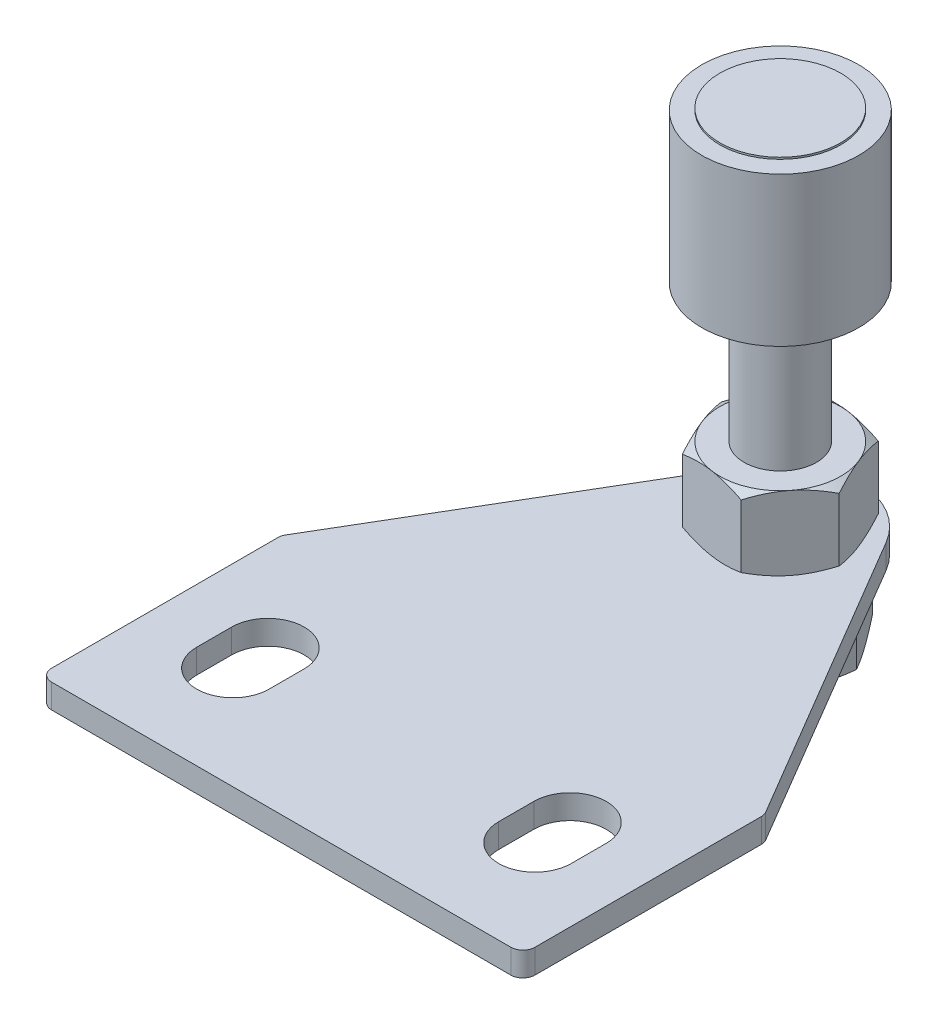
ISO-10303-21;
HEADER;
FILE_DESCRIPTION(('STEP AP214'),'2;1');
FILE_NAME('part.step','',(''),(''),'','','');
FILE_SCHEMA(('AUTOMOTIVE_DESIGN { 1 0 10303 214 1 1 1 1 }'));
ENDSEC;
DATA;
#1=APPLICATION_CONTEXT('core data for automotive mechanical design processes');
#2=APPLICATION_PROTOCOL_DEFINITION('international standard','automotive_design',2000,#1);
#3=PRODUCT_CONTEXT('',#1,'mechanical');
#4=PRODUCT('Part','Part','',(#3));
#5=PRODUCT_RELATED_PRODUCT_CATEGORY('part','',(#4));
#6=PRODUCT_DEFINITION_FORMATION('','',#4);
#7=PRODUCT_DEFINITION_CONTEXT('part definition',#1,'design');
#8=PRODUCT_DEFINITION('design','',#6,#7);
#9=PRODUCT_DEFINITION_SHAPE('','',#8);
#10=(LENGTH_UNIT() NAMED_UNIT(*) SI_UNIT(.MILLI.,.METRE.));
#11=(NAMED_UNIT(*) PLANE_ANGLE_UNIT() SI_UNIT($,.RADIAN.));
#12=(NAMED_UNIT(*) SI_UNIT($,.STERADIAN.) SOLID_ANGLE_UNIT());
#13=UNCERTAINTY_MEASURE_WITH_UNIT(LENGTH_MEASURE(1.E-05),#10,'distance_accuracy_value','');
#14=(GEOMETRIC_REPRESENTATION_CONTEXT(3) GLOBAL_UNCERTAINTY_ASSIGNED_CONTEXT((#13)) GLOBAL_UNIT_ASSIGNED_CONTEXT((#10,
#11,#12)) REPRESENTATION_CONTEXT('',''));
#15=CARTESIAN_POINT('',(0.,0.,0.));
#16=DIRECTION('',(0.,0.,1.));
#17=DIRECTION('',(1.,0.,0.));
#18=AXIS2_PLACEMENT_3D('',#15,#16,#17);
#19=CARTESIAN_POINT('',(0.,30.,-41.3));
#20=DIRECTION('',(0.,1.,0.));
#21=DIRECTION('',(0.606374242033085,0.,0.795179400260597));
#22=AXIS2_PLACEMENT_3D('',#19,#20,#21);
#23=PLANE('',#22);
#24=CARTESIAN_POINT('',(0.,30.,-41.3));
#25=DIRECTION('',(0.,1.,0.));
#26=DIRECTION('',(0.606374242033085,0.,0.795179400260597));
#27=AXIS2_PLACEMENT_3D('',#24,#25,#26);
#28=CIRCLE('',#27,5.);
#29=CARTESIAN_POINT('',(3.03187121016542,30.,-37.324102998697));
#30=VERTEX_POINT('',#29);
#31=EDGE_CURVE('P0_E25',#30,#30,#28,.T.);
#32=ORIENTED_EDGE('',*,*,#31,.T.);
#33=EDGE_LOOP('',(#32));
#34=FACE_BOUND('',#33,.T.);
#35=ADVANCED_FACE('P0_F14',(#34),#23,.T.);
#36=CARTESIAN_POINT('',(0.,30.,-41.3));
#37=DIRECTION('',(0.,1.,0.));
#38=DIRECTION('',(0.606374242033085,0.,0.795179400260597));
#39=AXIS2_PLACEMENT_3D('',#36,#37,#38);
#40=CYLINDRICAL_SURFACE('',#39,5.);
#41=CARTESIAN_POINT('',(0.,29.85,-41.3));
#42=DIRECTION('',(0.,1.,0.));
#43=DIRECTION('',(0.606374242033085,0.,0.795179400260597));
#44=AXIS2_PLACEMENT_3D('',#41,#42,#43);
#45=CIRCLE('',#44,5.);
#46=CARTESIAN_POINT('',(3.03187121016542,29.85,-37.324102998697));
#47=VERTEX_POINT('',#46);
#48=EDGE_CURVE('P0_E29',#47,#47,#45,.T.);
#49=ORIENTED_EDGE('',*,*,#48,.T.);
#50=EDGE_LOOP('',(#49));
#51=FACE_BOUND('',#50,.T.);
#52=ORIENTED_EDGE('',*,*,#31,.F.);
#53=EDGE_LOOP('',(#52));
#54=FACE_BOUND('',#53,.T.);
#55=ADVANCED_FACE('P0_F58',(#51,#54),#40,.T.);
#56=CARTESIAN_POINT('',(3.03187121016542,29.85,-37.324102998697));
#57=DIRECTION('',(0.,1.,0.));
#58=DIRECTION('',(0.606374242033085,0.,0.795179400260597));
#59=AXIS2_PLACEMENT_3D('',#56,#57,#58);
#60=PLANE('',#59);
#61=CARTESIAN_POINT('',(0.,29.85,-41.3));
#62=DIRECTION('',(0.,1.,0.));
#63=DIRECTION('',(0.606374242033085,0.,0.795179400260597));
#64=AXIS2_PLACEMENT_3D('',#61,#62,#63);
#65=CIRCLE('',#64,6.5);
#66=CARTESIAN_POINT('',(3.94143257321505,29.85,-36.1313338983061));
#67=VERTEX_POINT('',#66);
#68=EDGE_CURVE('P0_E34',#67,#67,#65,.T.);
#69=ORIENTED_EDGE('',*,*,#68,.T.);
#70=EDGE_LOOP('',(#69));
#71=FACE_BOUND('',#70,.T.);
#72=ORIENTED_EDGE('',*,*,#48,.F.);
#73=EDGE_LOOP('',(#72));
#74=FACE_BOUND('',#73,.T.);
#75=ADVANCED_FACE('P0_F63',(#71,#74),#60,.T.);
#76=CARTESIAN_POINT('',(0.,30.,-41.3));
#77=DIRECTION('',(0.,1.,0.));
#78=DIRECTION('',(0.606374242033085,0.,0.795179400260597));
#79=AXIS2_PLACEMENT_3D('',#76,#77,#78);
#80=CYLINDRICAL_SURFACE('',#79,6.5);
#81=CARTESIAN_POINT('',(0.,17.5,-41.3));
#82=DIRECTION('',(0.,1.,0.));
#83=DIRECTION('',(0.606374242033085,0.,0.795179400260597));
#84=AXIS2_PLACEMENT_3D('',#81,#82,#83);
#85=CIRCLE('',#84,6.5);
#86=CARTESIAN_POINT('',(3.94143257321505,17.5,-36.1313338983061));
#87=VERTEX_POINT('',#86);
#88=EDGE_CURVE('P0_E37',#87,#87,#85,.T.);
#89=ORIENTED_EDGE('',*,*,#88,.T.);
#90=EDGE_LOOP('',(#89));
#91=FACE_BOUND('',#90,.T.);
#92=ORIENTED_EDGE('',*,*,#68,.F.);
#93=EDGE_LOOP('',(#92));
#94=FACE_BOUND('',#93,.T.);
#95=ADVANCED_FACE('P0_F69',(#91,#94),#80,.T.);
#96=CARTESIAN_POINT('',(3.94143257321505,17.5,-36.1313338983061));
#97=DIRECTION('',(0.,-1.,0.));
#98=DIRECTION('',(-0.606374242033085,0.,-0.795179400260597));
#99=AXIS2_PLACEMENT_3D('',#96,#97,#98);
#100=PLANE('',#99);
#101=CARTESIAN_POINT('',(0.,17.5,-41.3));
#102=DIRECTION('',(0.,-1.,0.));
#103=DIRECTION('',(-0.606374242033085,0.,-0.795179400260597));
#104=AXIS2_PLACEMENT_3D('',#101,#102,#103);
#105=CIRCLE('',#104,3.5);
#106=CARTESIAN_POINT('',(-2.1223098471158,17.5,-44.0831279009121));
#107=VERTEX_POINT('',#106);
#108=EDGE_CURVE('P0_E21',#107,#107,#105,.F.);
#109=ORIENTED_EDGE('',*,*,#108,.T.);
#110=EDGE_LOOP('',(#109));
#111=FACE_BOUND('',#110,.T.);
#112=ORIENTED_EDGE('',*,*,#88,.F.);
#113=EDGE_LOOP('',(#112));
#114=FACE_BOUND('',#113,.T.);
#115=ADVANCED_FACE('P0_F55',(#111,#114),#100,.T.);
#116=CARTESIAN_POINT('',(0.,30.,-41.3));
#117=DIRECTION('',(0.,1.,0.));
#118=DIRECTION('',(0.606374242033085,0.,0.795179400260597));
#119=AXIS2_PLACEMENT_3D('',#116,#117,#118);
#120=CYLINDRICAL_SURFACE('',#119,3.);
#121=CARTESIAN_POINT('',(0.,17.,-41.3));
#122=DIRECTION('',(0.,-1.,0.));
#123=DIRECTION('',(-0.606374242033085,0.,-0.795179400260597));
#124=AXIS2_PLACEMENT_3D('',#121,#122,#123);
#125=CIRCLE('',#124,3.);
#126=CARTESIAN_POINT('',(-1.81912272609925,17.,-43.6855382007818));
#127=VERTEX_POINT('',#126);
#128=EDGE_CURVE('P0_E10',#127,#127,#125,.T.);
#129=ORIENTED_EDGE('',*,*,#128,.T.);
#130=EDGE_LOOP('',(#129));
#131=FACE_BOUND('',#130,.T.);
#132=CARTESIAN_POINT('',(0.,-7.2,-41.3));
#133=DIRECTION('',(0.,1.,0.));
#134=DIRECTION('',(0.606374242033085,0.,0.795179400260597));
#135=AXIS2_PLACEMENT_3D('',#132,#133,#134);
#136=CIRCLE('',#135,3.);
#137=CARTESIAN_POINT('',(1.81912272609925,-7.2,-38.9144617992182));
#138=VERTEX_POINT('',#137);
#139=EDGE_CURVE('P0_E40',#138,#138,#136,.T.);
#140=ORIENTED_EDGE('',*,*,#139,.T.);
#141=EDGE_LOOP('',(#140));
#142=FACE_BOUND('',#141,.T.);
#143=ADVANCED_FACE('P0_F44',(#131,#142),#120,.T.);
#144=CARTESIAN_POINT('',(1.81912272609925,-7.2,-38.9144617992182));
#145=DIRECTION('',(0.,-1.,0.));
#146=DIRECTION('',(-0.606374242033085,0.,-0.795179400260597));
#147=AXIS2_PLACEMENT_3D('',#144,#145,#146);
#148=PLANE('',#147);
#149=ORIENTED_EDGE('',*,*,#139,.F.);
#150=EDGE_LOOP('',(#149));
#151=FACE_BOUND('',#150,.T.);
#152=ADVANCED_FACE('P0_F46',(#151),#148,.T.);
#153=CARTESIAN_POINT('',(0.,17.,-41.3));
#154=DIRECTION('',(0.,-1.,0.));
#155=DIRECTION('',(-0.606374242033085,0.,-0.795179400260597));
#156=AXIS2_PLACEMENT_3D('',#153,#154,#155);
#157=TOROIDAL_SURFACE('',#156,3.5,0.5);
#158=ORIENTED_EDGE('',*,*,#128,.F.);
#159=EDGE_LOOP('',(#158));
#160=FACE_BOUND('',#159,.T.);
#161=ORIENTED_EDGE('',*,*,#108,.F.);
#162=EDGE_LOOP('',(#161));
#163=FACE_BOUND('',#162,.T.);
#164=ADVANCED_FACE('P0_F16',(#160,#163),#157,.F.);
#165=CLOSED_SHELL('',(#35,#55,#75,#95,#115,#143,#152,#164));
#166=MANIFOLD_SOLID_BREP('P0_B1',#165);
#167=CARTESIAN_POINT('',(20.,-2.,0.));
#168=DIRECTION('',(1.,0.,0.));
#169=DIRECTION('',(0.,0.,-1.));
#170=AXIS2_PLACEMENT_3D('',#167,#168,#169);
#171=PLANE('',#170);
#172=DIRECTION('',(0.,0.,-1.));
#173=VECTOR('',#172,1.);
#174=CARTESIAN_POINT('',(20.,-2.,0.));
#175=LINE('',#174,#173);
#176=CARTESIAN_POINT('',(20.,-2.,-1.));
#177=VERTEX_POINT('',#176);
#178=CARTESIAN_POINT('',(20.,-2.,-19.7269537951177));
#179=VERTEX_POINT('',#178);
#180=EDGE_CURVE('P1_E247',#177,#179,#175,.T.);
#181=ORIENTED_EDGE('',*,*,#180,.T.);
#182=DIRECTION('',(0.,1.,0.));
#183=VECTOR('',#182,1.);
#184=CARTESIAN_POINT('',(20.,-2.,-19.7269537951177));
#185=LINE('',#184,#183);
#186=CARTESIAN_POINT('',(20.,0.,-19.7269537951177));
#187=VERTEX_POINT('',#186);
#188=EDGE_CURVE('P1_E302',#179,#187,#185,.T.);
#189=ORIENTED_EDGE('',*,*,#188,.T.);
#190=DIRECTION('',(0.,0.,-1.));
#191=VECTOR('',#190,1.);
#192=CARTESIAN_POINT('',(20.,0.,0.));
#193=LINE('',#192,#191);
#194=CARTESIAN_POINT('',(20.,0.,-1.));
#195=VERTEX_POINT('',#194);
#196=EDGE_CURVE('P1_E270',#195,#187,#193,.T.);
#197=ORIENTED_EDGE('',*,*,#196,.F.);
#198=DIRECTION('',(0.,1.,0.));
#199=VECTOR('',#198,1.);
#200=CARTESIAN_POINT('',(20.,-2.,-1.));
#201=LINE('',#200,#199);
#202=EDGE_CURVE('P1_E296',#195,#177,#201,.F.);
#203=ORIENTED_EDGE('',*,*,#202,.T.);
#204=EDGE_LOOP('',(#181,#189,#197,#203));
#205=FACE_BOUND('',#204,.T.);
#206=ADVANCED_FACE('P1_F16',(#205),#171,.T.);
#207=CARTESIAN_POINT('',(-20.,-2.,0.));
#208=DIRECTION('',(0.,0.,1.));
#209=DIRECTION('',(1.,0.,0.));
#210=AXIS2_PLACEMENT_3D('',#207,#208,#209);
#211=PLANE('',#210);
#212=DIRECTION('',(1.,0.,0.));
#213=VECTOR('',#212,1.);
#214=CARTESIAN_POINT('',(-20.,-2.,0.));
#215=LINE('',#214,#213);
#216=CARTESIAN_POINT('',(-19.,-2.,0.));
#217=VERTEX_POINT('',#216);
#218=CARTESIAN_POINT('',(19.,-2.,0.));
#219=VERTEX_POINT('',#218);
#220=EDGE_CURVE('P1_E265',#217,#219,#215,.T.);
#221=ORIENTED_EDGE('',*,*,#220,.T.);
#222=DIRECTION('',(0.,1.,0.));
#223=VECTOR('',#222,1.);
#224=CARTESIAN_POINT('',(19.,-2.,0.));
#225=LINE('',#224,#223);
#226=CARTESIAN_POINT('',(19.,0.,0.));
#227=VERTEX_POINT('',#226);
#228=EDGE_CURVE('P1_E11',#219,#227,#225,.T.);
#229=ORIENTED_EDGE('',*,*,#228,.T.);
#230=DIRECTION('',(1.,0.,0.));
#231=VECTOR('',#230,1.);
#232=CARTESIAN_POINT('',(-20.,0.,0.));
#233=LINE('',#232,#231);
#234=CARTESIAN_POINT('',(-19.,0.,0.));
#235=VERTEX_POINT('',#234);
#236=EDGE_CURVE('P1_E252',#235,#227,#233,.T.);
#237=ORIENTED_EDGE('',*,*,#236,.F.);
#238=DIRECTION('',(0.,1.,0.));
#239=VECTOR('',#238,1.);
#240=CARTESIAN_POINT('',(-19.,-2.,0.));
#241=LINE('',#240,#239);
#242=EDGE_CURVE('P1_E25',#235,#217,#241,.F.);
#243=ORIENTED_EDGE('',*,*,#242,.T.);
#244=EDGE_LOOP('',(#221,#229,#237,#243));
#245=FACE_BOUND('',#244,.T.);
#246=ADVANCED_FACE('P1_F345',(#245),#211,.T.);
#247=CARTESIAN_POINT('',(-20.,-2.,0.));
#248=DIRECTION('',(-1.,0.,0.));
#249=DIRECTION('',(0.,0.,1.));
#250=AXIS2_PLACEMENT_3D('',#247,#248,#249);
#251=PLANE('',#250);
#252=DIRECTION('',(0.,0.,1.));
#253=VECTOR('',#252,1.);
#254=CARTESIAN_POINT('',(-20.,0.,0.));
#255=LINE('',#254,#253);
#256=CARTESIAN_POINT('',(-20.,0.,-19.7269537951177));
#257=VERTEX_POINT('',#256);
#258=CARTESIAN_POINT('',(-20.,0.,-1.));
#259=VERTEX_POINT('',#258);
#260=EDGE_CURVE('P1_E286',#257,#259,#255,.T.);
#261=ORIENTED_EDGE('',*,*,#260,.F.);
#262=DIRECTION('',(0.,1.,0.));
#263=VECTOR('',#262,1.);
#264=CARTESIAN_POINT('',(-20.,-2.,-19.7269537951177));
#265=LINE('',#264,#263);
#266=CARTESIAN_POINT('',(-20.,-2.,-19.7269537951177));
#267=VERTEX_POINT('',#266);
#268=EDGE_CURVE('P1_E339',#257,#267,#265,.F.);
#269=ORIENTED_EDGE('',*,*,#268,.T.);
#270=DIRECTION('',(0.,0.,1.));
#271=VECTOR('',#270,1.);
#272=CARTESIAN_POINT('',(-20.,-2.,0.));
#273=LINE('',#272,#271);
#274=CARTESIAN_POINT('',(-20.,-2.,-1.));
#275=VERTEX_POINT('',#274);
#276=EDGE_CURVE('P1_E262',#267,#275,#273,.T.);
#277=ORIENTED_EDGE('',*,*,#276,.T.);
#278=DIRECTION('',(0.,1.,0.));
#279=VECTOR('',#278,1.);
#280=CARTESIAN_POINT('',(-20.,-2.,-1.));
#281=LINE('',#280,#279);
#282=EDGE_CURVE('P1_E335',#275,#259,#281,.T.);
#283=ORIENTED_EDGE('',*,*,#282,.T.);
#284=EDGE_LOOP('',(#261,#269,#277,#283));
#285=FACE_BOUND('',#284,.T.);
#286=ADVANCED_FACE('P1_F354',(#285),#251,.T.);
#287=CARTESIAN_POINT('',(-5.51191625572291,-2.,-44.5525035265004));
#288=DIRECTION('',(-0.861236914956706,0.,-0.508203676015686));
#289=DIRECTION('',(-0.508203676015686,0.,0.861236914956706));
#290=AXIS2_PLACEMENT_3D('',#287,#288,#289);
#291=PLANE('',#290);
#292=DIRECTION('',(-0.508203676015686,0.,0.861236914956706));
#293=VECTOR('',#292,1.);
#294=CARTESIAN_POINT('',(-5.51191625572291,-2.,-44.5525035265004));
#295=LINE('',#294,#293);
#296=CARTESIAN_POINT('',(-5.51191625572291,-2.,-44.5525035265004));
#297=VERTEX_POINT('',#296);
#298=CARTESIAN_POINT('',(-19.8612369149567,-2.,-20.2351574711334));
#299=VERTEX_POINT('',#298);
#300=EDGE_CURVE('P1_E259',#297,#299,#295,.T.);
#301=ORIENTED_EDGE('',*,*,#300,.T.);
#302=DIRECTION('',(0.,1.,0.));
#303=VECTOR('',#302,1.);
#304=CARTESIAN_POINT('',(-19.8612369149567,-2.,-20.2351574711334));
#305=LINE('',#304,#303);
#306=CARTESIAN_POINT('',(-19.8612369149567,0.,-20.2351574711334));
#307=VERTEX_POINT('',#306);
#308=EDGE_CURVE('P1_E331',#299,#307,#305,.T.);
#309=ORIENTED_EDGE('',*,*,#308,.T.);
#310=DIRECTION('',(-0.508203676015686,0.,0.861236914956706));
#311=VECTOR('',#310,1.);
#312=CARTESIAN_POINT('',(-5.51191625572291,0.,-44.5525035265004));
#313=LINE('',#312,#311);
#314=CARTESIAN_POINT('',(-5.51191625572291,0.,-44.5525035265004));
#315=VERTEX_POINT('',#314);
#316=EDGE_CURVE('P1_E282',#315,#307,#313,.T.);
#317=ORIENTED_EDGE('',*,*,#316,.F.);
#318=DIRECTION('',(0.,1.,0.));
#319=VECTOR('',#318,1.);
#320=CARTESIAN_POINT('',(-5.51191625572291,-2.,-44.5525035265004));
#321=LINE('',#320,#319);
#322=EDGE_CURVE('P1_E293',#297,#315,#321,.T.);
#323=ORIENTED_EDGE('',*,*,#322,.F.);
#324=EDGE_LOOP('',(#301,#309,#317,#323));
#325=FACE_BOUND('',#324,.T.);
#326=ADVANCED_FACE('P1_F363',(#325),#291,.T.);
#327=CARTESIAN_POINT('',(0.,-2.,-41.3));
#328=DIRECTION('',(0.,1.,0.));
#329=DIRECTION('',(0.,0.,1.));
#330=AXIS2_PLACEMENT_3D('',#327,#328,#329);
#331=CYLINDRICAL_SURFACE('',#330,6.4);
#332=CARTESIAN_POINT('',(0.,0.,-41.3));
#333=DIRECTION('',(0.,1.,0.));
#334=DIRECTION('',(0.,0.,1.));
#335=AXIS2_PLACEMENT_3D('',#332,#333,#334);
#336=CIRCLE('',#335,6.4);
#337=CARTESIAN_POINT('',(5.51191625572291,0.,-44.5525035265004));
#338=VERTEX_POINT('',#337);
#339=EDGE_CURVE('P1_E278',#338,#315,#336,.T.);
#340=ORIENTED_EDGE('',*,*,#339,.F.);
#341=DIRECTION('',(0.,1.,0.));
#342=VECTOR('',#341,1.);
#343=CARTESIAN_POINT('',(5.51191625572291,-2.,-44.5525035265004));
#344=LINE('',#343,#342);
#345=CARTESIAN_POINT('',(5.51191625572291,-2.,-44.5525035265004));
#346=VERTEX_POINT('',#345);
#347=EDGE_CURVE('P1_E269',#346,#338,#344,.T.);
#348=ORIENTED_EDGE('',*,*,#347,.F.);
#349=CARTESIAN_POINT('',(0.,-2.,-41.3));
#350=DIRECTION('',(0.,1.,0.));
#351=DIRECTION('',(0.,0.,1.));
#352=AXIS2_PLACEMENT_3D('',#349,#350,#351);
#353=CIRCLE('',#352,6.4);
#354=EDGE_CURVE('P1_E255',#346,#297,#353,.T.);
#355=ORIENTED_EDGE('',*,*,#354,.T.);
#356=ORIENTED_EDGE('',*,*,#322,.T.);
#357=EDGE_LOOP('',(#340,#348,#355,#356));
#358=FACE_BOUND('',#357,.T.);
#359=ADVANCED_FACE('P1_F368',(#358),#331,.T.);
#360=CARTESIAN_POINT('',(5.51191625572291,-2.,-44.5525035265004));
#361=DIRECTION('',(0.861236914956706,0.,-0.508203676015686));
#362=DIRECTION('',(-0.508203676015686,0.,-0.861236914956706));
#363=AXIS2_PLACEMENT_3D('',#360,#361,#362);
#364=PLANE('',#363);
#365=DIRECTION('',(-0.508203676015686,0.,-0.861236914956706));
#366=VECTOR('',#365,1.);
#367=CARTESIAN_POINT('',(5.51191625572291,0.,-44.5525035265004));
#368=LINE('',#367,#366);
#369=CARTESIAN_POINT('',(19.8612369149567,0.,-20.2351574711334));
#370=VERTEX_POINT('',#369);
#371=EDGE_CURVE('P1_E274',#370,#338,#368,.T.);
#372=ORIENTED_EDGE('',*,*,#371,.F.);
#373=DIRECTION('',(0.,1.,0.));
#374=VECTOR('',#373,1.);
#375=CARTESIAN_POINT('',(19.8612369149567,-2.,-20.2351574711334));
#376=LINE('',#375,#374);
#377=CARTESIAN_POINT('',(19.8612369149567,-2.,-20.2351574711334));
#378=VERTEX_POINT('',#377);
#379=EDGE_CURVE('P1_E318',#370,#378,#376,.F.);
#380=ORIENTED_EDGE('',*,*,#379,.T.);
#381=DIRECTION('',(-0.508203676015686,0.,-0.861236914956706));
#382=VECTOR('',#381,1.);
#383=CARTESIAN_POINT('',(5.51191625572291,-2.,-44.5525035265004));
#384=LINE('',#383,#382);
#385=EDGE_CURVE('P1_E251',#378,#346,#384,.T.);
#386=ORIENTED_EDGE('',*,*,#385,.T.);
#387=ORIENTED_EDGE('',*,*,#347,.T.);
#388=EDGE_LOOP('',(#372,#380,#386,#387));
#389=FACE_BOUND('',#388,.T.);
#390=ADVANCED_FACE('P1_F371',(#389),#364,.T.);
#391=CARTESIAN_POINT('',(0.,-2.,-41.3));
#392=DIRECTION('',(0.,1.,0.));
#393=DIRECTION('',(0.,0.,1.));
#394=AXIS2_PLACEMENT_3D('',#391,#392,#393);
#395=PLANE('',#394);
#396=CARTESIAN_POINT('',(0.,-2.,-41.3));
#397=DIRECTION('',(0.,1.,0.));
#398=DIRECTION('',(0.,0.,1.));
#399=AXIS2_PLACEMENT_3D('',#396,#397,#398);
#400=CIRCLE('',#399,3.2);
#401=CARTESIAN_POINT('',(0.,-2.,-38.1));
#402=VERTEX_POINT('',#401);
#403=EDGE_CURVE('P1_E275',#402,#402,#400,.T.);
#404=ORIENTED_EDGE('',*,*,#403,.T.);
#405=EDGE_LOOP('',(#404));
#406=FACE_BOUND('',#405,.T.);
#407=DIRECTION('',(0.,0.,1.));
#408=VECTOR('',#407,1.);
#409=CARTESIAN_POINT('',(9.5,-2.,-8.5));
#410=LINE('',#409,#408);
#411=CARTESIAN_POINT('',(9.5,-2.,-11.4));
#412=VERTEX_POINT('',#411);
#413=CARTESIAN_POINT('',(9.5,-2.,-8.5));
#414=VERTEX_POINT('',#413);
#415=EDGE_CURVE('P1_E157',#412,#414,#410,.T.);
#416=ORIENTED_EDGE('',*,*,#415,.T.);
#417=CARTESIAN_POINT('',(12.5,-2.,-8.5));
#418=DIRECTION('',(0.,1.,0.));
#419=DIRECTION('',(0.,0.,1.));
#420=AXIS2_PLACEMENT_3D('',#417,#418,#419);
#421=CIRCLE('',#420,3.);
#422=CARTESIAN_POINT('',(15.5,-2.,-8.5));
#423=VERTEX_POINT('',#422);
#424=EDGE_CURVE('P1_E148',#414,#423,#421,.T.);
#425=ORIENTED_EDGE('',*,*,#424,.T.);
#426=DIRECTION('',(0.,0.,-1.));
#427=VECTOR('',#426,1.);
#428=CARTESIAN_POINT('',(15.5,-2.,-8.5));
#429=LINE('',#428,#427);
#430=CARTESIAN_POINT('',(15.5,-2.,-11.4));
#431=VERTEX_POINT('',#430);
#432=EDGE_CURVE('P1_E161',#423,#431,#429,.T.);
#433=ORIENTED_EDGE('',*,*,#432,.T.);
#434=CARTESIAN_POINT('',(12.5,-2.,-11.4));
#435=DIRECTION('',(0.,1.,0.));
#436=DIRECTION('',(0.,0.,1.));
#437=AXIS2_PLACEMENT_3D('',#434,#435,#436);
#438=CIRCLE('',#437,3.);
#439=EDGE_CURVE('P1_E166',#431,#412,#438,.T.);
#440=ORIENTED_EDGE('',*,*,#439,.T.);
#441=EDGE_LOOP('',(#416,#425,#433,#440));
#442=FACE_BOUND('',#441,.T.);
#443=DIRECTION('',(0.,0.,1.));
#444=VECTOR('',#443,1.);
#445=CARTESIAN_POINT('',(-15.5,-2.,-8.5));
#446=LINE('',#445,#444);
#447=CARTESIAN_POINT('',(-15.5,-2.,-11.4));
#448=VERTEX_POINT('',#447);
#449=CARTESIAN_POINT('',(-15.5,-2.,-8.5));
#450=VERTEX_POINT('',#449);
#451=EDGE_CURVE('P1_E217',#448,#450,#446,.T.);
#452=ORIENTED_EDGE('',*,*,#451,.T.);
#453=CARTESIAN_POINT('',(-12.5,-2.,-8.5));
#454=DIRECTION('',(0.,1.,0.));
#455=DIRECTION('',(0.,0.,-1.));
#456=AXIS2_PLACEMENT_3D('',#453,#454,#455);
#457=CIRCLE('',#456,3.);
#458=CARTESIAN_POINT('',(-9.5,-2.,-8.5));
#459=VERTEX_POINT('',#458);
#460=EDGE_CURVE('P1_E204',#450,#459,#457,.T.);
#461=ORIENTED_EDGE('',*,*,#460,.T.);
#462=DIRECTION('',(0.,0.,-1.));
#463=VECTOR('',#462,1.);
#464=CARTESIAN_POINT('',(-9.5,-2.,-8.5));
#465=LINE('',#464,#463);
#466=CARTESIAN_POINT('',(-9.5,-2.,-11.4));
#467=VERTEX_POINT('',#466);
#468=EDGE_CURVE('P1_E208',#459,#467,#465,.T.);
#469=ORIENTED_EDGE('',*,*,#468,.T.);
#470=CARTESIAN_POINT('',(-12.5,-2.,-11.4));
#471=DIRECTION('',(0.,1.,0.));
#472=DIRECTION('',(0.,0.,-1.));
#473=AXIS2_PLACEMENT_3D('',#470,#471,#472);
#474=CIRCLE('',#473,3.);
#475=EDGE_CURVE('P1_E213',#467,#448,#474,.T.);
#476=ORIENTED_EDGE('',*,*,#475,.T.);
#477=EDGE_LOOP('',(#452,#461,#469,#476));
#478=FACE_BOUND('',#477,.T.);
#479=ORIENTED_EDGE('',*,*,#385,.F.);
#480=CARTESIAN_POINT('',(19.,-2.,-19.7269537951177));
#481=DIRECTION('',(0.,1.,0.));
#482=DIRECTION('',(0.,0.,1.));
#483=AXIS2_PLACEMENT_3D('',#480,#481,#482);
#484=CIRCLE('',#483,1.);
#485=EDGE_CURVE('P1_E328',#378,#179,#484,.F.);
#486=ORIENTED_EDGE('',*,*,#485,.T.);
#487=ORIENTED_EDGE('',*,*,#180,.F.);
#488=CARTESIAN_POINT('',(19.,-2.,-1.));
#489=DIRECTION('',(0.,1.,0.));
#490=DIRECTION('',(0.,0.,1.));
#491=AXIS2_PLACEMENT_3D('',#488,#489,#490);
#492=CIRCLE('',#491,1.);
#493=EDGE_CURVE('P1_E323',#177,#219,#492,.F.);
#494=ORIENTED_EDGE('',*,*,#493,.T.);
#495=ORIENTED_EDGE('',*,*,#220,.F.);
#496=CARTESIAN_POINT('',(-19.,-2.,-1.));
#497=DIRECTION('',(0.,1.,0.));
#498=DIRECTION('',(0.,0.,1.));
#499=AXIS2_PLACEMENT_3D('',#496,#497,#498);
#500=CIRCLE('',#499,1.);
#501=EDGE_CURVE('P1_E38',#217,#275,#500,.F.);
#502=ORIENTED_EDGE('',*,*,#501,.T.);
#503=ORIENTED_EDGE('',*,*,#276,.F.);
#504=CARTESIAN_POINT('',(-19.,-2.,-19.7269537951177));
#505=DIRECTION('',(0.,1.,0.));
#506=DIRECTION('',(0.,0.,1.));
#507=AXIS2_PLACEMENT_3D('',#504,#505,#506);
#508=CIRCLE('',#507,1.);
#509=EDGE_CURVE('P1_E32',#267,#299,#508,.F.);
#510=ORIENTED_EDGE('',*,*,#509,.T.);
#511=ORIENTED_EDGE('',*,*,#300,.F.);
#512=ORIENTED_EDGE('',*,*,#354,.F.);
#513=EDGE_LOOP('',(#479,#486,#487,#494,#495,#502,#503,#510,#511,#512));
#514=FACE_BOUND('',#513,.T.);
#515=ADVANCED_FACE('P1_F168',(#406,#442,#478,#514),#395,.F.);
#516=CARTESIAN_POINT('',(0.,0.,-41.3));
#517=DIRECTION('',(0.,1.,0.));
#518=DIRECTION('',(0.,0.,1.));
#519=AXIS2_PLACEMENT_3D('',#516,#517,#518);
#520=PLANE('',#519);
#521=CARTESIAN_POINT('',(0.,0.,-41.3));
#522=DIRECTION('',(0.,1.,0.));
#523=DIRECTION('',(0.,0.,1.));
#524=AXIS2_PLACEMENT_3D('',#521,#522,#523);
#525=CIRCLE('',#524,3.2);
#526=CARTESIAN_POINT('',(0.,0.,-38.1));
#527=VERTEX_POINT('',#526);
#528=EDGE_CURVE('P1_E180',#527,#527,#525,.T.);
#529=ORIENTED_EDGE('',*,*,#528,.F.);
#530=EDGE_LOOP('',(#529));
#531=FACE_BOUND('',#530,.T.);
#532=CARTESIAN_POINT('',(12.5,0.,-8.5));
#533=DIRECTION('',(0.,1.,0.));
#534=DIRECTION('',(0.,0.,1.));
#535=AXIS2_PLACEMENT_3D('',#532,#533,#534);
#536=CIRCLE('',#535,3.);
#537=CARTESIAN_POINT('',(9.5,0.,-8.5));
#538=VERTEX_POINT('',#537);
#539=CARTESIAN_POINT('',(15.5,0.,-8.50000000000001));
#540=VERTEX_POINT('',#539);
#541=EDGE_CURVE('P1_E151',#538,#540,#536,.T.);
#542=ORIENTED_EDGE('',*,*,#541,.F.);
#543=DIRECTION('',(0.,0.,1.));
#544=VECTOR('',#543,1.);
#545=CARTESIAN_POINT('',(9.5,0.,-8.5));
#546=LINE('',#545,#544);
#547=CARTESIAN_POINT('',(9.5,0.,-11.4));
#548=VERTEX_POINT('',#547);
#549=EDGE_CURVE('P1_E172',#548,#538,#546,.T.);
#550=ORIENTED_EDGE('',*,*,#549,.F.);
#551=CARTESIAN_POINT('',(12.5,0.,-11.4));
#552=DIRECTION('',(0.,1.,0.));
#553=DIRECTION('',(0.,0.,1.));
#554=AXIS2_PLACEMENT_3D('',#551,#552,#553);
#555=CIRCLE('',#554,3.);
#556=CARTESIAN_POINT('',(15.5,0.,-11.4));
#557=VERTEX_POINT('',#556);
#558=EDGE_CURVE('P1_E177',#557,#548,#555,.T.);
#559=ORIENTED_EDGE('',*,*,#558,.F.);
#560=DIRECTION('',(0.,0.,-1.));
#561=VECTOR('',#560,1.);
#562=CARTESIAN_POINT('',(15.5,0.,-8.5));
#563=LINE('',#562,#561);
#564=EDGE_CURVE('P1_E189',#540,#557,#563,.T.);
#565=ORIENTED_EDGE('',*,*,#564,.F.);
#566=EDGE_LOOP('',(#542,#550,#559,#565));
#567=FACE_BOUND('',#566,.T.);
#568=CARTESIAN_POINT('',(-12.5,0.,-8.5));
#569=DIRECTION('',(0.,1.,0.));
#570=DIRECTION('',(0.,0.,-1.));
#571=AXIS2_PLACEMENT_3D('',#568,#569,#570);
#572=CIRCLE('',#571,3.);
#573=CARTESIAN_POINT('',(-15.5,0.,-8.5));
#574=VERTEX_POINT('',#573);
#575=CARTESIAN_POINT('',(-9.5,0.,-8.50000000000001));
#576=VERTEX_POINT('',#575);
#577=EDGE_CURVE('P1_E222',#574,#576,#572,.T.);
#578=ORIENTED_EDGE('',*,*,#577,.F.);
#579=DIRECTION('',(0.,0.,1.));
#580=VECTOR('',#579,1.);
#581=CARTESIAN_POINT('',(-15.5,0.,-8.5));
#582=LINE('',#581,#580);
#583=CARTESIAN_POINT('',(-15.5,0.,-11.4));
#584=VERTEX_POINT('',#583);
#585=EDGE_CURVE('P1_E209',#584,#574,#582,.T.);
#586=ORIENTED_EDGE('',*,*,#585,.F.);
#587=CARTESIAN_POINT('',(-12.5,0.,-11.4));
#588=DIRECTION('',(0.,1.,0.));
#589=DIRECTION('',(0.,0.,-1.));
#590=AXIS2_PLACEMENT_3D('',#587,#588,#589);
#591=CIRCLE('',#590,3.);
#592=CARTESIAN_POINT('',(-9.5,0.,-11.4));
#593=VERTEX_POINT('',#592);
#594=EDGE_CURVE('P1_E229',#593,#584,#591,.T.);
#595=ORIENTED_EDGE('',*,*,#594,.F.);
#596=DIRECTION('',(0.,0.,-1.));
#597=VECTOR('',#596,1.);
#598=CARTESIAN_POINT('',(-9.5,0.,-8.5));
#599=LINE('',#598,#597);
#600=EDGE_CURVE('P1_E225',#576,#593,#599,.T.);
#601=ORIENTED_EDGE('',*,*,#600,.F.);
#602=EDGE_LOOP('',(#578,#586,#595,#601));
#603=FACE_BOUND('',#602,.T.);
#604=ORIENTED_EDGE('',*,*,#196,.T.);
#605=CARTESIAN_POINT('',(19.,0.,-19.7269537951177));
#606=DIRECTION('',(0.,1.,0.));
#607=DIRECTION('',(0.,0.,1.));
#608=AXIS2_PLACEMENT_3D('',#605,#606,#607);
#609=CIRCLE('',#608,1.);
#610=EDGE_CURVE('P1_E315',#187,#370,#609,.T.);
#611=ORIENTED_EDGE('',*,*,#610,.T.);
#612=ORIENTED_EDGE('',*,*,#371,.T.);
#613=ORIENTED_EDGE('',*,*,#339,.T.);
#614=ORIENTED_EDGE('',*,*,#316,.T.);
#615=CARTESIAN_POINT('',(-19.,0.,-19.7269537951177));
#616=DIRECTION('',(0.,1.,0.));
#617=DIRECTION('',(0.,0.,1.));
#618=AXIS2_PLACEMENT_3D('',#615,#616,#617);
#619=CIRCLE('',#618,1.);
#620=EDGE_CURVE('P1_E312',#307,#257,#619,.T.);
#621=ORIENTED_EDGE('',*,*,#620,.T.);
#622=ORIENTED_EDGE('',*,*,#260,.T.);
#623=CARTESIAN_POINT('',(-19.,0.,-1.));
#624=DIRECTION('',(0.,1.,0.));
#625=DIRECTION('',(0.,0.,1.));
#626=AXIS2_PLACEMENT_3D('',#623,#624,#625);
#627=CIRCLE('',#626,1.);
#628=EDGE_CURVE('P1_E306',#259,#235,#627,.T.);
#629=ORIENTED_EDGE('',*,*,#628,.T.);
#630=ORIENTED_EDGE('',*,*,#236,.T.);
#631=CARTESIAN_POINT('',(19.,0.,-1.));
#632=DIRECTION('',(0.,1.,0.));
#633=DIRECTION('',(0.,0.,1.));
#634=AXIS2_PLACEMENT_3D('',#631,#632,#633);
#635=CIRCLE('',#634,1.);
#636=EDGE_CURVE('P1_E309',#227,#195,#635,.T.);
#637=ORIENTED_EDGE('',*,*,#636,.T.);
#638=EDGE_LOOP('',(#604,#611,#612,#613,#614,#621,#622,#629,#630,#637));
#639=FACE_BOUND('',#638,.T.);
#640=ADVANCED_FACE('P1_F357',(#531,#567,#603,#639),#520,.T.);
#641=CARTESIAN_POINT('',(-12.5,-2.,-8.5));
#642=DIRECTION('',(0.,1.,0.));
#643=DIRECTION('',(0.,0.,1.));
#644=AXIS2_PLACEMENT_3D('',#641,#642,#643);
#645=CYLINDRICAL_SURFACE('',#644,3.);
#646=ORIENTED_EDGE('',*,*,#577,.T.);
#647=DIRECTION('',(0.,1.,0.));
#648=VECTOR('',#647,1.);
#649=CARTESIAN_POINT('',(-9.5,-2.,-8.5));
#650=LINE('',#649,#648);
#651=EDGE_CURVE('P1_E221',#459,#576,#650,.T.);
#652=ORIENTED_EDGE('',*,*,#651,.F.);
#653=ORIENTED_EDGE('',*,*,#460,.F.);
#654=DIRECTION('',(0.,1.,0.));
#655=VECTOR('',#654,1.);
#656=CARTESIAN_POINT('',(-15.5,-2.,-8.5));
#657=LINE('',#656,#655);
#658=EDGE_CURVE('P1_E190',#450,#574,#657,.T.);
#659=ORIENTED_EDGE('',*,*,#658,.T.);
#660=EDGE_LOOP('',(#646,#652,#653,#659));
#661=FACE_BOUND('',#660,.T.);
#662=ADVANCED_FACE('P1_F427',(#661),#645,.F.);
#663=CARTESIAN_POINT('',(-15.5,-2.,-8.5));
#664=DIRECTION('',(-1.,0.,0.));
#665=DIRECTION('',(0.,0.,1.));
#666=AXIS2_PLACEMENT_3D('',#663,#664,#665);
#667=PLANE('',#666);
#668=ORIENTED_EDGE('',*,*,#585,.T.);
#669=ORIENTED_EDGE('',*,*,#658,.F.);
#670=ORIENTED_EDGE('',*,*,#451,.F.);
#671=DIRECTION('',(0.,1.,0.));
#672=VECTOR('',#671,1.);
#673=CARTESIAN_POINT('',(-15.5,-2.,-11.4));
#674=LINE('',#673,#672);
#675=EDGE_CURVE('P1_E238',#448,#584,#674,.T.);
#676=ORIENTED_EDGE('',*,*,#675,.T.);
#677=EDGE_LOOP('',(#668,#669,#670,#676));
#678=FACE_BOUND('',#677,.T.);
#679=ADVANCED_FACE('P1_F423',(#678),#667,.F.);
#680=CARTESIAN_POINT('',(-12.5,-2.,-11.4));
#681=DIRECTION('',(0.,1.,0.));
#682=DIRECTION('',(0.,0.,1.));
#683=AXIS2_PLACEMENT_3D('',#680,#681,#682);
#684=CYLINDRICAL_SURFACE('',#683,3.);
#685=ORIENTED_EDGE('',*,*,#594,.T.);
#686=ORIENTED_EDGE('',*,*,#675,.F.);
#687=ORIENTED_EDGE('',*,*,#475,.F.);
#688=DIRECTION('',(0.,1.,0.));
#689=VECTOR('',#688,1.);
#690=CARTESIAN_POINT('',(-9.5,-2.,-11.4));
#691=LINE('',#690,#689);
#692=EDGE_CURVE('P1_E241',#467,#593,#691,.T.);
#693=ORIENTED_EDGE('',*,*,#692,.T.);
#694=EDGE_LOOP('',(#685,#686,#687,#693));
#695=FACE_BOUND('',#694,.T.);
#696=ADVANCED_FACE('P1_F426',(#695),#684,.F.);
#697=CARTESIAN_POINT('',(-9.5,-2.,-8.5));
#698=DIRECTION('',(1.,0.,0.));
#699=DIRECTION('',(0.,0.,-1.));
#700=AXIS2_PLACEMENT_3D('',#697,#698,#699);
#701=PLANE('',#700);
#702=ORIENTED_EDGE('',*,*,#600,.T.);
#703=ORIENTED_EDGE('',*,*,#692,.F.);
#704=ORIENTED_EDGE('',*,*,#468,.F.);
#705=ORIENTED_EDGE('',*,*,#651,.T.);
#706=EDGE_LOOP('',(#702,#703,#704,#705));
#707=FACE_BOUND('',#706,.T.);
#708=ADVANCED_FACE('P1_F422',(#707),#701,.F.);
#709=CARTESIAN_POINT('',(12.5,-2.,-8.5));
#710=DIRECTION('',(0.,1.,0.));
#711=DIRECTION('',(0.,0.,1.));
#712=AXIS2_PLACEMENT_3D('',#709,#710,#711);
#713=CYLINDRICAL_SURFACE('',#712,3.);
#714=ORIENTED_EDGE('',*,*,#541,.T.);
#715=DIRECTION('',(0.,1.,0.));
#716=VECTOR('',#715,1.);
#717=CARTESIAN_POINT('',(15.5,-2.,-8.5));
#718=LINE('',#717,#716);
#719=EDGE_CURVE('P1_E144',#423,#540,#718,.T.);
#720=ORIENTED_EDGE('',*,*,#719,.F.);
#721=ORIENTED_EDGE('',*,*,#424,.F.);
#722=DIRECTION('',(0.,1.,0.));
#723=VECTOR('',#722,1.);
#724=CARTESIAN_POINT('',(9.5,-2.,-8.5));
#725=LINE('',#724,#723);
#726=EDGE_CURVE('P1_E196',#414,#538,#725,.T.);
#727=ORIENTED_EDGE('',*,*,#726,.T.);
#728=EDGE_LOOP('',(#714,#720,#721,#727));
#729=FACE_BOUND('',#728,.T.);
#730=ADVANCED_FACE('P1_F146',(#729),#713,.F.);
#731=CARTESIAN_POINT('',(9.5,-2.,-8.5));
#732=DIRECTION('',(-1.,0.,0.));
#733=DIRECTION('',(0.,0.,1.));
#734=AXIS2_PLACEMENT_3D('',#731,#732,#733);
#735=PLANE('',#734);
#736=ORIENTED_EDGE('',*,*,#549,.T.);
#737=ORIENTED_EDGE('',*,*,#726,.F.);
#738=ORIENTED_EDGE('',*,*,#415,.F.);
#739=DIRECTION('',(0.,1.,0.));
#740=VECTOR('',#739,1.);
#741=CARTESIAN_POINT('',(9.5,-2.,-11.4));
#742=LINE('',#741,#740);
#743=EDGE_CURVE('P1_E199',#412,#548,#742,.T.);
#744=ORIENTED_EDGE('',*,*,#743,.T.);
#745=EDGE_LOOP('',(#736,#737,#738,#744));
#746=FACE_BOUND('',#745,.T.);
#747=ADVANCED_FACE('P1_F413',(#746),#735,.F.);
#748=CARTESIAN_POINT('',(12.5,-2.,-11.4));
#749=DIRECTION('',(0.,1.,0.));
#750=DIRECTION('',(0.,0.,1.));
#751=AXIS2_PLACEMENT_3D('',#748,#749,#750);
#752=CYLINDRICAL_SURFACE('',#751,3.);
#753=ORIENTED_EDGE('',*,*,#558,.T.);
#754=ORIENTED_EDGE('',*,*,#743,.F.);
#755=ORIENTED_EDGE('',*,*,#439,.F.);
#756=DIRECTION('',(0.,1.,0.));
#757=VECTOR('',#756,1.);
#758=CARTESIAN_POINT('',(15.5,-2.,-11.4));
#759=LINE('',#758,#757);
#760=EDGE_CURVE('P1_E156',#431,#557,#759,.T.);
#761=ORIENTED_EDGE('',*,*,#760,.T.);
#762=EDGE_LOOP('',(#753,#754,#755,#761));
#763=FACE_BOUND('',#762,.T.);
#764=ADVANCED_FACE('P1_F408',(#763),#752,.F.);
#765=CARTESIAN_POINT('',(15.5,-2.,-8.5));
#766=DIRECTION('',(1.,0.,0.));
#767=DIRECTION('',(0.,0.,-1.));
#768=AXIS2_PLACEMENT_3D('',#765,#766,#767);
#769=PLANE('',#768);
#770=ORIENTED_EDGE('',*,*,#564,.T.);
#771=ORIENTED_EDGE('',*,*,#760,.F.);
#772=ORIENTED_EDGE('',*,*,#432,.F.);
#773=ORIENTED_EDGE('',*,*,#719,.T.);
#774=EDGE_LOOP('',(#770,#771,#772,#773));
#775=FACE_BOUND('',#774,.T.);
#776=ADVANCED_FACE('P1_F162',(#775),#769,.F.);
#777=CARTESIAN_POINT('',(0.,-2.,-41.3));
#778=DIRECTION('',(0.,1.,0.));
#779=DIRECTION('',(0.,0.,1.));
#780=AXIS2_PLACEMENT_3D('',#777,#778,#779);
#781=CYLINDRICAL_SURFACE('',#780,3.2);
#782=ORIENTED_EDGE('',*,*,#403,.F.);
#783=EDGE_LOOP('',(#782));
#784=FACE_BOUND('',#783,.T.);
#785=ORIENTED_EDGE('',*,*,#528,.T.);
#786=EDGE_LOOP('',(#785));
#787=FACE_BOUND('',#786,.T.);
#788=ADVANCED_FACE('P1_F399',(#784,#787),#781,.F.);
#789=CARTESIAN_POINT('',(19.,-2.,-19.7269537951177));
#790=DIRECTION('',(0.,1.,0.));
#791=DIRECTION('',(0.,0.,1.));
#792=AXIS2_PLACEMENT_3D('',#789,#790,#791);
#793=CYLINDRICAL_SURFACE('',#792,1.);
#794=ORIENTED_EDGE('',*,*,#485,.F.);
#795=ORIENTED_EDGE('',*,*,#379,.F.);
#796=ORIENTED_EDGE('',*,*,#610,.F.);
#797=ORIENTED_EDGE('',*,*,#188,.F.);
#798=EDGE_LOOP('',(#794,#795,#796,#797));
#799=FACE_BOUND('',#798,.T.);
#800=ADVANCED_FACE('P1_F376',(#799),#793,.T.);
#801=CARTESIAN_POINT('',(-19.,-2.,-19.7269537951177));
#802=DIRECTION('',(0.,1.,0.));
#803=DIRECTION('',(0.,0.,1.));
#804=AXIS2_PLACEMENT_3D('',#801,#802,#803);
#805=CYLINDRICAL_SURFACE('',#804,1.);
#806=ORIENTED_EDGE('',*,*,#509,.F.);
#807=ORIENTED_EDGE('',*,*,#268,.F.);
#808=ORIENTED_EDGE('',*,*,#620,.F.);
#809=ORIENTED_EDGE('',*,*,#308,.F.);
#810=EDGE_LOOP('',(#806,#807,#808,#809));
#811=FACE_BOUND('',#810,.T.);
#812=ADVANCED_FACE('P1_F361',(#811),#805,.T.);
#813=CARTESIAN_POINT('',(19.,-2.,-1.));
#814=DIRECTION('',(0.,1.,0.));
#815=DIRECTION('',(0.,0.,1.));
#816=AXIS2_PLACEMENT_3D('',#813,#814,#815);
#817=CYLINDRICAL_SURFACE('',#816,1.);
#818=ORIENTED_EDGE('',*,*,#493,.F.);
#819=ORIENTED_EDGE('',*,*,#202,.F.);
#820=ORIENTED_EDGE('',*,*,#636,.F.);
#821=ORIENTED_EDGE('',*,*,#228,.F.);
#822=EDGE_LOOP('',(#818,#819,#820,#821));
#823=FACE_BOUND('',#822,.T.);
#824=ADVANCED_FACE('P1_F381',(#823),#817,.T.);
#825=CARTESIAN_POINT('',(-19.,-2.,-1.));
#826=DIRECTION('',(0.,1.,0.));
#827=DIRECTION('',(0.,0.,1.));
#828=AXIS2_PLACEMENT_3D('',#825,#826,#827);
#829=CYLINDRICAL_SURFACE('',#828,1.);
#830=ORIENTED_EDGE('',*,*,#501,.F.);
#831=ORIENTED_EDGE('',*,*,#242,.F.);
#832=ORIENTED_EDGE('',*,*,#628,.F.);
#833=ORIENTED_EDGE('',*,*,#282,.F.);
#834=EDGE_LOOP('',(#830,#831,#832,#833));
#835=FACE_BOUND('',#834,.T.);
#836=ADVANCED_FACE('P1_F18',(#835),#829,.T.);
#837=CLOSED_SHELL('',(#206,#246,#286,#326,#359,#390,#515,#640,#662,#679,#696,#708,#730,#747,
#764,#776,#788,#800,#812,#824,#836));
#838=MANIFOLD_SOLID_BREP('P1_B1',#837);
#839=CARTESIAN_POINT('',(0.,-2.,-41.3));
#840=DIRECTION('',(0.,-1.,0.));
#841=DIRECTION('',(-0.0958737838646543,0.,-0.995393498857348));
#842=AXIS2_PLACEMENT_3D('',#839,#840,#841);
#843=CYLINDRICAL_SURFACE('',#842,2.5);
#844=CARTESIAN_POINT('',(0.,-7.74989623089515,-41.3));
#845=DIRECTION('',(0.,-1.,0.));
#846=DIRECTION('',(-0.0958737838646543,0.,-0.995393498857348));
#847=AXIS2_PLACEMENT_3D('',#844,#845,#846);
#848=CIRCLE('',#847,2.5);
#849=CARTESIAN_POINT('',(-0.239684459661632,-7.74989623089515,-43.7884837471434));
#850=VERTEX_POINT('',#849);
#851=EDGE_CURVE('P2_E156',#850,#850,#848,.F.);
#852=ORIENTED_EDGE('',*,*,#851,.F.);
#853=EDGE_LOOP('',(#852));
#854=FACE_BOUND('',#853,.T.);
#855=CARTESIAN_POINT('',(0.,-2.37550376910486,-41.3));
#856=DIRECTION('',(0.,1.,0.));
#857=DIRECTION('',(0.0958737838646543,0.,0.995393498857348));
#858=AXIS2_PLACEMENT_3D('',#855,#856,#857);
#859=CIRCLE('',#858,2.5);
#860=CARTESIAN_POINT('',(0.23968445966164,-2.37550376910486,-38.8115162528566));
#861=VERTEX_POINT('',#860);
#862=EDGE_CURVE('P2_E21',#861,#861,#859,.F.);
#863=ORIENTED_EDGE('',*,*,#862,.F.);
#864=EDGE_LOOP('',(#863));
#865=FACE_BOUND('',#864,.T.);
#866=ADVANCED_FACE('P2_F16',(#854,#865),#843,.F.);
#867=CARTESIAN_POINT('',(5.74690704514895,-2.,-41.8535275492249));
#868=DIRECTION('',(0.909972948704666,0.,0.414667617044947));
#869=DIRECTION('',(-0.414667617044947,0.,0.909972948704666));
#870=AXIS2_PLACEMENT_3D('',#867,#868,#869);
#871=PLANE('',#870);
#872=DIRECTION('',(0.,-1.,0.));
#873=VECTOR('',#872,1.);
#874=CARTESIAN_POINT('',(3.35282244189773,-2.,-36.5997962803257));
#875=LINE('',#874,#873);
#876=CARTESIAN_POINT('',(3.35282244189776,-2.44658198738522,-36.5997962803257));
#877=VERTEX_POINT('',#876);
#878=CARTESIAN_POINT('',(3.35282244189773,-7.65341801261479,-36.5997962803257));
#879=VERTEX_POINT('',#878);
#880=EDGE_CURVE('P2_E146',#877,#879,#875,.T.);
#881=ORIENTED_EDGE('',*,*,#880,.T.);
#882=CARTESIAN_POINT('',(3.3527266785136,-7.65335134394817,-36.5995861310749));
#883=CARTESIAN_POINT('',(3.45793932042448,-7.72661343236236,-36.8304714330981));
#884=CARTESIAN_POINT('',(3.56405184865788,-7.79324867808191,-37.0633315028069));
#885=CARTESIAN_POINT('',(3.77811433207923,-7.90956100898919,-37.5330838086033));
#886=CARTESIAN_POINT('',(3.8860680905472,-7.95919695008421,-37.7699843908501));
#887=CARTESIAN_POINT('',(4.10065417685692,-8.0364489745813,-38.2408857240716));
#888=CARTESIAN_POINT('',(4.20725308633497,-8.06457962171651,-38.4748131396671));
#889=CARTESIAN_POINT('',(4.36752642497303,-8.08980507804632,-38.8265271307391));
#890=CARTESIAN_POINT('',(4.42098743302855,-8.09538654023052,-38.9438453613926));
#891=CARTESIAN_POINT('',(4.52795885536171,-8.10079778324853,-39.1785902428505));
#892=CARTESIAN_POINT('',(4.58146926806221,-8.1006277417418,-39.2960168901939));
#893=CARTESIAN_POINT('',(4.72807285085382,-8.09224636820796,-39.6177331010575));
#894=CARTESIAN_POINT('',(4.82111744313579,-8.07817022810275,-39.8219160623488));
#895=CARTESIAN_POINT('',(5.00658910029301,-8.03353474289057,-40.2289268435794));
#896=CARTESIAN_POINT('',(5.09901551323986,-8.00296013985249,-40.4317532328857));
#897=CARTESIAN_POINT('',(5.28486085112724,-7.92653150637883,-40.8395840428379));
#898=CARTESIAN_POINT('',(5.37825632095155,-7.88035362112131,-41.0445369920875));
#899=CARTESIAN_POINT('',(5.56365439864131,-7.77554820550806,-41.4513863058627));
#900=CARTESIAN_POINT('',(5.65565938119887,-7.71694529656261,-41.6532878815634));
#901=CARTESIAN_POINT('',(5.74700280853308,-7.65335134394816,-41.8537376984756));
#902=B_SPLINE_CURVE_WITH_KNOTS('',3,(#882,#883,#884,#885,#886,#887,#888,#889,#890,#891,#892,
#893,#894,#895,#896,#897,#898,#899,#900,#901),.UNSPECIFIED.,.F.,.F.,(4,2,2,2,2,2,2,2,2,4),(0.,
0.792555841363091,1.58701660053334,2.36181537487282,2.74884076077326,3.13585419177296,
3.80962362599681,4.48401723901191,5.17336882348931,5.86136694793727),.UNSPECIFIED.);
#903=CARTESIAN_POINT('',(4.54986474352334,-8.1,-39.2266619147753));
#904=VERTEX_POINT('',#903);
#905=EDGE_CURVE('P2_E115',#879,#904,#902,.T.);
#906=ORIENTED_EDGE('',*,*,#905,.T.);
#907=CARTESIAN_POINT('',(5.74690704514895,-7.65341801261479,-41.8535275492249));
#908=VERTEX_POINT('',#907);
#909=EDGE_CURVE('P2_E35',#904,#908,#902,.T.);
#910=ORIENTED_EDGE('',*,*,#909,.T.);
#911=DIRECTION('',(0.,-1.,0.));
#912=VECTOR('',#911,1.);
#913=CARTESIAN_POINT('',(5.74690704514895,-2.,-41.8535275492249));
#914=LINE('',#913,#912);
#915=CARTESIAN_POINT('',(5.74690704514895,-2.44658198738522,-41.8535275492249));
#916=VERTEX_POINT('',#915);
#917=EDGE_CURVE('P2_E131',#916,#908,#914,.T.);
#918=ORIENTED_EDGE('',*,*,#917,.F.);
#919=CARTESIAN_POINT('',(3.3527266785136,-2.44664865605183,-36.5995861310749));
#920=CARTESIAN_POINT('',(3.45793932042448,-2.37338656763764,-36.8304714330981));
#921=CARTESIAN_POINT('',(3.56405184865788,-2.3067513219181,-37.0633315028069));
#922=CARTESIAN_POINT('',(3.77811433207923,-2.19043899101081,-37.5330838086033));
#923=CARTESIAN_POINT('',(3.8860680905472,-2.14080304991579,-37.7699843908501));
#924=CARTESIAN_POINT('',(4.10065417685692,-2.0635510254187,-38.2408857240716));
#925=CARTESIAN_POINT('',(4.20725308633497,-2.03542037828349,-38.4748131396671));
#926=CARTESIAN_POINT('',(4.36752642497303,-2.01019492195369,-38.8265271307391));
#927=CARTESIAN_POINT('',(4.42098743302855,-2.00461345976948,-38.9438453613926));
#928=CARTESIAN_POINT('',(4.52795885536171,-1.99920221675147,-39.1785902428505));
#929=CARTESIAN_POINT('',(4.58146926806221,-1.99937225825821,-39.2960168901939));
#930=CARTESIAN_POINT('',(4.72807285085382,-2.00775363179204,-39.6177331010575));
#931=CARTESIAN_POINT('',(4.82111744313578,-2.02182977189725,-39.8219160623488));
#932=CARTESIAN_POINT('',(5.00658910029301,-2.06646525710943,-40.2289268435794));
#933=CARTESIAN_POINT('',(5.09901551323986,-2.09703986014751,-40.4317532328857));
#934=CARTESIAN_POINT('',(5.28486085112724,-2.17346849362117,-40.8395840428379));
#935=CARTESIAN_POINT('',(5.37825632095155,-2.21964637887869,-41.0445369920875));
#936=CARTESIAN_POINT('',(5.56365439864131,-2.32445179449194,-41.4513863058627));
#937=CARTESIAN_POINT('',(5.65565938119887,-2.38305470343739,-41.6532878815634));
#938=CARTESIAN_POINT('',(5.74700280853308,-2.44664865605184,-41.8537376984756));
#939=B_SPLINE_CURVE_WITH_KNOTS('',3,(#919,#920,#921,#922,#923,#924,#925,#926,#927,#928,#929,
#930,#931,#932,#933,#934,#935,#936,#937,#938),.UNSPECIFIED.,.F.,.F.,(4,2,2,2,2,2,2,2,2,4),(0.,
0.79255584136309,1.58701660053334,2.36181537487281,2.74884076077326,3.13585419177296,
3.80962362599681,4.48401723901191,5.17336882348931,5.86136694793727),.UNSPECIFIED.);
#940=CARTESIAN_POINT('',(4.54986474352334,-2.,-39.2266619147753));
#941=VERTEX_POINT('',#940);
#942=EDGE_CURVE('P2_E149',#941,#916,#939,.T.);
#943=ORIENTED_EDGE('',*,*,#942,.F.);
#944=EDGE_CURVE('P2_E248',#877,#941,#939,.T.);
#945=ORIENTED_EDGE('',*,*,#944,.F.);
#946=EDGE_LOOP('',(#881,#906,#910,#918,#943,#945));
#947=FACE_BOUND('',#946,.T.);
#948=ADVANCED_FACE('P2_F18',(#947),#871,.T.);
#949=CARTESIAN_POINT('',(2.39408460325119,-2.,-46.5537312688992));
#950=DIRECTION('',(0.814099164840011,0.,-0.580725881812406));
#951=DIRECTION('',(0.580725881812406,0.,0.814099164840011));
#952=AXIS2_PLACEMENT_3D('',#949,#950,#951);
#953=PLANE('',#952);
#954=ORIENTED_EDGE('',*,*,#917,.T.);
#955=CARTESIAN_POINT('',(5.74704115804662,-7.65335134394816,-41.8533395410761));
#956=CARTESIAN_POINT('',(5.59969494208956,-7.72661343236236,-42.0598990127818));
#957=CARTESIAN_POINT('',(5.45108847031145,-7.7932486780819,-42.2682251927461));
#958=CARTESIAN_POINT('',(5.15130228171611,-7.90956100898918,-42.6884848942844));
#959=CARTESIAN_POINT('',(5.00011723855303,-7.9591969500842,-42.900425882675));
#960=CARTESIAN_POINT('',(4.69959776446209,-8.0364489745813,-43.3217135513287));
#961=CARTESIAN_POINT('',(4.55031013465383,-8.06457962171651,-43.5309946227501));
#962=CARTESIAN_POINT('',(4.32585355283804,-8.08980507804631,-43.8456524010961));
#963=CARTESIAN_POINT('',(4.25098348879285,-8.09538654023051,-43.9506101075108));
#964=CARTESIAN_POINT('',(4.10117416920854,-8.10079778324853,-44.1606225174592));
#965=CARTESIAN_POINT('',(4.02623491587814,-8.1006277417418,-44.2656772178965));
#966=CARTESIAN_POINT('',(3.82092229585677,-8.09224636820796,-44.5534977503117));
#967=CARTESIAN_POINT('',(3.69061696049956,-8.07817022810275,-44.7361682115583));
#968=CARTESIAN_POINT('',(3.43087111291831,-8.03353474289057,-45.1002967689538));
#969=CARTESIAN_POINT('',(3.30143151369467,-8.00296013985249,-45.2817535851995));
#970=CARTESIAN_POINT('',(3.04116234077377,-7.92653150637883,-45.646615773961));
#971=CARTESIAN_POINT('',(2.91036561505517,-7.88035362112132,-45.829975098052));
#972=CARTESIAN_POINT('',(2.65072281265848,-7.77554820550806,-46.1939592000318));
#973=CARTESIAN_POINT('',(2.52187341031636,-7.71694529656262,-46.3745886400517));
#974=CARTESIAN_POINT('',(2.39395049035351,-7.65335134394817,-46.553919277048));
#975=B_SPLINE_CURVE_WITH_KNOTS('',3,(#955,#956,#957,#958,#959,#960,#961,#962,#963,#964,#965,
#966,#967,#968,#969,#970,#971,#972,#973,#974),.UNSPECIFIED.,.F.,.F.,(4,2,2,2,2,2,2,2,2,4),(0.,
0.792555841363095,1.58701660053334,2.36181537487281,2.74884076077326,3.13585419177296,
3.80962362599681,4.48401723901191,5.1733688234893,5.86136694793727),.UNSPECIFIED.);
#976=CARTESIAN_POINT('',(4.07049582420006,-8.1,-44.203629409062));
#977=VERTEX_POINT('',#976);
#978=EDGE_CURVE('P2_E125',#908,#977,#975,.T.);
#979=ORIENTED_EDGE('',*,*,#978,.T.);
#980=CARTESIAN_POINT('',(2.39408460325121,-7.65341801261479,-46.5537312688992));
#981=VERTEX_POINT('',#980);
#982=EDGE_CURVE('P2_E42',#977,#981,#975,.T.);
#983=ORIENTED_EDGE('',*,*,#982,.T.);
#984=DIRECTION('',(0.,-1.,0.));
#985=VECTOR('',#984,1.);
#986=CARTESIAN_POINT('',(2.39408460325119,-2.,-46.5537312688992));
#987=LINE('',#986,#985);
#988=CARTESIAN_POINT('',(2.39408460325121,-2.44658198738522,-46.5537312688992));
#989=VERTEX_POINT('',#988);
#990=EDGE_CURVE('P2_E124',#989,#981,#987,.T.);
#991=ORIENTED_EDGE('',*,*,#990,.F.);
#992=CARTESIAN_POINT('',(5.74704115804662,-2.44664865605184,-41.8533395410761));
#993=CARTESIAN_POINT('',(5.59969494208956,-2.37338656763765,-42.0598990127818));
#994=CARTESIAN_POINT('',(5.45108847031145,-2.3067513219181,-42.2682251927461));
#995=CARTESIAN_POINT('',(5.15130228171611,-2.19043899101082,-42.6884848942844));
#996=CARTESIAN_POINT('',(5.00011723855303,-2.1408030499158,-42.900425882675));
#997=CARTESIAN_POINT('',(4.69959776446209,-2.0635510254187,-43.3217135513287));
#998=CARTESIAN_POINT('',(4.55031013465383,-2.03542037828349,-43.5309946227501));
#999=CARTESIAN_POINT('',(4.32585355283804,-2.01019492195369,-43.8456524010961));
#1000=CARTESIAN_POINT('',(4.25098348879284,-2.00461345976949,-43.9506101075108));
#1001=CARTESIAN_POINT('',(4.10117416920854,-1.99920221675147,-44.1606225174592));
#1002=CARTESIAN_POINT('',(4.02623491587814,-1.99937225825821,-44.2656772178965));
#1003=CARTESIAN_POINT('',(3.82092229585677,-2.00775363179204,-44.5534977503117));
#1004=CARTESIAN_POINT('',(3.69061696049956,-2.02182977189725,-44.7361682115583));
#1005=CARTESIAN_POINT('',(3.43087111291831,-2.06646525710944,-45.1002967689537));
#1006=CARTESIAN_POINT('',(3.30143151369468,-2.09703986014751,-45.2817535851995));
#1007=CARTESIAN_POINT('',(3.04116234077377,-2.17346849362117,-45.646615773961));
#1008=CARTESIAN_POINT('',(2.91036561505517,-2.21964637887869,-45.829975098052));
#1009=CARTESIAN_POINT('',(2.65072281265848,-2.32445179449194,-46.1939592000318));
#1010=CARTESIAN_POINT('',(2.52187341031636,-2.38305470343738,-46.3745886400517));
#1011=CARTESIAN_POINT('',(2.39395049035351,-2.44664865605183,-46.553919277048));
#1012=B_SPLINE_CURVE_WITH_KNOTS('',3,(#992,#993,#994,#995,#996,#997,#998,#999,#1000,#1001,#1002,
#1003,#1004,#1005,#1006,#1007,#1008,#1009,#1010,#1011),.UNSPECIFIED.,.F.,.F.,(4,2,2,2,2,2,2,2,2,
4),(0.,0.792555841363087,1.58701660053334,2.36181537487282,2.74884076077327,3.13585419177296,
3.8096236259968,4.48401723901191,5.1733688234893,5.86136694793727),.UNSPECIFIED.);
#1013=CARTESIAN_POINT('',(4.07049582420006,-2.,-44.203629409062));
#1014=VERTEX_POINT('',#1013);
#1015=EDGE_CURVE('P2_E241',#1014,#989,#1012,.T.);
#1016=ORIENTED_EDGE('',*,*,#1015,.F.);
#1017=EDGE_CURVE('P2_E247',#916,#1014,#1012,.T.);
#1018=ORIENTED_EDGE('',*,*,#1017,.F.);
#1019=EDGE_LOOP('',(#954,#979,#983,#991,#1016,#1018));
#1020=FACE_BOUND('',#1019,.T.);
#1021=ADVANCED_FACE('P2_F122',(#1020),#953,.T.);
#1022=CARTESIAN_POINT('',(2.39408460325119,-2.,-46.5537312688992));
#1023=DIRECTION('',(0.0958737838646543,0.,0.995393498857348));
#1024=DIRECTION('',(0.,-1.,0.));
#1025=AXIS2_PLACEMENT_3D('',#1022,#1023,#1024);
#1026=PLANE('',#1025);
#1027=CARTESIAN_POINT('',(-8.10019111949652,-5.70736647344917,-45.5429491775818));
#1028=CARTESIAN_POINT('',(-7.88167410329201,-5.8134546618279,-45.5639961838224));
#1029=CARTESIAN_POINT('',(-7.66264043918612,-5.91848824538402,-45.585092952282));
#1030=CARTESIAN_POINT('',(-7.22326046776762,-6.12584356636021,-45.6274129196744));
#1031=CARTESIAN_POINT('',(-7.00291394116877,-6.22816483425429,-45.6486361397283));
#1032=CARTESIAN_POINT('',(-6.55943860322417,-6.43003192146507,-45.6913505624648));
#1033=CARTESIAN_POINT('',(-6.33630108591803,-6.52955850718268,-45.7128426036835));
#1034=CARTESIAN_POINT('',(-5.88819204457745,-6.72433676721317,-45.7560033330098));
#1035=CARTESIAN_POINT('',(-5.66322061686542,-6.81958866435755,-45.7776720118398));
#1036=CARTESIAN_POINT('',(-5.20829316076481,-7.00581169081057,-45.8214894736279));
#1037=CARTESIAN_POINT('',(-4.97830984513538,-7.09671590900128,-45.843640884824));
#1038=CARTESIAN_POINT('',(-4.51563036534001,-7.27140469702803,-45.8882050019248));
#1039=CARTESIAN_POINT('',(-4.28293390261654,-7.35518847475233,-45.9106177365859));
#1040=CARTESIAN_POINT('',(-3.81493668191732,-7.51338536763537,-45.9556940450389));
#1041=CARTESIAN_POINT('',(-3.57964266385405,-7.58781840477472,-45.9783569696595));
#1042=CARTESIAN_POINT('',(-3.10570717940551,-7.72489560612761,-46.0240052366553));
#1043=CARTESIAN_POINT('',(-2.86706679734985,-7.78754349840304,-46.0469904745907));
#1044=CARTESIAN_POINT('',(-2.38628708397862,-7.89801224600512,-46.0932979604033));
#1045=CARTESIAN_POINT('',(-2.14414683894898,-7.94582915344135,-46.1166202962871));
#1046=CARTESIAN_POINT('',(-1.65691305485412,-8.02340444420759,-46.1635494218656));
#1047=CARTESIAN_POINT('',(-1.41181951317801,-8.05316281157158,-46.1871562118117));
#1048=CARTESIAN_POINT('',(-1.04378916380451,-8.0823487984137,-46.2226039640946));
#1049=CARTESIAN_POINT('',(-0.921428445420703,-8.08950368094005,-46.2343894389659));
#1050=CARTESIAN_POINT('',(-0.676509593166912,-8.09860454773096,-46.2579794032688));
#1051=CARTESIAN_POINT('',(-0.553951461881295,-8.10055059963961,-46.2697838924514));
#1052=CARTESIAN_POINT('',(-0.308899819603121,-8.09918152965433,-46.2933866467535));
#1053=CARTESIAN_POINT('',(-0.186406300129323,-8.09586788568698,-46.3051849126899));
#1054=CARTESIAN_POINT('',(0.0583354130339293,-8.08406340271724,-46.3287578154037));
#1055=CARTESIAN_POINT('',(0.180583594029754,-8.07557230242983,-46.3405324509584));
#1056=CARTESIAN_POINT('',(0.476887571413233,-8.0488936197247,-46.3690717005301));
#1057=CARTESIAN_POINT('',(0.650715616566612,-8.02811103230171,-46.3858143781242));
#1058=CARTESIAN_POINT('',(0.997015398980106,-7.9772343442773,-46.4191690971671));
#1059=CARTESIAN_POINT('',(1.16948695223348,-7.94713900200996,-46.4357811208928));
#1060=CARTESIAN_POINT('',(1.51296517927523,-7.87870120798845,-46.4688640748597));
#1061=CARTESIAN_POINT('',(1.68397021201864,-7.84035052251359,-46.4853348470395));
#1062=CARTESIAN_POINT('',(2.02422657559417,-7.75657169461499,-46.5181074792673));
#1063=CARTESIAN_POINT('',(2.19347801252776,-7.711143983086,-46.5344093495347));
#1064=CARTESIAN_POINT('',(2.53438715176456,-7.61311221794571,-46.567244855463));
#1065=CARTESIAN_POINT('',(2.70600224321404,-7.56035963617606,-46.5837743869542));
#1066=CARTESIAN_POINT('',(3.04741845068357,-7.44964221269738,-46.616658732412));
#1067=CARTESIAN_POINT('',(3.21722072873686,-7.39168096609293,-46.6330136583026));
#1068=CARTESIAN_POINT('',(3.554329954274,-7.27174345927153,-46.6654831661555));
#1069=CARTESIAN_POINT('',(3.72164556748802,-7.20979163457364,-46.6815985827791));
#1070=CARTESIAN_POINT('',(4.05497865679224,-7.08225176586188,-46.7137043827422));
#1071=CARTESIAN_POINT('',(4.22099557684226,-7.01666225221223,-46.7296947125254));
#1072=CARTESIAN_POINT('',(4.38640937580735,-6.94961374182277,-46.7456269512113));
#1073=B_SPLINE_CURVE_WITH_KNOTS('',3,(#1027,#1028,#1029,#1030,#1031,#1032,#1033,#1034,#1035,
#1036,#1037,#1038,#1039,#1040,#1041,#1042,#1043,#1044,#1045,#1046,#1047,#1048,#1049,#1050,#1051,
#1052,#1053,#1054,#1055,#1056,#1057,#1058,#1059,#1060,#1061,#1062,#1063,#1064,#1065,#1066,#1067,
#1068,#1069,#1070,#1071,#1072),.UNSPECIFIED.,.F.,.F.,(4,2,2,2,2,2,2,2,2,2,2,2,2,2,2,2,2,2,2,2,2,
2,4),(0.,0.731464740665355,1.46305528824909,2.19883243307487,2.93457117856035,3.67934251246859,
4.42419659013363,5.16743580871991,5.9104395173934,6.65364083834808,7.39684281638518,
7.76615414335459,8.13546067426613,8.50466345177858,8.87388486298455,9.4011854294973,
9.92855633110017,10.4564556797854,10.9843228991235,11.525120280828,12.065547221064,
12.6029322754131,13.1405360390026),.UNSPECIFIED.);
#1074=CARTESIAN_POINT('',(-3.35282244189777,-7.65341801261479,-46.0002037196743));
#1075=VERTEX_POINT('',#1074);
#1076=CARTESIAN_POINT('',(-0.479368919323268,-8.1,-46.2769674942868));
#1077=VERTEX_POINT('',#1076);
#1078=EDGE_CURVE('P2_E117',#1075,#1077,#1073,.T.);
#1079=ORIENTED_EDGE('',*,*,#1078,.F.);
#1080=DIRECTION('',(0.,-1.,0.));
#1081=VECTOR('',#1080,1.);
#1082=CARTESIAN_POINT('',(-3.35282244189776,-2.,-46.0002037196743));
#1083=LINE('',#1082,#1081);
#1084=CARTESIAN_POINT('',(-3.35282244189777,-2.44658198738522,-46.0002037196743));
#1085=VERTEX_POINT('',#1084);
#1086=EDGE_CURVE('P2_E132',#1085,#1075,#1083,.T.);
#1087=ORIENTED_EDGE('',*,*,#1086,.F.);
#1088=CARTESIAN_POINT('',(-8.10019111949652,-4.39263352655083,-45.5429491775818));
#1089=CARTESIAN_POINT('',(-7.88167410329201,-4.2865453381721,-45.5639961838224));
#1090=CARTESIAN_POINT('',(-7.66264043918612,-4.18151175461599,-45.585092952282));
#1091=CARTESIAN_POINT('',(-7.22326046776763,-3.97415643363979,-45.6274129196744));
#1092=CARTESIAN_POINT('',(-7.00291394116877,-3.87183516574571,-45.6486361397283));
#1093=CARTESIAN_POINT('',(-6.55943860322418,-3.66996807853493,-45.6913505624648));
#1094=CARTESIAN_POINT('',(-6.33630108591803,-3.57044149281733,-45.7128426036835));
#1095=CARTESIAN_POINT('',(-5.88819204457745,-3.37566323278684,-45.7560033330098));
#1096=CARTESIAN_POINT('',(-5.66322061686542,-3.28041133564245,-45.7776720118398));
#1097=CARTESIAN_POINT('',(-5.20829316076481,-3.09418830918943,-45.8214894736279));
#1098=CARTESIAN_POINT('',(-4.97830984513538,-3.00328409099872,-45.843640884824));
#1099=CARTESIAN_POINT('',(-4.51563036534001,-2.82859530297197,-45.8882050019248));
#1100=CARTESIAN_POINT('',(-4.28293390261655,-2.74481152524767,-45.9106177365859));
#1101=CARTESIAN_POINT('',(-3.81493668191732,-2.58661463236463,-45.9556940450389));
#1102=CARTESIAN_POINT('',(-3.57964266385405,-2.51218159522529,-45.9783569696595));
#1103=CARTESIAN_POINT('',(-3.10570717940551,-2.37510439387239,-46.0240052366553));
#1104=CARTESIAN_POINT('',(-2.86706679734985,-2.31245650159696,-46.0469904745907));
#1105=CARTESIAN_POINT('',(-2.38628708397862,-2.20198775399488,-46.0932979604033));
#1106=CARTESIAN_POINT('',(-2.14414683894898,-2.15417084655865,-46.1166202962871));
#1107=CARTESIAN_POINT('',(-1.65691305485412,-2.07659555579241,-46.1635494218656));
#1108=CARTESIAN_POINT('',(-1.41181951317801,-2.04683718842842,-46.1871562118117));
#1109=CARTESIAN_POINT('',(-1.04378916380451,-2.0176512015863,-46.2226039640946));
#1110=CARTESIAN_POINT('',(-0.921428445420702,-2.01049631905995,-46.2343894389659));
#1111=CARTESIAN_POINT('',(-0.676509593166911,-2.00139545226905,-46.2579794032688));
#1112=CARTESIAN_POINT('',(-0.553951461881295,-1.99944940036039,-46.2697838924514));
#1113=CARTESIAN_POINT('',(-0.308899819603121,-2.00081847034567,-46.2933866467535));
#1114=CARTESIAN_POINT('',(-0.186406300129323,-2.00413211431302,-46.3051849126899));
#1115=CARTESIAN_POINT('',(0.0583354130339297,-2.01593659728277,-46.3287578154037));
#1116=CARTESIAN_POINT('',(0.180583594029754,-2.02442769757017,-46.3405324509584));
#1117=CARTESIAN_POINT('',(0.476887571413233,-2.0511063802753,-46.3690717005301));
#1118=CARTESIAN_POINT('',(0.650715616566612,-2.07188896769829,-46.3858143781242));
#1119=CARTESIAN_POINT('',(0.997015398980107,-2.1227656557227,-46.4191690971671));
#1120=CARTESIAN_POINT('',(1.16948695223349,-2.15286099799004,-46.4357811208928));
#1121=CARTESIAN_POINT('',(1.51296517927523,-2.22129879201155,-46.4688640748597));
#1122=CARTESIAN_POINT('',(1.68397021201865,-2.25964947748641,-46.4853348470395));
#1123=CARTESIAN_POINT('',(2.02422657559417,-2.34342830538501,-46.5181074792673));
#1124=CARTESIAN_POINT('',(2.19347801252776,-2.388856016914,-46.5344093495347));
#1125=CARTESIAN_POINT('',(2.53438715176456,-2.48688778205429,-46.567244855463));
#1126=CARTESIAN_POINT('',(2.70600224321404,-2.53964036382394,-46.5837743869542));
#1127=CARTESIAN_POINT('',(3.04741845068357,-2.65035778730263,-46.616658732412));
#1128=CARTESIAN_POINT('',(3.21722072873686,-2.70831903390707,-46.6330136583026));
#1129=CARTESIAN_POINT('',(3.554329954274,-2.82825654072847,-46.6654831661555));
#1130=CARTESIAN_POINT('',(3.72164556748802,-2.89020836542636,-46.6815985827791));
#1131=CARTESIAN_POINT('',(4.05497865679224,-3.01774823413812,-46.7137043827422));
#1132=CARTESIAN_POINT('',(4.22099557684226,-3.08333774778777,-46.7296947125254));
#1133=CARTESIAN_POINT('',(4.38640937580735,-3.15038625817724,-46.7456269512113));
#1134=B_SPLINE_CURVE_WITH_KNOTS('',3,(#1088,#1089,#1090,#1091,#1092,#1093,#1094,#1095,#1096,
#1097,#1098,#1099,#1100,#1101,#1102,#1103,#1104,#1105,#1106,#1107,#1108,#1109,#1110,#1111,#1112,
#1113,#1114,#1115,#1116,#1117,#1118,#1119,#1120,#1121,#1122,#1123,#1124,#1125,#1126,#1127,#1128,
#1129,#1130,#1131,#1132,#1133),.UNSPECIFIED.,.F.,.F.,(4,2,2,2,2,2,2,2,2,2,2,2,2,2,2,2,2,2,2,2,2,
2,4),(0.,0.731464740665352,1.46305528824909,2.19883243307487,2.93457117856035,3.67934251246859,
4.42419659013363,5.16743580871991,5.9104395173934,6.65364083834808,7.39684281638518,
7.76615414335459,8.13546067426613,8.50466345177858,8.87388486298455,9.40118542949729,
9.92855633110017,10.4564556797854,10.9843228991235,11.525120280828,12.065547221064,
12.6029322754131,13.1405360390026),.UNSPECIFIED.);
#1135=CARTESIAN_POINT('',(-0.479368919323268,-2.,-46.2769674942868));
#1136=VERTEX_POINT('',#1135);
#1137=EDGE_CURVE('P2_E255',#1085,#1136,#1134,.T.);
#1138=ORIENTED_EDGE('',*,*,#1137,.T.);
#1139=EDGE_CURVE('P2_E130',#1136,#989,#1134,.T.);
#1140=ORIENTED_EDGE('',*,*,#1139,.T.);
#1141=ORIENTED_EDGE('',*,*,#990,.T.);
#1142=EDGE_CURVE('P2_E107',#1077,#981,#1073,.T.);
#1143=ORIENTED_EDGE('',*,*,#1142,.F.);
#1144=EDGE_LOOP('',(#1079,#1087,#1138,#1140,#1141,#1143));
#1145=FACE_BOUND('',#1144,.T.);
#1146=ADVANCED_FACE('P2_F128',(#1145),#1026,.F.);
#1147=CARTESIAN_POINT('',(-5.74690704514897,-2.,-40.7464724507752));
#1148=DIRECTION('',(-0.909972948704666,0.,-0.414667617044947));
#1149=DIRECTION('',(0.414667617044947,0.,-0.909972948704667));
#1150=AXIS2_PLACEMENT_3D('',#1147,#1148,#1149);
#1151=PLANE('',#1150);
#1152=ORIENTED_EDGE('',*,*,#1086,.T.);
#1153=CARTESIAN_POINT('',(-3.35272667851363,-7.65335134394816,-46.0004138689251));
#1154=CARTESIAN_POINT('',(-3.45793932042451,-7.72661343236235,-45.7695285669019));
#1155=CARTESIAN_POINT('',(-3.56405184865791,-7.7932486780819,-45.5366684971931));
#1156=CARTESIAN_POINT('',(-3.77811433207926,-7.90956100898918,-45.0669161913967));
#1157=CARTESIAN_POINT('',(-3.88606809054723,-7.9591969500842,-44.8300156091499));
#1158=CARTESIAN_POINT('',(-4.10065417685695,-8.03644897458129,-44.3591142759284));
#1159=CARTESIAN_POINT('',(-4.207253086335,-8.0645796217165,-44.125186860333));
#1160=CARTESIAN_POINT('',(-4.36752642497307,-8.0898050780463,-43.7734728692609));
#1161=CARTESIAN_POINT('',(-4.42098743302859,-8.0953865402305,-43.6561546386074));
#1162=CARTESIAN_POINT('',(-4.52795885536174,-8.10079778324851,-43.4214097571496));
#1163=CARTESIAN_POINT('',(-4.58146926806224,-8.10062774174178,-43.3039831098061));
#1164=CARTESIAN_POINT('',(-4.72807285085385,-8.09224636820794,-42.9822668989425));
#1165=CARTESIAN_POINT('',(-4.82111744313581,-8.07817022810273,-42.7780839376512));
#1166=CARTESIAN_POINT('',(-5.00658910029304,-8.03353474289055,-42.3710731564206));
#1167=CARTESIAN_POINT('',(-5.09901551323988,-8.00296013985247,-42.1682467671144));
#1168=CARTESIAN_POINT('',(-5.28486085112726,-7.92653150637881,-41.7604159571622));
#1169=CARTESIAN_POINT('',(-5.37825632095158,-7.88035362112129,-41.5554630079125));
#1170=CARTESIAN_POINT('',(-5.56365439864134,-7.77554820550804,-41.1486136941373));
#1171=CARTESIAN_POINT('',(-5.65565938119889,-7.7169452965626,-40.9467121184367));
#1172=CARTESIAN_POINT('',(-5.7470028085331,-7.65335134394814,-40.7462623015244));
#1173=B_SPLINE_CURVE_WITH_KNOTS('',3,(#1153,#1154,#1155,#1156,#1157,#1158,#1159,#1160,#1161,
#1162,#1163,#1164,#1165,#1166,#1167,#1168,#1169,#1170,#1171,#1172),.UNSPECIFIED.,.F.,.F.,(4,2,2,
2,2,2,2,2,2,4),(0.,0.792555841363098,1.58701660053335,2.36181537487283,2.74884076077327,
3.13585419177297,3.8096236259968,4.48401723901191,5.1733688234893,5.86136694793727),.UNSPECIFIED.);
#1174=CARTESIAN_POINT('',(-4.54986474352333,-8.1,-43.3733380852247));
#1175=VERTEX_POINT('',#1174);
#1176=EDGE_CURVE('P2_E354',#1075,#1175,#1173,.T.);
#1177=ORIENTED_EDGE('',*,*,#1176,.T.);
#1178=CARTESIAN_POINT('',(-5.74690704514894,-7.65341801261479,-40.7464724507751));
#1179=VERTEX_POINT('',#1178);
#1180=EDGE_CURVE('P2_E209',#1175,#1179,#1173,.T.);
#1181=ORIENTED_EDGE('',*,*,#1180,.T.);
#1182=DIRECTION('',(0.,-1.,0.));
#1183=VECTOR('',#1182,1.);
#1184=CARTESIAN_POINT('',(-5.74690704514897,-2.,-40.7464724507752));
#1185=LINE('',#1184,#1183);
#1186=CARTESIAN_POINT('',(-5.74690704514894,-2.44658198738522,-40.7464724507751));
#1187=VERTEX_POINT('',#1186);
#1188=EDGE_CURVE('P2_E137',#1187,#1179,#1185,.T.);
#1189=ORIENTED_EDGE('',*,*,#1188,.F.);
#1190=CARTESIAN_POINT('',(-3.35272667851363,-2.44664865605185,-46.0004138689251));
#1191=CARTESIAN_POINT('',(-3.45793932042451,-2.37338656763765,-45.7695285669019));
#1192=CARTESIAN_POINT('',(-3.56405184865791,-2.30675132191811,-45.5366684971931));
#1193=CARTESIAN_POINT('',(-3.77811433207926,-2.19043899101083,-45.0669161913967));
#1194=CARTESIAN_POINT('',(-3.88606809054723,-2.1408030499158,-44.8300156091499));
#1195=CARTESIAN_POINT('',(-4.10065417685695,-2.06355102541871,-44.3591142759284));
#1196=CARTESIAN_POINT('',(-4.207253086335,-2.03542037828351,-44.125186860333));
#1197=CARTESIAN_POINT('',(-4.36752642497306,-2.0101949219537,-43.7734728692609));
#1198=CARTESIAN_POINT('',(-4.42098743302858,-2.0046134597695,-43.6561546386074));
#1199=CARTESIAN_POINT('',(-4.52795885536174,-1.99920221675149,-43.4214097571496));
#1200=CARTESIAN_POINT('',(-4.58146926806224,-1.99937225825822,-43.3039831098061));
#1201=CARTESIAN_POINT('',(-4.72807285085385,-2.00775363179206,-42.9822668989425));
#1202=CARTESIAN_POINT('',(-4.82111744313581,-2.02182977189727,-42.7780839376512));
#1203=CARTESIAN_POINT('',(-5.00658910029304,-2.06646525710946,-42.3710731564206));
#1204=CARTESIAN_POINT('',(-5.09901551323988,-2.09703986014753,-42.1682467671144));
#1205=CARTESIAN_POINT('',(-5.28486085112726,-2.17346849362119,-41.7604159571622));
#1206=CARTESIAN_POINT('',(-5.37825632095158,-2.21964637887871,-41.5554630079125));
#1207=CARTESIAN_POINT('',(-5.56365439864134,-2.32445179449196,-41.1486136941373));
#1208=CARTESIAN_POINT('',(-5.65565938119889,-2.38305470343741,-40.9467121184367));
#1209=CARTESIAN_POINT('',(-5.7470028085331,-2.44664865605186,-40.7462623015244));
#1210=B_SPLINE_CURVE_WITH_KNOTS('',3,(#1190,#1191,#1192,#1193,#1194,#1195,#1196,#1197,#1198,
#1199,#1200,#1201,#1202,#1203,#1204,#1205,#1206,#1207,#1208,#1209),.UNSPECIFIED.,.F.,.F.,(4,2,2,
2,2,2,2,2,2,4),(0.,0.792555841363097,1.58701660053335,2.36181537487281,2.74884076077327,
3.13585419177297,3.8096236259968,4.48401723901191,5.1733688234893,5.86136694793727),.UNSPECIFIED.);
#1211=CARTESIAN_POINT('',(-4.54986474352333,-2.,-43.3733380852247));
#1212=VERTEX_POINT('',#1211);
#1213=EDGE_CURVE('P2_E262',#1212,#1187,#1210,.T.);
#1214=ORIENTED_EDGE('',*,*,#1213,.F.);
#1215=EDGE_CURVE('P2_E261',#1085,#1212,#1210,.T.);
#1216=ORIENTED_EDGE('',*,*,#1215,.F.);
#1217=EDGE_LOOP('',(#1152,#1177,#1181,#1189,#1214,#1216));
#1218=FACE_BOUND('',#1217,.T.);
#1219=ADVANCED_FACE('P2_F274',(#1218),#1151,.T.);
#1220=CARTESIAN_POINT('',(-2.39408460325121,-2.,-36.0462687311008));
#1221=DIRECTION('',(-0.814099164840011,0.,0.580725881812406));
#1222=DIRECTION('',(-0.580725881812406,0.,-0.814099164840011));
#1223=AXIS2_PLACEMENT_3D('',#1220,#1221,#1222);
#1224=PLANE('',#1223);
#1225=ORIENTED_EDGE('',*,*,#1188,.T.);
#1226=CARTESIAN_POINT('',(-5.74704115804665,-7.65335134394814,-40.7466604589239));
#1227=CARTESIAN_POINT('',(-5.59969494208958,-7.72661343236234,-40.5401009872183));
#1228=CARTESIAN_POINT('',(-5.45108847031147,-7.79324867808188,-40.331774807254));
#1229=CARTESIAN_POINT('',(-5.15130228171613,-7.90956100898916,-39.9115151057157));
#1230=CARTESIAN_POINT('',(-5.00011723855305,-7.95919695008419,-39.699574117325));
#1231=CARTESIAN_POINT('',(-4.69959776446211,-8.03644897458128,-39.2782864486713));
#1232=CARTESIAN_POINT('',(-4.55031013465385,-8.06457962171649,-39.0690053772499));
#1233=CARTESIAN_POINT('',(-4.32585355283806,-8.0898050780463,-38.754347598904));
#1234=CARTESIAN_POINT('',(-4.25098348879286,-8.0953865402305,-38.6493898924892));
#1235=CARTESIAN_POINT('',(-4.10117416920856,-8.10079778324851,-38.4393774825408));
#1236=CARTESIAN_POINT('',(-4.02623491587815,-8.10062774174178,-38.3343227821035));
#1237=CARTESIAN_POINT('',(-3.82092229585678,-8.09224636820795,-38.0465022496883));
#1238=CARTESIAN_POINT('',(-3.69061696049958,-8.07817022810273,-37.8638317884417));
#1239=CARTESIAN_POINT('',(-3.43087111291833,-8.03353474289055,-37.4997032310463));
#1240=CARTESIAN_POINT('',(-3.30143151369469,-8.00296013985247,-37.3182464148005));
#1241=CARTESIAN_POINT('',(-3.04116234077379,-7.92653150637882,-36.9533842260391));
#1242=CARTESIAN_POINT('',(-2.9103656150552,-7.8803536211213,-36.770024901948));
#1243=CARTESIAN_POINT('',(-2.65072281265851,-7.77554820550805,-36.4060407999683));
#1244=CARTESIAN_POINT('',(-2.52187341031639,-7.71694529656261,-36.2254113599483));
#1245=CARTESIAN_POINT('',(-2.39395049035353,-7.65335134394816,-36.0460807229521));
#1246=B_SPLINE_CURVE_WITH_KNOTS('',3,(#1226,#1227,#1228,#1229,#1230,#1231,#1232,#1233,#1234,
#1235,#1236,#1237,#1238,#1239,#1240,#1241,#1242,#1243,#1244,#1245),.UNSPECIFIED.,.F.,.F.,(4,2,2,
2,2,2,2,2,2,4),(0.,0.792555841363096,1.58701660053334,2.36181537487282,2.74884076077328,
3.13585419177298,3.80962362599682,4.48401723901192,5.17336882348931,5.86136694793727),.UNSPECIFIED.);
#1247=CARTESIAN_POINT('',(-4.07049582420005,-8.1,-38.396370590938));
#1248=VERTEX_POINT('',#1247);
#1249=EDGE_CURVE('P2_E351',#1179,#1248,#1246,.T.);
#1250=ORIENTED_EDGE('',*,*,#1249,.T.);
#1251=CARTESIAN_POINT('',(-2.39408460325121,-7.65341801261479,-36.0462687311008));
#1252=VERTEX_POINT('',#1251);
#1253=EDGE_CURVE('P2_E182',#1248,#1252,#1246,.T.);
#1254=ORIENTED_EDGE('',*,*,#1253,.T.);
#1255=DIRECTION('',(0.,-1.,0.));
#1256=VECTOR('',#1255,1.);
#1257=CARTESIAN_POINT('',(-2.39408460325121,-2.,-36.0462687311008));
#1258=LINE('',#1257,#1256);
#1259=CARTESIAN_POINT('',(-2.39408460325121,-2.44658198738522,-36.0462687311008));
#1260=VERTEX_POINT('',#1259);
#1261=EDGE_CURVE('P2_E143',#1260,#1252,#1258,.T.);
#1262=ORIENTED_EDGE('',*,*,#1261,.F.);
#1263=CARTESIAN_POINT('',(-5.74704115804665,-2.44664865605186,-40.7466604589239));
#1264=CARTESIAN_POINT('',(-5.59969494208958,-2.37338656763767,-40.5401009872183));
#1265=CARTESIAN_POINT('',(-5.45108847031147,-2.30675132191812,-40.331774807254));
#1266=CARTESIAN_POINT('',(-5.15130228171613,-2.19043899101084,-39.9115151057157));
#1267=CARTESIAN_POINT('',(-5.00011723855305,-2.14080304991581,-39.699574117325));
#1268=CARTESIAN_POINT('',(-4.69959776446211,-2.06355102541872,-39.2782864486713));
#1269=CARTESIAN_POINT('',(-4.55031013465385,-2.03542037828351,-39.0690053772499));
#1270=CARTESIAN_POINT('',(-4.32585355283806,-2.0101949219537,-38.754347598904));
#1271=CARTESIAN_POINT('',(-4.25098348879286,-2.0046134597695,-38.6493898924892));
#1272=CARTESIAN_POINT('',(-4.10117416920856,-1.99920221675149,-38.4393774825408));
#1273=CARTESIAN_POINT('',(-4.02623491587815,-1.99937225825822,-38.3343227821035));
#1274=CARTESIAN_POINT('',(-3.82092229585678,-2.00775363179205,-38.0465022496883));
#1275=CARTESIAN_POINT('',(-3.69061696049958,-2.02182977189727,-37.8638317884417));
#1276=CARTESIAN_POINT('',(-3.43087111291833,-2.06646525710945,-37.4997032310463));
#1277=CARTESIAN_POINT('',(-3.30143151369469,-2.09703986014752,-37.3182464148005));
#1278=CARTESIAN_POINT('',(-3.04116234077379,-2.17346849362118,-36.9533842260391));
#1279=CARTESIAN_POINT('',(-2.9103656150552,-2.2196463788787,-36.770024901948));
#1280=CARTESIAN_POINT('',(-2.65072281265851,-2.32445179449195,-36.4060407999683));
#1281=CARTESIAN_POINT('',(-2.52187341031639,-2.38305470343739,-36.2254113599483));
#1282=CARTESIAN_POINT('',(-2.39395049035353,-2.44664865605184,-36.0460807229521));
#1283=B_SPLINE_CURVE_WITH_KNOTS('',3,(#1263,#1264,#1265,#1266,#1267,#1268,#1269,#1270,#1271,
#1272,#1273,#1274,#1275,#1276,#1277,#1278,#1279,#1280,#1281,#1282),.UNSPECIFIED.,.F.,.F.,(4,2,2,
2,2,2,2,2,2,4),(0.,0.792555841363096,1.58701660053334,2.36181537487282,2.74884076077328,
3.13585419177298,3.80962362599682,4.48401723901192,5.1733688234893,5.86136694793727),.UNSPECIFIED.);
#1284=CARTESIAN_POINT('',(-4.07049582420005,-2.,-38.396370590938));
#1285=VERTEX_POINT('',#1284);
#1286=EDGE_CURVE('P2_E269',#1285,#1260,#1283,.T.);
#1287=ORIENTED_EDGE('',*,*,#1286,.F.);
#1288=EDGE_CURVE('P2_E268',#1187,#1285,#1283,.T.);
#1289=ORIENTED_EDGE('',*,*,#1288,.F.);
#1290=EDGE_LOOP('',(#1225,#1250,#1254,#1262,#1287,#1289));
#1291=FACE_BOUND('',#1290,.T.);
#1292=ADVANCED_FACE('P2_F277',(#1291),#1224,.T.);
#1293=CARTESIAN_POINT('',(3.35282244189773,-2.,-36.5997962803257));
#1294=DIRECTION('',(0.0958737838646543,0.,0.995393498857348));
#1295=DIRECTION('',(0.,-1.,0.));
#1296=AXIS2_PLACEMENT_3D('',#1293,#1294,#1295);
#1297=PLANE('',#1296);
#1298=ORIENTED_EDGE('',*,*,#1261,.T.);
#1299=CARTESIAN_POINT('',(-7.14145328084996,-5.70736647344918,-35.5890141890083));
#1300=CARTESIAN_POINT('',(-6.92293626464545,-5.81345466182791,-35.6100611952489));
#1301=CARTESIAN_POINT('',(-6.70390260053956,-5.91848824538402,-35.6311579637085));
#1302=CARTESIAN_POINT('',(-6.26452262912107,-6.12584356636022,-35.6734779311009));
#1303=CARTESIAN_POINT('',(-6.04417610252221,-6.2281648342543,-35.6947011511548));
#1304=CARTESIAN_POINT('',(-5.60070076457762,-6.43003192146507,-35.7374155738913));
#1305=CARTESIAN_POINT('',(-5.37756324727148,-6.52955850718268,-35.7589076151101));
#1306=CARTESIAN_POINT('',(-4.9294542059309,-6.72433676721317,-35.8020683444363));
#1307=CARTESIAN_POINT('',(-4.70448277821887,-6.81958866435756,-35.8237370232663));
#1308=CARTESIAN_POINT('',(-4.24955532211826,-7.00581169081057,-35.8675544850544));
#1309=CARTESIAN_POINT('',(-4.01957200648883,-7.09671590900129,-35.8897058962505));
#1310=CARTESIAN_POINT('',(-3.55689252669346,-7.27140469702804,-35.9342700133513));
#1311=CARTESIAN_POINT('',(-3.32419606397,-7.35518847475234,-35.9566827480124));
#1312=CARTESIAN_POINT('',(-2.85619884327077,-7.51338536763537,-36.0017590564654));
#1313=CARTESIAN_POINT('',(-2.6209048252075,-7.58781840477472,-36.024421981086));
#1314=CARTESIAN_POINT('',(-2.14696934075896,-7.72489560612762,-36.0700702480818));
#1315=CARTESIAN_POINT('',(-1.9083289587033,-7.78754349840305,-36.0930554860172));
#1316=CARTESIAN_POINT('',(-1.42754924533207,-7.89801224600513,-36.1393629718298));
#1317=CARTESIAN_POINT('',(-1.18540900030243,-7.94582915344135,-36.1626853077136));
#1318=CARTESIAN_POINT('',(-0.698175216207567,-8.02340444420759,-36.2096144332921));
#1319=CARTESIAN_POINT('',(-0.453081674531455,-8.05316281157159,-36.2332212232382));
#1320=CARTESIAN_POINT('',(-0.0850513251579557,-8.0823487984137,-36.2686689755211));
#1321=CARTESIAN_POINT('',(0.0373093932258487,-8.08950368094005,-36.2804544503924));
#1322=CARTESIAN_POINT('',(0.282228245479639,-8.09860454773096,-36.3040444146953));
#1323=CARTESIAN_POINT('',(0.404786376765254,-8.10055059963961,-36.3158489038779));
#1324=CARTESIAN_POINT('',(0.649838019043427,-8.09918152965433,-36.33945165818));
#1325=CARTESIAN_POINT('',(0.772331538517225,-8.09586788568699,-36.3512499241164));
#1326=CARTESIAN_POINT('',(1.01707325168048,-8.08406340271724,-36.3748228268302));
#1327=CARTESIAN_POINT('',(1.1393214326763,-8.07557230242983,-36.386597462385));
#1328=CARTESIAN_POINT('',(1.43562541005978,-8.0488936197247,-36.4151367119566));
#1329=CARTESIAN_POINT('',(1.60945345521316,-8.02811103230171,-36.4318793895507));
#1330=CARTESIAN_POINT('',(1.95575323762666,-7.9772343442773,-36.4652341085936));
#1331=CARTESIAN_POINT('',(2.12822479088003,-7.94713900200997,-36.4818461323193));
#1332=CARTESIAN_POINT('',(2.47170301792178,-7.87870120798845,-36.5149290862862));
#1333=CARTESIAN_POINT('',(2.64270805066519,-7.8403505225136,-36.531399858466));
#1334=CARTESIAN_POINT('',(2.98296441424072,-7.75657169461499,-36.5641724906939));
#1335=CARTESIAN_POINT('',(3.15221585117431,-7.711143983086,-36.5804743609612));
#1336=CARTESIAN_POINT('',(3.4931249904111,-7.61311221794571,-36.6133098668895));
#1337=CARTESIAN_POINT('',(3.66474008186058,-7.56035963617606,-36.6298393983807));
#1338=CARTESIAN_POINT('',(4.00615628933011,-7.44964221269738,-36.6627237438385));
#1339=CARTESIAN_POINT('',(4.17595856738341,-7.39168096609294,-36.6790786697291));
#1340=CARTESIAN_POINT('',(4.51306779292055,-7.27174345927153,-36.711548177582));
#1341=CARTESIAN_POINT('',(4.68038340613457,-7.20979163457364,-36.7276635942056));
#1342=CARTESIAN_POINT('',(5.01371649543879,-7.08225176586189,-36.7597693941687));
#1343=CARTESIAN_POINT('',(5.1797334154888,-7.01666225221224,-36.7757597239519));
#1344=CARTESIAN_POINT('',(5.3451472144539,-6.94961374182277,-36.7916919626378));
#1345=B_SPLINE_CURVE_WITH_KNOTS('',3,(#1299,#1300,#1301,#1302,#1303,#1304,#1305,#1306,#1307,
#1308,#1309,#1310,#1311,#1312,#1313,#1314,#1315,#1316,#1317,#1318,#1319,#1320,#1321,#1322,#1323,
#1324,#1325,#1326,#1327,#1328,#1329,#1330,#1331,#1332,#1333,#1334,#1335,#1336,#1337,#1338,#1339,
#1340,#1341,#1342,#1343,#1344),.UNSPECIFIED.,.F.,.F.,(4,2,2,2,2,2,2,2,2,2,2,2,2,2,2,2,2,2,2,2,2,
2,4),(0.,0.731464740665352,1.46305528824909,2.19883243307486,2.93457117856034,3.67934251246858,
4.42419659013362,5.1674358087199,5.9104395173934,6.65364083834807,7.39684281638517,
7.76615414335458,8.13546067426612,8.50466345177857,8.87388486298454,9.40118542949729,
9.92855633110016,10.4564556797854,10.9843228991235,11.525120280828,12.065547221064,
12.6029322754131,13.1405360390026),.UNSPECIFIED.);
#1346=CARTESIAN_POINT('',(0.479368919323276,-8.1,-36.3230325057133));
#1347=VERTEX_POINT('',#1346);
#1348=EDGE_CURVE('P2_E181',#1252,#1347,#1345,.T.);
#1349=ORIENTED_EDGE('',*,*,#1348,.T.);
#1350=EDGE_CURVE('P2_E173',#1347,#879,#1345,.T.);
#1351=ORIENTED_EDGE('',*,*,#1350,.T.);
#1352=ORIENTED_EDGE('',*,*,#880,.F.);
#1353=CARTESIAN_POINT('',(-7.14145328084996,-4.39263352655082,-35.5890141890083));
#1354=CARTESIAN_POINT('',(-6.92293626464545,-4.28654533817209,-35.6100611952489));
#1355=CARTESIAN_POINT('',(-6.70390260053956,-4.18151175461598,-35.6311579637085));
#1356=CARTESIAN_POINT('',(-6.26452262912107,-3.97415643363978,-35.6734779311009));
#1357=CARTESIAN_POINT('',(-6.04417610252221,-3.8718351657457,-35.6947011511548));
#1358=CARTESIAN_POINT('',(-5.60070076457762,-3.66996807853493,-35.7374155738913));
#1359=CARTESIAN_POINT('',(-5.37756324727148,-3.57044149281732,-35.7589076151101));
#1360=CARTESIAN_POINT('',(-4.9294542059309,-3.37566323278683,-35.8020683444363));
#1361=CARTESIAN_POINT('',(-4.70448277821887,-3.28041133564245,-35.8237370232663));
#1362=CARTESIAN_POINT('',(-4.24955532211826,-3.09418830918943,-35.8675544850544));
#1363=CARTESIAN_POINT('',(-4.01957200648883,-3.00328409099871,-35.8897058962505));
#1364=CARTESIAN_POINT('',(-3.55689252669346,-2.82859530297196,-35.9342700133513));
#1365=CARTESIAN_POINT('',(-3.32419606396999,-2.74481152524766,-35.9566827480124));
#1366=CARTESIAN_POINT('',(-2.85619884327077,-2.58661463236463,-36.0017590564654));
#1367=CARTESIAN_POINT('',(-2.6209048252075,-2.51218159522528,-36.024421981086));
#1368=CARTESIAN_POINT('',(-2.14696934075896,-2.37510439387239,-36.0700702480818));
#1369=CARTESIAN_POINT('',(-1.9083289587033,-2.31245650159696,-36.0930554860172));
#1370=CARTESIAN_POINT('',(-1.42754924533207,-2.20198775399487,-36.1393629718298));
#1371=CARTESIAN_POINT('',(-1.18540900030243,-2.15417084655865,-36.1626853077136));
#1372=CARTESIAN_POINT('',(-0.698175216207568,-2.07659555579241,-36.2096144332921));
#1373=CARTESIAN_POINT('',(-0.453081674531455,-2.04683718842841,-36.2332212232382));
#1374=CARTESIAN_POINT('',(-0.085051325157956,-2.0176512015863,-36.2686689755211));
#1375=CARTESIAN_POINT('',(0.0373093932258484,-2.01049631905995,-36.2804544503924));
#1376=CARTESIAN_POINT('',(0.282228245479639,-2.00139545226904,-36.3040444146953));
#1377=CARTESIAN_POINT('',(0.404786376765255,-1.99944940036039,-36.3158489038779));
#1378=CARTESIAN_POINT('',(0.649838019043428,-2.00081847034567,-36.33945165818));
#1379=CARTESIAN_POINT('',(0.772331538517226,-2.00413211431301,-36.3512499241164));
#1380=CARTESIAN_POINT('',(1.01707325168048,-2.01593659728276,-36.3748228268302));
#1381=CARTESIAN_POINT('',(1.1393214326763,-2.02442769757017,-36.386597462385));
#1382=CARTESIAN_POINT('',(1.43562541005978,-2.0511063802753,-36.4151367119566));
#1383=CARTESIAN_POINT('',(1.60945345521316,-2.07188896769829,-36.4318793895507));
#1384=CARTESIAN_POINT('',(1.95575323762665,-2.1227656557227,-36.4652341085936));
#1385=CARTESIAN_POINT('',(2.12822479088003,-2.15286099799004,-36.4818461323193));
#1386=CARTESIAN_POINT('',(2.47170301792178,-2.22129879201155,-36.5149290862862));
#1387=CARTESIAN_POINT('',(2.64270805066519,-2.2596494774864,-36.531399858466));
#1388=CARTESIAN_POINT('',(2.98296441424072,-2.34342830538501,-36.5641724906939));
#1389=CARTESIAN_POINT('',(3.15221585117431,-2.388856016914,-36.5804743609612));
#1390=CARTESIAN_POINT('',(3.4931249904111,-2.48688778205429,-36.6133098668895));
#1391=CARTESIAN_POINT('',(3.66474008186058,-2.53964036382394,-36.6298393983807));
#1392=CARTESIAN_POINT('',(4.00615628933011,-2.65035778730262,-36.6627237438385));
#1393=CARTESIAN_POINT('',(4.17595856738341,-2.70831903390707,-36.6790786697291));
#1394=CARTESIAN_POINT('',(4.51306779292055,-2.82825654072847,-36.711548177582));
#1395=CARTESIAN_POINT('',(4.68038340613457,-2.89020836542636,-36.7276635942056));
#1396=CARTESIAN_POINT('',(5.01371649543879,-3.01774823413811,-36.7597693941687));
#1397=CARTESIAN_POINT('',(5.1797334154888,-3.08333774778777,-36.7757597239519));
#1398=CARTESIAN_POINT('',(5.3451472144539,-3.15038625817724,-36.7916919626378));
#1399=B_SPLINE_CURVE_WITH_KNOTS('',3,(#1353,#1354,#1355,#1356,#1357,#1358,#1359,#1360,#1361,
#1362,#1363,#1364,#1365,#1366,#1367,#1368,#1369,#1370,#1371,#1372,#1373,#1374,#1375,#1376,#1377,
#1378,#1379,#1380,#1381,#1382,#1383,#1384,#1385,#1386,#1387,#1388,#1389,#1390,#1391,#1392,#1393,
#1394,#1395,#1396,#1397,#1398),.UNSPECIFIED.,.F.,.F.,(4,2,2,2,2,2,2,2,2,2,2,2,2,2,2,2,2,2,2,2,2,
2,4),(0.,0.731464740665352,1.46305528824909,2.19883243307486,2.93457117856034,3.67934251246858,
4.42419659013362,5.1674358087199,5.9104395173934,6.65364083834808,7.39684281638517,
7.76615414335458,8.13546067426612,8.50466345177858,8.87388486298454,9.40118542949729,
9.92855633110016,10.4564556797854,10.9843228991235,11.525120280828,12.065547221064,
12.6029322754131,13.1405360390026),.UNSPECIFIED.);
#1400=CARTESIAN_POINT('',(0.479368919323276,-2.,-36.3230325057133));
#1401=VERTEX_POINT('',#1400);
#1402=EDGE_CURVE('P2_E322',#1401,#877,#1399,.T.);
#1403=ORIENTED_EDGE('',*,*,#1402,.F.);
#1404=EDGE_CURVE('P2_E325',#1260,#1401,#1399,.T.);
#1405=ORIENTED_EDGE('',*,*,#1404,.F.);
#1406=EDGE_LOOP('',(#1298,#1349,#1351,#1352,#1403,#1405));
#1407=FACE_BOUND('',#1406,.T.);
#1408=ADVANCED_FACE('P2_F189',(#1407),#1297,.T.);
#1409=CARTESIAN_POINT('',(5.74690704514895,-8.1,-41.8535275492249));
#1410=DIRECTION('',(0.,1.,0.));
#1411=DIRECTION('',(0.0958737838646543,0.,0.995393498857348));
#1412=AXIS2_PLACEMENT_3D('',#1409,#1410,#1411);
#1413=PLANE('',#1412);
#1414=CARTESIAN_POINT('',(0.,-8.1,-41.3));
#1415=DIRECTION('',(0.,-1.,0.));
#1416=DIRECTION('',(-0.0958737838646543,0.,-0.995393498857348));
#1417=AXIS2_PLACEMENT_3D('',#1414,#1415,#1416);
#1418=CIRCLE('',#1417,3.);
#1419=CARTESIAN_POINT('',(-0.287621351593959,-8.1,-44.2861804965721));
#1420=VERTEX_POINT('',#1419);
#1421=EDGE_CURVE('P2_E158',#1420,#1420,#1418,.T.);
#1422=ORIENTED_EDGE('',*,*,#1421,.F.);
#1423=EDGE_LOOP('',(#1422));
#1424=FACE_BOUND('',#1423,.T.);
#1425=CARTESIAN_POINT('',(0.,-8.1,-41.3));
#1426=DIRECTION('',(0.,1.,0.));
#1427=DIRECTION('',(0.0958737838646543,0.,0.995393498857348));
#1428=AXIS2_PLACEMENT_3D('',#1425,#1426,#1427);
#1429=CIRCLE('',#1428,5.);
#1430=EDGE_CURVE('P2_E11',#1347,#904,#1429,.T.);
#1431=ORIENTED_EDGE('',*,*,#1430,.F.);
#1432=EDGE_CURVE('P2_E28',#1248,#1347,#1429,.T.);
#1433=ORIENTED_EDGE('',*,*,#1432,.F.);
#1434=EDGE_CURVE('P2_E155',#1175,#1248,#1429,.T.);
#1435=ORIENTED_EDGE('',*,*,#1434,.F.);
#1436=EDGE_CURVE('P2_E358',#1077,#1175,#1429,.T.);
#1437=ORIENTED_EDGE('',*,*,#1436,.F.);
#1438=CARTESIAN_POINT('',(0.,-8.1,-41.3));
#1439=DIRECTION('',(0.,-1.,0.));
#1440=DIRECTION('',(-0.0958737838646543,0.,-0.995393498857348));
#1441=AXIS2_PLACEMENT_3D('',#1438,#1439,#1440);
#1442=CIRCLE('',#1441,5.);
#1443=EDGE_CURVE('P2_E110',#1077,#977,#1442,.T.);
#1444=ORIENTED_EDGE('',*,*,#1443,.T.);
#1445=EDGE_CURVE('P2_E26',#904,#977,#1429,.T.);
#1446=ORIENTED_EDGE('',*,*,#1445,.F.);
#1447=EDGE_LOOP('',(#1431,#1433,#1435,#1437,#1444,#1446));
#1448=FACE_BOUND('',#1447,.T.);
#1449=ADVANCED_FACE('P2_F237',(#1424,#1448),#1413,.F.);
#1450=CARTESIAN_POINT('',(5.74690704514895,-2.,-41.8535275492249));
#1451=DIRECTION('',(0.,1.,0.));
#1452=DIRECTION('',(0.0958737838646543,0.,0.995393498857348));
#1453=AXIS2_PLACEMENT_3D('',#1450,#1451,#1452);
#1454=PLANE('',#1453);
#1455=CARTESIAN_POINT('',(0.,-2.,-41.3));
#1456=DIRECTION('',(0.,1.,0.));
#1457=DIRECTION('',(0.0958737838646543,0.,0.995393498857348));
#1458=AXIS2_PLACEMENT_3D('',#1455,#1456,#1457);
#1459=CIRCLE('',#1458,3.);
#1460=CARTESIAN_POINT('',(0.287621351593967,-2.,-38.313819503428));
#1461=VERTEX_POINT('',#1460);
#1462=EDGE_CURVE('P2_E159',#1461,#1461,#1459,.F.);
#1463=ORIENTED_EDGE('',*,*,#1462,.T.);
#1464=EDGE_LOOP('',(#1463));
#1465=FACE_BOUND('',#1464,.T.);
#1466=CARTESIAN_POINT('',(0.,-2.,-41.3));
#1467=DIRECTION('',(0.,1.,0.));
#1468=DIRECTION('',(0.0958737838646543,0.,0.995393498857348));
#1469=AXIS2_PLACEMENT_3D('',#1466,#1467,#1468);
#1470=CIRCLE('',#1469,5.);
#1471=EDGE_CURVE('P2_E152',#1401,#1285,#1470,.F.);
#1472=ORIENTED_EDGE('',*,*,#1471,.F.);
#1473=EDGE_CURVE('P2_E134',#941,#1401,#1470,.F.);
#1474=ORIENTED_EDGE('',*,*,#1473,.F.);
#1475=EDGE_CURVE('P2_E151',#1014,#941,#1470,.F.);
#1476=ORIENTED_EDGE('',*,*,#1475,.F.);
#1477=CARTESIAN_POINT('',(0.,-2.,-41.3));
#1478=DIRECTION('',(0.,-1.,0.));
#1479=DIRECTION('',(-0.0958737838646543,0.,-0.995393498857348));
#1480=AXIS2_PLACEMENT_3D('',#1477,#1478,#1479);
#1481=CIRCLE('',#1480,5.);
#1482=EDGE_CURVE('P2_E232',#1136,#1014,#1481,.T.);
#1483=ORIENTED_EDGE('',*,*,#1482,.F.);
#1484=EDGE_CURVE('P2_E338',#1212,#1136,#1470,.F.);
#1485=ORIENTED_EDGE('',*,*,#1484,.F.);
#1486=EDGE_CURVE('P2_E317',#1285,#1212,#1470,.F.);
#1487=ORIENTED_EDGE('',*,*,#1486,.F.);
#1488=EDGE_LOOP('',(#1472,#1474,#1476,#1483,#1485,#1487));
#1489=FACE_BOUND('',#1488,.T.);
#1490=ADVANCED_FACE('P2_F297',(#1465,#1489),#1454,.T.);
#1491=CARTESIAN_POINT('',(0.,-2.,-41.3));
#1492=DIRECTION('',(0.,-1.,0.));
#1493=DIRECTION('',(-0.0958737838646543,0.,-0.995393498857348));
#1494=AXIS2_PLACEMENT_3D('',#1491,#1492,#1493);
#1495=CONICAL_SURFACE('',#1494,5.,1.0471975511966);
#1496=ORIENTED_EDGE('',*,*,#944,.T.);
#1497=ORIENTED_EDGE('',*,*,#1473,.T.);
#1498=ORIENTED_EDGE('',*,*,#1402,.T.);
#1499=EDGE_LOOP('',(#1496,#1497,#1498));
#1500=FACE_BOUND('',#1499,.T.);
#1501=ADVANCED_FACE('P2_F299',(#1500),#1495,.T.);
#1502=ORIENTED_EDGE('',*,*,#942,.T.);
#1503=ORIENTED_EDGE('',*,*,#1017,.T.);
#1504=ORIENTED_EDGE('',*,*,#1475,.T.);
#1505=EDGE_LOOP('',(#1502,#1503,#1504));
#1506=FACE_BOUND('',#1505,.T.);
#1507=ADVANCED_FACE('P2_F304',(#1506),#1495,.T.);
#1508=ORIENTED_EDGE('',*,*,#1015,.T.);
#1509=ORIENTED_EDGE('',*,*,#1139,.F.);
#1510=ORIENTED_EDGE('',*,*,#1482,.T.);
#1511=EDGE_LOOP('',(#1508,#1509,#1510));
#1512=FACE_BOUND('',#1511,.T.);
#1513=ADVANCED_FACE('P2_F361',(#1512),#1495,.T.);
#1514=ORIENTED_EDGE('',*,*,#1215,.T.);
#1515=ORIENTED_EDGE('',*,*,#1484,.T.);
#1516=ORIENTED_EDGE('',*,*,#1137,.F.);
#1517=EDGE_LOOP('',(#1514,#1515,#1516));
#1518=FACE_BOUND('',#1517,.T.);
#1519=ADVANCED_FACE('P2_F307',(#1518),#1495,.T.);
#1520=ORIENTED_EDGE('',*,*,#1213,.T.);
#1521=ORIENTED_EDGE('',*,*,#1288,.T.);
#1522=ORIENTED_EDGE('',*,*,#1486,.T.);
#1523=EDGE_LOOP('',(#1520,#1521,#1522));
#1524=FACE_BOUND('',#1523,.T.);
#1525=ADVANCED_FACE('P2_F306',(#1524),#1495,.T.);
#1526=ORIENTED_EDGE('',*,*,#1286,.T.);
#1527=ORIENTED_EDGE('',*,*,#1404,.T.);
#1528=ORIENTED_EDGE('',*,*,#1471,.T.);
#1529=EDGE_LOOP('',(#1526,#1527,#1528));
#1530=FACE_BOUND('',#1529,.T.);
#1531=ADVANCED_FACE('P2_F197',(#1530),#1495,.T.);
#1532=CARTESIAN_POINT('',(0.,-8.1,-41.3));
#1533=DIRECTION('',(0.,1.,0.));
#1534=DIRECTION('',(0.0958737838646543,0.,0.995393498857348));
#1535=AXIS2_PLACEMENT_3D('',#1532,#1533,#1534);
#1536=CONICAL_SURFACE('',#1535,5.,1.0471975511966);
#1537=ORIENTED_EDGE('',*,*,#1432,.T.);
#1538=ORIENTED_EDGE('',*,*,#1348,.F.);
#1539=ORIENTED_EDGE('',*,*,#1253,.F.);
#1540=EDGE_LOOP('',(#1537,#1538,#1539));
#1541=FACE_BOUND('',#1540,.T.);
#1542=ADVANCED_FACE('P2_F191',(#1541),#1536,.T.);
#1543=ORIENTED_EDGE('',*,*,#1434,.T.);
#1544=ORIENTED_EDGE('',*,*,#1249,.F.);
#1545=ORIENTED_EDGE('',*,*,#1180,.F.);
#1546=EDGE_LOOP('',(#1543,#1544,#1545));
#1547=FACE_BOUND('',#1546,.T.);
#1548=ADVANCED_FACE('P2_F196',(#1547),#1536,.T.);
#1549=ORIENTED_EDGE('',*,*,#1078,.T.);
#1550=ORIENTED_EDGE('',*,*,#1436,.T.);
#1551=ORIENTED_EDGE('',*,*,#1176,.F.);
#1552=EDGE_LOOP('',(#1549,#1550,#1551));
#1553=FACE_BOUND('',#1552,.T.);
#1554=ADVANCED_FACE('P2_F357',(#1553),#1536,.T.);
#1555=ORIENTED_EDGE('',*,*,#1443,.F.);
#1556=ORIENTED_EDGE('',*,*,#1142,.T.);
#1557=ORIENTED_EDGE('',*,*,#982,.F.);
#1558=EDGE_LOOP('',(#1555,#1556,#1557));
#1559=FACE_BOUND('',#1558,.T.);
#1560=ADVANCED_FACE('P2_F108',(#1559),#1536,.T.);
#1561=ORIENTED_EDGE('',*,*,#1445,.T.);
#1562=ORIENTED_EDGE('',*,*,#978,.F.);
#1563=ORIENTED_EDGE('',*,*,#909,.F.);
#1564=EDGE_LOOP('',(#1561,#1562,#1563));
#1565=FACE_BOUND('',#1564,.T.);
#1566=ADVANCED_FACE('P2_F199',(#1565),#1536,.T.);
#1567=ORIENTED_EDGE('',*,*,#1350,.F.);
#1568=ORIENTED_EDGE('',*,*,#1430,.T.);
#1569=ORIENTED_EDGE('',*,*,#905,.F.);
#1570=EDGE_LOOP('',(#1567,#1568,#1569));
#1571=FACE_BOUND('',#1570,.T.);
#1572=ADVANCED_FACE('P2_F389',(#1571),#1536,.T.);
#1573=CARTESIAN_POINT('',(0.,-7.71488585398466,-41.3));
#1574=DIRECTION('',(0.,-1.,0.));
#1575=DIRECTION('',(-0.0958737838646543,0.,-0.995393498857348));
#1576=AXIS2_PLACEMENT_3D('',#1573,#1574,#1575);
#1577=CONICAL_SURFACE('',#1576,2.45,0.95993108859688);
#1578=ORIENTED_EDGE('',*,*,#1421,.T.);
#1579=EDGE_LOOP('',(#1578));
#1580=FACE_BOUND('',#1579,.T.);
#1581=ORIENTED_EDGE('',*,*,#851,.T.);
#1582=EDGE_LOOP('',(#1581));
#1583=FACE_BOUND('',#1582,.T.);
#1584=ADVANCED_FACE('P2_F200',(#1580,#1583),#1577,.F.);
#1585=CARTESIAN_POINT('',(0.,-2.0254,-41.3));
#1586=DIRECTION('',(0.,1.,0.));
#1587=DIRECTION('',(0.0958737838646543,0.,0.995393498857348));
#1588=AXIS2_PLACEMENT_3D('',#1585,#1586,#1587);
#1589=CONICAL_SURFACE('',#1588,3.,0.95993108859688);
#1590=CARTESIAN_POINT('',(0.,-2.0254,-41.3));
#1591=DIRECTION('',(0.,-1.,0.));
#1592=DIRECTION('',(-0.0958737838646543,0.,-0.995393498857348));
#1593=AXIS2_PLACEMENT_3D('',#1590,#1591,#1592);
#1594=CIRCLE('',#1593,3.);
#1595=CARTESIAN_POINT('',(-0.287621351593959,-2.0254,-44.2861804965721));
#1596=VERTEX_POINT('',#1595);
#1597=EDGE_CURVE('P2_E161',#1596,#1596,#1594,.T.);
#1598=ORIENTED_EDGE('',*,*,#1597,.F.);
#1599=EDGE_LOOP('',(#1598));
#1600=FACE_BOUND('',#1599,.T.);
#1601=ORIENTED_EDGE('',*,*,#862,.T.);
#1602=EDGE_LOOP('',(#1601));
#1603=FACE_BOUND('',#1602,.T.);
#1604=ADVANCED_FACE('P2_F416',(#1600,#1603),#1589,.F.);
#1605=CARTESIAN_POINT('',(0.,16.9375057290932,-41.3));
#1606=DIRECTION('',(0.,-1.,0.));
#1607=DIRECTION('',(-0.0958737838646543,0.,-0.995393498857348));
#1608=AXIS2_PLACEMENT_3D('',#1605,#1606,#1607);
#1609=CYLINDRICAL_SURFACE('',#1608,3.);
#1610=ORIENTED_EDGE('',*,*,#1462,.F.);
#1611=EDGE_LOOP('',(#1610));
#1612=FACE_BOUND('',#1611,.T.);
#1613=ORIENTED_EDGE('',*,*,#1597,.T.);
#1614=EDGE_LOOP('',(#1613));
#1615=FACE_BOUND('',#1614,.T.);
#1616=ADVANCED_FACE('P2_F423',(#1612,#1615),#1609,.F.);
#1617=CLOSED_SHELL('',(#866,#948,#1021,#1146,#1219,#1292,#1408,#1449,#1490,#1501,#1507,#1513,
#1519,#1525,#1531,#1542,#1548,#1554,#1560,#1566,#1572,#1584,#1604,#1616));
#1618=MANIFOLD_SOLID_BREP('P2_B1',#1617);
#1619=CARTESIAN_POINT('',(0.,6.1,-41.3));
#1620=DIRECTION('',(0.,-1.,0.));
#1621=DIRECTION('',(-0.145751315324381,0.,0.98932125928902));
#1622=AXIS2_PLACEMENT_3D('',#1619,#1620,#1621);
#1623=CYLINDRICAL_SURFACE('',#1622,2.5);
#1624=CARTESIAN_POINT('',(0.,0.350103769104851,-41.3));
#1625=DIRECTION('',(0.,-1.,0.));
#1626=DIRECTION('',(-0.145751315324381,0.,0.98932125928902));
#1627=AXIS2_PLACEMENT_3D('',#1624,#1625,#1626);
#1628=CIRCLE('',#1627,2.5);
#1629=CARTESIAN_POINT('',(-0.364378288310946,0.350103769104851,-38.8266968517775));
#1630=VERTEX_POINT('',#1629);
#1631=EDGE_CURVE('P3_E155',#1630,#1630,#1628,.F.);
#1632=ORIENTED_EDGE('',*,*,#1631,.F.);
#1633=EDGE_LOOP('',(#1632));
#1634=FACE_BOUND('',#1633,.T.);
#1635=CARTESIAN_POINT('',(0.,5.72449623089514,-41.3));
#1636=DIRECTION('',(0.,1.,0.));
#1637=DIRECTION('',(0.145751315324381,0.,-0.98932125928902));
#1638=AXIS2_PLACEMENT_3D('',#1635,#1636,#1637);
#1639=CIRCLE('',#1638,2.5);
#1640=CARTESIAN_POINT('',(0.364378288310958,5.72449623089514,-43.7733031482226));
#1641=VERTEX_POINT('',#1640);
#1642=EDGE_CURVE('P3_E20',#1641,#1641,#1639,.F.);
#1643=ORIENTED_EDGE('',*,*,#1642,.F.);
#1644=EDGE_LOOP('',(#1643));
#1645=FACE_BOUND('',#1644,.T.);
#1646=ADVANCED_FACE('P3_F15',(#1634,#1645),#1623,.F.);
#1647=CARTESIAN_POINT('',(-5.71184895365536,6.1,-42.1414956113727));
#1648=DIRECTION('',(-0.783901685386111,0.,-0.620884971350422));
#1649=DIRECTION('',(0.620884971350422,0.,-0.783901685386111));
#1650=AXIS2_PLACEMENT_3D('',#1647,#1648,#1649);
#1651=PLANE('',#1650);
#1652=DIRECTION('',(0.,-1.,0.));
#1653=VECTOR('',#1652,1.);
#1654=CARTESIAN_POINT('',(-2.12716790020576,6.1,-46.6673541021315));
#1655=LINE('',#1654,#1653);
#1656=CARTESIAN_POINT('',(-2.12716790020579,5.65341801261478,-46.6673541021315));
#1657=VERTEX_POINT('',#1656);
#1658=CARTESIAN_POINT('',(-2.12716790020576,0.446581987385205,-46.6673541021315));
#1659=VERTEX_POINT('',#1658);
#1660=EDGE_CURVE('P3_E145',#1657,#1659,#1655,.T.);
#1661=ORIENTED_EDGE('',*,*,#1660,.T.);
#1662=CARTESIAN_POINT('',(-2.12702451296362,0.446648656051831,-46.6675351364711));
#1663=CARTESIAN_POINT('',(-2.28456020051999,0.373386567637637,-46.4686376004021));
#1664=CARTESIAN_POINT('',(-2.44344329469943,0.306751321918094,-46.268038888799));
#1665=CARTESIAN_POINT('',(-2.76396067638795,0.190438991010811,-45.8633679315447));
#1666=CARTESIAN_POINT('',(-2.92560065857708,0.140803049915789,-45.6592884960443));
#1667=CARTESIAN_POINT('',(-3.2469020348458,0.0635510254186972,-45.2536277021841));
#1668=CARTESIAN_POINT('',(-3.40651339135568,0.035420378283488,-45.0521095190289));
#1669=CARTESIAN_POINT('',(-3.64649187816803,0.0101949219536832,-44.7491233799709));
#1670=CARTESIAN_POINT('',(-3.72653945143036,0.00461345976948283,-44.6480588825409));
#1671=CARTESIAN_POINT('',(-3.88670857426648,-0.000797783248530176,-44.4458364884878));
#1672=CARTESIAN_POINT('',(-3.96683012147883,-0.000627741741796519,-44.3446785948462));
#1673=CARTESIAN_POINT('',(-4.18634077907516,0.0077536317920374,-44.0675342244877));
#1674=CARTESIAN_POINT('',(-4.32565715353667,0.0218297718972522,-43.8916395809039));
#1675=CARTESIAN_POINT('',(-4.60336527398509,0.0664652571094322,-43.5410176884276));
#1676=CARTESIAN_POINT('',(-4.74175604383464,0.0970398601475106,-43.3662916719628));
#1677=CARTESIAN_POINT('',(-5.02002367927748,0.173468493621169,-43.0149633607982));
#1678=CARTESIAN_POINT('',(-5.15986542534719,0.219646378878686,-42.8384054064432));
#1679=CARTESIAN_POINT('',(-5.43746337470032,0.324451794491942,-42.4879226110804));
#1680=CARTESIAN_POINT('',(-5.57522313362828,0.383054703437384,-42.3139932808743));
#1681=CARTESIAN_POINT('',(-5.7119923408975,0.44664865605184,-42.1413145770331));
#1682=B_SPLINE_CURVE_WITH_KNOTS('',3,(#1662,#1663,#1664,#1665,#1666,#1667,#1668,#1669,#1670,
#1671,#1672,#1673,#1674,#1675,#1676,#1677,#1678,#1679,#1680,#1681),.UNSPECIFIED.,.F.,.F.,(4,2,2,
2,2,2,2,2,2,4),(0.,0.792555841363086,1.58701660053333,2.36181537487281,2.74884076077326,
3.13585419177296,3.80962362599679,4.4840172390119,5.1733688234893,5.86136694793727),.UNSPECIFIED.);
#1683=CARTESIAN_POINT('',(-3.91950842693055,0.,-44.4044248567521));
#1684=VERTEX_POINT('',#1683);
#1685=EDGE_CURVE('P3_E114',#1659,#1684,#1682,.T.);
#1686=ORIENTED_EDGE('',*,*,#1685,.T.);
#1687=CARTESIAN_POINT('',(-5.71184895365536,0.446581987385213,-42.1414956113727));
#1688=VERTEX_POINT('',#1687);
#1689=EDGE_CURVE('P3_E34',#1684,#1688,#1682,.T.);
#1690=ORIENTED_EDGE('',*,*,#1689,.T.);
#1691=DIRECTION('',(0.,-1.,0.));
#1692=VECTOR('',#1691,1.);
#1693=CARTESIAN_POINT('',(-5.71184895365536,6.1,-42.1414956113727));
#1694=LINE('',#1693,#1692);
#1695=CARTESIAN_POINT('',(-5.71184895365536,5.65341801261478,-42.1414956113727));
#1696=VERTEX_POINT('',#1695);
#1697=EDGE_CURVE('P3_E130',#1696,#1688,#1694,.T.);
#1698=ORIENTED_EDGE('',*,*,#1697,.F.);
#1699=CARTESIAN_POINT('',(-2.12702451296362,5.65335134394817,-46.6675351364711));
#1700=CARTESIAN_POINT('',(-2.28456020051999,5.72661343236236,-46.4686376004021));
#1701=CARTESIAN_POINT('',(-2.44344329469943,5.7932486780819,-46.268038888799));
#1702=CARTESIAN_POINT('',(-2.76396067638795,5.90956100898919,-45.8633679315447));
#1703=CARTESIAN_POINT('',(-2.92560065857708,5.95919695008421,-45.6592884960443));
#1704=CARTESIAN_POINT('',(-3.2469020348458,6.0364489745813,-45.2536277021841));
#1705=CARTESIAN_POINT('',(-3.40651339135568,6.06457962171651,-45.0521095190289));
#1706=CARTESIAN_POINT('',(-3.64649187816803,6.08980507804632,-44.7491233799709));
#1707=CARTESIAN_POINT('',(-3.72653945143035,6.09538654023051,-44.6480588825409));
#1708=CARTESIAN_POINT('',(-3.88670857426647,6.10079778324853,-44.4458364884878));
#1709=CARTESIAN_POINT('',(-3.96683012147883,6.10062774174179,-44.3446785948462));
#1710=CARTESIAN_POINT('',(-4.18634077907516,6.09224636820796,-44.0675342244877));
#1711=CARTESIAN_POINT('',(-4.32565715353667,6.07817022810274,-43.8916395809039));
#1712=CARTESIAN_POINT('',(-4.6033652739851,6.03353474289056,-43.5410176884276));
#1713=CARTESIAN_POINT('',(-4.74175604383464,6.00296013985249,-43.3662916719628));
#1714=CARTESIAN_POINT('',(-5.02002367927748,5.92653150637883,-43.0149633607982));
#1715=CARTESIAN_POINT('',(-5.15986542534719,5.88035362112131,-42.8384054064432));
#1716=CARTESIAN_POINT('',(-5.43746337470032,5.77554820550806,-42.4879226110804));
#1717=CARTESIAN_POINT('',(-5.57522313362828,5.71694529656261,-42.3139932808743));
#1718=CARTESIAN_POINT('',(-5.7119923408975,5.65335134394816,-42.1413145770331));
#1719=B_SPLINE_CURVE_WITH_KNOTS('',3,(#1699,#1700,#1701,#1702,#1703,#1704,#1705,#1706,#1707,
#1708,#1709,#1710,#1711,#1712,#1713,#1714,#1715,#1716,#1717,#1718),.UNSPECIFIED.,.F.,.F.,(4,2,2,
2,2,2,2,2,2,4),(0.,0.792555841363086,1.58701660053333,2.36181537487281,2.74884076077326,
3.13585419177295,3.80962362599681,4.4840172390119,5.1733688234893,5.86136694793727),.UNSPECIFIED.);
#1720=CARTESIAN_POINT('',(-3.91950842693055,6.1,-44.4044248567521));
#1721=VERTEX_POINT('',#1720);
#1722=EDGE_CURVE('P3_E148',#1721,#1696,#1719,.T.);
#1723=ORIENTED_EDGE('',*,*,#1722,.F.);
#1724=EDGE_CURVE('P3_E247',#1657,#1721,#1719,.T.);
#1725=ORIENTED_EDGE('',*,*,#1724,.F.);
#1726=EDGE_LOOP('',(#1661,#1686,#1690,#1698,#1723,#1725));
#1727=FACE_BOUND('',#1726,.T.);
#1728=ADVANCED_FACE('P3_F17',(#1727),#1651,.T.);
#1729=CARTESIAN_POINT('',(-3.58468105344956,6.1,-36.7741415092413));
#1730=DIRECTION('',(-0.929653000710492,0.,0.368436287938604));
#1731=DIRECTION('',(-0.368436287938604,0.,-0.929653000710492));
#1732=AXIS2_PLACEMENT_3D('',#1729,#1730,#1731);
#1733=PLANE('',#1732);
#1734=ORIENTED_EDGE('',*,*,#1697,.T.);
#1735=CARTESIAN_POINT('',(-5.71193404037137,0.44664865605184,-42.1417103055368));
#1736=CARTESIAN_POINT('',(-5.61845156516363,0.373386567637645,-41.9058316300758));
#1737=CARTESIAN_POINT('',(-5.52416953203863,0.3067513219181,-41.667935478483));
#1738=CARTESIAN_POINT('',(-5.33397289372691,0.190438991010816,-41.1880238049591));
#1739=CARTESIAN_POINT('',(-5.23805490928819,0.140803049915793,-40.9459997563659));
#1740=CARTESIAN_POINT('',(-5.04739304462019,0.0635510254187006,-40.4649142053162));
#1741=CARTESIAN_POINT('',(-4.9526788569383,0.0354203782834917,-40.2259276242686));
#1742=CARTESIAN_POINT('',(-4.81027440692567,0.0101949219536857,-39.8666070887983));
#1743=CARTESIAN_POINT('',(-4.7627737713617,0.00461345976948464,-39.7467516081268));
#1744=CARTESIAN_POINT('',(-4.66772860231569,-0.000797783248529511,-39.5069298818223));
#1745=CARTESIAN_POINT('',(-4.62018407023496,-0.000627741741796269,-39.3869636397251));
#1746=CARTESIAN_POINT('',(-4.48992533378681,0.00775363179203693,-39.058289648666));
#1747=CARTESIAN_POINT('',(-4.40725429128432,0.0218297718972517,-38.8496908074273));
#1748=CARTESIAN_POINT('',(-4.24246088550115,0.0664652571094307,-38.4338775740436));
#1749=CARTESIAN_POINT('',(-4.16033910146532,0.0970398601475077,-38.2266646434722));
#1750=CARTESIAN_POINT('',(-3.99521367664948,0.173468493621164,-37.8100136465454));
#1751=CARTESIAN_POINT('',(-3.9122308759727,0.219646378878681,-37.6006281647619));
#1752=CARTESIAN_POINT('',(-3.7475028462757,0.324451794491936,-37.1849798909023));
#1753=CARTESIAN_POINT('',(-3.66575550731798,0.383054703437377,-36.9787117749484));
#1754=CARTESIAN_POINT('',(-3.58459596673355,0.446648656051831,-36.7739268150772));
#1755=B_SPLINE_CURVE_WITH_KNOTS('',3,(#1735,#1736,#1737,#1738,#1739,#1740,#1741,#1742,#1743,
#1744,#1745,#1746,#1747,#1748,#1749,#1750,#1751,#1752,#1753,#1754),.UNSPECIFIED.,.F.,.F.,(4,2,2,
2,2,2,2,2,2,4),(0.,0.792555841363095,1.58701660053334,2.36181537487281,2.74884076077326,
3.13585419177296,3.80962362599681,4.4840172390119,5.1733688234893,5.86136694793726),.UNSPECIFIED.);
#1756=CARTESIAN_POINT('',(-4.64826500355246,0.,-39.457818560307));
#1757=VERTEX_POINT('',#1756);
#1758=EDGE_CURVE('P3_E124',#1688,#1757,#1755,.T.);
#1759=ORIENTED_EDGE('',*,*,#1758,.T.);
#1760=CARTESIAN_POINT('',(-3.58468105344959,0.446581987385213,-36.7741415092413));
#1761=VERTEX_POINT('',#1760);
#1762=EDGE_CURVE('P3_E41',#1757,#1761,#1755,.T.);
#1763=ORIENTED_EDGE('',*,*,#1762,.T.);
#1764=DIRECTION('',(0.,-1.,0.));
#1765=VECTOR('',#1764,1.);
#1766=CARTESIAN_POINT('',(-3.58468105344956,6.1,-36.7741415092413));
#1767=LINE('',#1766,#1765);
#1768=CARTESIAN_POINT('',(-3.58468105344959,5.65341801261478,-36.7741415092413));
#1769=VERTEX_POINT('',#1768);
#1770=EDGE_CURVE('P3_E123',#1769,#1761,#1767,.T.);
#1771=ORIENTED_EDGE('',*,*,#1770,.F.);
#1772=CARTESIAN_POINT('',(-5.71193404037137,5.65335134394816,-42.1417103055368));
#1773=CARTESIAN_POINT('',(-5.61845156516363,5.72661343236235,-41.9058316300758));
#1774=CARTESIAN_POINT('',(-5.52416953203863,5.7932486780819,-41.667935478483));
#1775=CARTESIAN_POINT('',(-5.33397289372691,5.90956100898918,-41.1880238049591));
#1776=CARTESIAN_POINT('',(-5.23805490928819,5.9591969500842,-40.9459997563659));
#1777=CARTESIAN_POINT('',(-5.04739304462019,6.0364489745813,-40.4649142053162));
#1778=CARTESIAN_POINT('',(-4.9526788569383,6.06457962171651,-40.2259276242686));
#1779=CARTESIAN_POINT('',(-4.81027440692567,6.08980507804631,-39.8666070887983));
#1780=CARTESIAN_POINT('',(-4.76277377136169,6.09538654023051,-39.7467516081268));
#1781=CARTESIAN_POINT('',(-4.66772860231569,6.10079778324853,-39.5069298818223));
#1782=CARTESIAN_POINT('',(-4.62018407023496,6.10062774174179,-39.3869636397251));
#1783=CARTESIAN_POINT('',(-4.48992533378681,6.09224636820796,-39.058289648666));
#1784=CARTESIAN_POINT('',(-4.40725429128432,6.07817022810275,-38.8496908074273));
#1785=CARTESIAN_POINT('',(-4.24246088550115,6.03353474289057,-38.4338775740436));
#1786=CARTESIAN_POINT('',(-4.16033910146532,6.00296013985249,-38.2266646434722));
#1787=CARTESIAN_POINT('',(-3.99521367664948,5.92653150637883,-37.8100136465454));
#1788=CARTESIAN_POINT('',(-3.9122308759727,5.88035362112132,-37.6006281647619));
#1789=CARTESIAN_POINT('',(-3.7475028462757,5.77554820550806,-37.1849798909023));
#1790=CARTESIAN_POINT('',(-3.66575550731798,5.71694529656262,-36.9787117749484));
#1791=CARTESIAN_POINT('',(-3.58459596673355,5.65335134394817,-36.7739268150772));
#1792=B_SPLINE_CURVE_WITH_KNOTS('',3,(#1772,#1773,#1774,#1775,#1776,#1777,#1778,#1779,#1780,
#1781,#1782,#1783,#1784,#1785,#1786,#1787,#1788,#1789,#1790,#1791),.UNSPECIFIED.,.F.,.F.,(4,2,2,
2,2,2,2,2,2,4),(0.,0.792555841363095,1.58701660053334,2.36181537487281,2.74884076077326,
3.13585419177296,3.8096236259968,4.4840172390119,5.1733688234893,5.86136694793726),.UNSPECIFIED.);
#1793=CARTESIAN_POINT('',(-4.64826500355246,6.1,-39.457818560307));
#1794=VERTEX_POINT('',#1793);
#1795=EDGE_CURVE('P3_E240',#1794,#1769,#1792,.T.);
#1796=ORIENTED_EDGE('',*,*,#1795,.F.);
#1797=EDGE_CURVE('P3_E246',#1696,#1794,#1792,.T.);
#1798=ORIENTED_EDGE('',*,*,#1797,.F.);
#1799=EDGE_LOOP('',(#1734,#1759,#1763,#1771,#1796,#1798));
#1800=FACE_BOUND('',#1799,.T.);
#1801=ADVANCED_FACE('P3_F121',(#1800),#1733,.T.);
#1802=CARTESIAN_POINT('',(-3.58468105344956,6.1,-36.7741415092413));
#1803=DIRECTION('',(0.145751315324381,0.,-0.98932125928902));
#1804=DIRECTION('',(0.,-1.,0.));
#1805=AXIS2_PLACEMENT_3D('',#1802,#1803,#1804);
#1806=PLANE('',#1805);
#1807=CARTESIAN_POINT('',(6.84557601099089,2.39263352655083,-35.2375085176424));
#1808=CARTESIAN_POINT('',(6.62839202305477,2.2865453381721,-35.2695050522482));
#1809=CARTESIAN_POINT('',(6.41069453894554,2.18151175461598,-35.3015772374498));
#1810=CARTESIAN_POINT('',(5.97399493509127,1.97415643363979,-35.3659138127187));
#1811=CARTESIAN_POINT('',(5.7549925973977,1.87183516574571,-35.3981782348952));
#1812=CARTESIAN_POINT('',(5.31422261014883,1.66996807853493,-35.4631144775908));
#1813=CARTESIAN_POINT('',(5.09244630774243,1.57044149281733,-35.4957875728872));
#1814=CARTESIAN_POINT('',(4.64707088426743,1.37566323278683,-35.5614023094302));
#1815=CARTESIAN_POINT('',(4.42347185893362,1.28041133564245,-35.5943439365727));
#1816=CARTESIAN_POINT('',(3.97131961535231,1.09418830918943,-35.6609570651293));
#1817=CARTESIAN_POINT('',(3.74273927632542,1.00328409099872,-35.6946325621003));
#1818=CARTESIAN_POINT('',(3.28288229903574,0.828595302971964,-35.76238078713));
#1819=CARTESIAN_POINT('',(3.05160536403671,0.744811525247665,-35.7964535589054));
#1820=CARTESIAN_POINT('',(2.58646308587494,0.586614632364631,-35.8649804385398));
#1821=CARTESIAN_POINT('',(2.35260444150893,0.512181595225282,-35.8994335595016));
#1822=CARTESIAN_POINT('',(1.88156012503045,0.375104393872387,-35.9688299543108));
#1823=CARTESIAN_POINT('',(1.64437553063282,0.312456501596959,-36.0037730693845));
#1824=CARTESIAN_POINT('',(1.16652873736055,0.201987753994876,-36.0741716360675));
#1825=CARTESIAN_POINT('',(0.92586563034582,0.154170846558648,-36.1096272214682));
#1826=CARTESIAN_POINT('',(0.441604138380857,0.0765955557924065,-36.1809708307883));
#1827=CARTESIAN_POINT('',(0.198005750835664,0.0468371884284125,-36.2168588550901));
#1828=CARTESIAN_POINT('',(-0.167779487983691,0.0176512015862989,-36.2707480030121));
#1829=CARTESIAN_POINT('',(-0.289393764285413,0.0104963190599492,-36.2886647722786));
#1830=CARTESIAN_POINT('',(-0.532818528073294,0.00139545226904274,-36.3245272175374));
#1831=CARTESIAN_POINT('',(-0.654629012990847,-0.000550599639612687,-36.3424728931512));
#1832=CARTESIAN_POINT('',(-0.898185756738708,0.000818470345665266,-36.378354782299));
#1833=CARTESIAN_POINT('',(-1.01993202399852,0.00413211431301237,-36.3962909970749));
#1834=CARTESIAN_POINT('',(-1.26318072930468,0.015936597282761,-36.432127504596));
#1835=CARTESIAN_POINT('',(-1.38468315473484,0.0244276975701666,-36.4500277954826));
#1836=CARTESIAN_POINT('',(-1.67917957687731,0.0511063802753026,-36.4934143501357));
#1837=CARTESIAN_POINT('',(-1.8519472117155,0.0718889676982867,-36.5188672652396));
#1838=CARTESIAN_POINT('',(-2.19613444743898,0.122765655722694,-36.5695744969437));
#1839=CARTESIAN_POINT('',(-2.36755386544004,0.152860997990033,-36.5948287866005));
#1840=CARTESIAN_POINT('',(-2.70893675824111,0.22129879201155,-36.6451228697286));
#1841=CARTESIAN_POINT('',(-2.87889860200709,0.259649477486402,-36.6701624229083));
#1842=CARTESIAN_POINT('',(-3.21707928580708,0.343428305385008,-36.7199847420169));
#1843=CARTESIAN_POINT('',(-3.38529823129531,0.388856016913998,-36.7447675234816));
#1844=CARTESIAN_POINT('',(-3.72412770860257,0.486887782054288,-36.7946854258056));
#1845=CARTESIAN_POINT('',(-3.89469588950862,0.539640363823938,-36.8198143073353));
#1846=CARTESIAN_POINT('',(-4.23402934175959,0.650357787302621,-36.8698064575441));
#1847=CARTESIAN_POINT('',(-4.40279576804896,0.708319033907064,-36.8946698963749));
#1848=CARTESIAN_POINT('',(-4.73784851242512,0.828256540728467,-36.9440313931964));
#1849=CARTESIAN_POINT('',(-4.90414344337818,0.890208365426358,-36.9685307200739));
#1850=CARTESIAN_POINT('',(-5.23544308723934,1.01774823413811,-37.0173392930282));
#1851=CARTESIAN_POINT('',(-5.40044724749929,1.08333774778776,-37.0416484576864));
#1852=CARTESIAN_POINT('',(-5.56485196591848,1.15038625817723,-37.0658693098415));
#1853=B_SPLINE_CURVE_WITH_KNOTS('',3,(#1807,#1808,#1809,#1810,#1811,#1812,#1813,#1814,#1815,
#1816,#1817,#1818,#1819,#1820,#1821,#1822,#1823,#1824,#1825,#1826,#1827,#1828,#1829,#1830,#1831,
#1832,#1833,#1834,#1835,#1836,#1837,#1838,#1839,#1840,#1841,#1842,#1843,#1844,#1845,#1846,#1847,
#1848,#1849,#1850,#1851,#1852),.UNSPECIFIED.,.F.,.F.,(4,2,2,2,2,2,2,2,2,2,2,2,2,2,2,2,2,2,2,2,2,
2,4),(0.,0.731464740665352,1.46305528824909,2.19883243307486,2.93457117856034,3.67934251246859,
4.42419659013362,5.16743580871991,5.9104395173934,6.65364083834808,7.39684281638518,
7.76615414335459,8.13546067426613,8.50466345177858,8.87388486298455,9.4011854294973,
9.92855633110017,10.4564556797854,10.9843228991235,11.525120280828,12.065547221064,
12.6029322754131,13.1405360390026),.UNSPECIFIED.);
#1854=CARTESIAN_POINT('',(2.12716790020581,0.446581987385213,-35.9326458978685));
#1855=VERTEX_POINT('',#1854);
#1856=CARTESIAN_POINT('',(-0.728756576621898,0.,-36.3533937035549));
#1857=VERTEX_POINT('',#1856);
#1858=EDGE_CURVE('P3_E116',#1855,#1857,#1853,.T.);
#1859=ORIENTED_EDGE('',*,*,#1858,.F.);
#1860=DIRECTION('',(0.,-1.,0.));
#1861=VECTOR('',#1860,1.);
#1862=CARTESIAN_POINT('',(2.1271679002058,6.1,-35.9326458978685));
#1863=LINE('',#1862,#1861);
#1864=CARTESIAN_POINT('',(2.12716790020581,5.65341801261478,-35.9326458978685));
#1865=VERTEX_POINT('',#1864);
#1866=EDGE_CURVE('P3_E131',#1865,#1855,#1863,.T.);
#1867=ORIENTED_EDGE('',*,*,#1866,.F.);
#1868=CARTESIAN_POINT('',(6.84557601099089,3.70736647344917,-35.2375085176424));
#1869=CARTESIAN_POINT('',(6.62839202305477,3.8134546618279,-35.2695050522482));
#1870=CARTESIAN_POINT('',(6.41069453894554,3.91848824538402,-35.3015772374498));
#1871=CARTESIAN_POINT('',(5.97399493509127,4.12584356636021,-35.3659138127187));
#1872=CARTESIAN_POINT('',(5.7549925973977,4.22816483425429,-35.3981782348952));
#1873=CARTESIAN_POINT('',(5.31422261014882,4.43003192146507,-35.4631144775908));
#1874=CARTESIAN_POINT('',(5.09244630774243,4.52955850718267,-35.4957875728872));
#1875=CARTESIAN_POINT('',(4.64707088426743,4.72433676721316,-35.5614023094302));
#1876=CARTESIAN_POINT('',(4.42347185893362,4.81958866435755,-35.5943439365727));
#1877=CARTESIAN_POINT('',(3.97131961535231,5.00581169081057,-35.6609570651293));
#1878=CARTESIAN_POINT('',(3.74273927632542,5.09671590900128,-35.6946325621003));
#1879=CARTESIAN_POINT('',(3.28288229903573,5.27140469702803,-35.76238078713));
#1880=CARTESIAN_POINT('',(3.05160536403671,5.35518847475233,-35.7964535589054));
#1881=CARTESIAN_POINT('',(2.58646308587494,5.51338536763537,-35.8649804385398));
#1882=CARTESIAN_POINT('',(2.35260444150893,5.58781840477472,-35.8994335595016));
#1883=CARTESIAN_POINT('',(1.88156012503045,5.72489560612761,-35.9688299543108));
#1884=CARTESIAN_POINT('',(1.64437553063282,5.78754349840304,-36.0037730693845));
#1885=CARTESIAN_POINT('',(1.16652873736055,5.89801224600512,-36.0741716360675));
#1886=CARTESIAN_POINT('',(0.925865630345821,5.94582915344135,-36.1096272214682));
#1887=CARTESIAN_POINT('',(0.441604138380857,6.02340444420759,-36.1809708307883));
#1888=CARTESIAN_POINT('',(0.198005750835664,6.05316281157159,-36.2168588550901));
#1889=CARTESIAN_POINT('',(-0.167779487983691,6.0823487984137,-36.2707480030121));
#1890=CARTESIAN_POINT('',(-0.289393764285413,6.08950368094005,-36.2886647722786));
#1891=CARTESIAN_POINT('',(-0.532818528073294,6.09860454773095,-36.3245272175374));
#1892=CARTESIAN_POINT('',(-0.654629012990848,6.10055059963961,-36.3424728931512));
#1893=CARTESIAN_POINT('',(-0.898185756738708,6.09918152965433,-36.378354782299));
#1894=CARTESIAN_POINT('',(-1.01993202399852,6.09586788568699,-36.3962909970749));
#1895=CARTESIAN_POINT('',(-1.26318072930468,6.08406340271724,-36.432127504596));
#1896=CARTESIAN_POINT('',(-1.38468315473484,6.07557230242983,-36.4500277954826));
#1897=CARTESIAN_POINT('',(-1.67917957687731,6.0488936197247,-36.4934143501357));
#1898=CARTESIAN_POINT('',(-1.8519472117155,6.02811103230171,-36.5188672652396));
#1899=CARTESIAN_POINT('',(-2.19613444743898,5.9772343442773,-36.5695744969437));
#1900=CARTESIAN_POINT('',(-2.36755386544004,5.94713900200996,-36.5948287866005));
#1901=CARTESIAN_POINT('',(-2.70893675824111,5.87870120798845,-36.6451228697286));
#1902=CARTESIAN_POINT('',(-2.87889860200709,5.84035052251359,-36.6701624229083));
#1903=CARTESIAN_POINT('',(-3.21707928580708,5.75657169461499,-36.7199847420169));
#1904=CARTESIAN_POINT('',(-3.38529823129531,5.711143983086,-36.7447675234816));
#1905=CARTESIAN_POINT('',(-3.72412770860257,5.61311221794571,-36.7946854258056));
#1906=CARTESIAN_POINT('',(-3.89469588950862,5.56035963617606,-36.8198143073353));
#1907=CARTESIAN_POINT('',(-4.23402934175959,5.44964221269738,-36.8698064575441));
#1908=CARTESIAN_POINT('',(-4.40279576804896,5.39168096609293,-36.8946698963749));
#1909=CARTESIAN_POINT('',(-4.73784851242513,5.27174345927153,-36.9440313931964));
#1910=CARTESIAN_POINT('',(-4.90414344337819,5.20979163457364,-36.9685307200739));
#1911=CARTESIAN_POINT('',(-5.23544308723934,5.08225176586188,-37.0173392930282));
#1912=CARTESIAN_POINT('',(-5.40044724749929,5.01666225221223,-37.0416484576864));
#1913=CARTESIAN_POINT('',(-5.56485196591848,4.94961374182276,-37.0658693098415));
#1914=B_SPLINE_CURVE_WITH_KNOTS('',3,(#1868,#1869,#1870,#1871,#1872,#1873,#1874,#1875,#1876,
#1877,#1878,#1879,#1880,#1881,#1882,#1883,#1884,#1885,#1886,#1887,#1888,#1889,#1890,#1891,#1892,
#1893,#1894,#1895,#1896,#1897,#1898,#1899,#1900,#1901,#1902,#1903,#1904,#1905,#1906,#1907,#1908,
#1909,#1910,#1911,#1912,#1913),.UNSPECIFIED.,.F.,.F.,(4,2,2,2,2,2,2,2,2,2,2,2,2,2,2,2,2,2,2,2,2,
2,4),(0.,0.731464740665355,1.46305528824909,2.19883243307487,2.93457117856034,3.67934251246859,
4.42419659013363,5.16743580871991,5.9104395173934,6.65364083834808,7.39684281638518,
7.76615414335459,8.13546067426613,8.50466345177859,8.87388486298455,9.40118542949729,
9.92855633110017,10.4564556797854,10.9843228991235,11.525120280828,12.065547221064,
12.6029322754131,13.1405360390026),.UNSPECIFIED.);
#1915=CARTESIAN_POINT('',(-0.728756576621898,6.1,-36.3533937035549));
#1916=VERTEX_POINT('',#1915);
#1917=EDGE_CURVE('P3_E254',#1865,#1916,#1914,.T.);
#1918=ORIENTED_EDGE('',*,*,#1917,.T.);
#1919=EDGE_CURVE('P3_E129',#1916,#1769,#1914,.T.);
#1920=ORIENTED_EDGE('',*,*,#1919,.T.);
#1921=ORIENTED_EDGE('',*,*,#1770,.T.);
#1922=EDGE_CURVE('P3_E106',#1857,#1761,#1853,.T.);
#1923=ORIENTED_EDGE('',*,*,#1922,.F.);
#1924=EDGE_LOOP('',(#1859,#1867,#1918,#1920,#1921,#1923));
#1925=FACE_BOUND('',#1924,.T.);
#1926=ADVANCED_FACE('P3_F127',(#1925),#1806,.F.);
#1927=CARTESIAN_POINT('',(5.7118489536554,6.1,-40.4585043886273));
#1928=DIRECTION('',(0.783901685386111,0.,0.620884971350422));
#1929=DIRECTION('',(-0.620884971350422,0.,0.783901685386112));
#1930=AXIS2_PLACEMENT_3D('',#1927,#1928,#1929);
#1931=PLANE('',#1930);
#1932=ORIENTED_EDGE('',*,*,#1866,.T.);
#1933=CARTESIAN_POINT('',(2.12702451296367,0.446648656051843,-35.9324648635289));
#1934=CARTESIAN_POINT('',(2.28456020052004,0.37338656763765,-36.1313623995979));
#1935=CARTESIAN_POINT('',(2.44344329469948,0.306751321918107,-36.331961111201));
#1936=CARTESIAN_POINT('',(2.763960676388,0.190438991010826,-36.7366320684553));
#1937=CARTESIAN_POINT('',(2.92560065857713,0.140803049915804,-36.9407115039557));
#1938=CARTESIAN_POINT('',(3.24690203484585,0.0635510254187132,-37.3463722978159));
#1939=CARTESIAN_POINT('',(3.40651339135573,0.0354203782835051,-37.5478904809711));
#1940=CARTESIAN_POINT('',(3.64649187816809,0.0101949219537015,-37.8508766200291));
#1941=CARTESIAN_POINT('',(3.72653945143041,0.00461345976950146,-37.9519411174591));
#1942=CARTESIAN_POINT('',(3.88670857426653,-0.000797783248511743,-38.1541635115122));
#1943=CARTESIAN_POINT('',(3.96683012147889,-0.000627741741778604,-38.2553214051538));
#1944=CARTESIAN_POINT('',(4.18634077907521,0.00775363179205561,-38.5324657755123));
#1945=CARTESIAN_POINT('',(4.32565715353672,0.0218297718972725,-38.7083604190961));
#1946=CARTESIAN_POINT('',(4.60336527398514,0.0664652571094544,-39.0589823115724));
#1947=CARTESIAN_POINT('',(4.74175604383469,0.0970398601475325,-39.2337083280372));
#1948=CARTESIAN_POINT('',(5.02002367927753,0.17346849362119,-39.5850366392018));
#1949=CARTESIAN_POINT('',(5.15986542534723,0.219646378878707,-39.7615945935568));
#1950=CARTESIAN_POINT('',(5.43746337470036,0.324451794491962,-40.1120773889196));
#1951=CARTESIAN_POINT('',(5.57522313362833,0.383054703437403,-40.2860067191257));
#1952=CARTESIAN_POINT('',(5.71199234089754,0.446648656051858,-40.4586854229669));
#1953=B_SPLINE_CURVE_WITH_KNOTS('',3,(#1933,#1934,#1935,#1936,#1937,#1938,#1939,#1940,#1941,
#1942,#1943,#1944,#1945,#1946,#1947,#1948,#1949,#1950,#1951,#1952),.UNSPECIFIED.,.F.,.F.,(4,2,2,
2,2,2,2,2,2,4),(0.,0.792555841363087,1.58701660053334,2.36181537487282,2.74884076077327,
3.13585419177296,3.8096236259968,4.48401723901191,5.1733688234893,5.86136694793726),.UNSPECIFIED.);
#1954=CARTESIAN_POINT('',(3.91950842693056,0.,-38.1955751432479));
#1955=VERTEX_POINT('',#1954);
#1956=EDGE_CURVE('P3_E353',#1855,#1955,#1953,.T.);
#1957=ORIENTED_EDGE('',*,*,#1956,.T.);
#1958=CARTESIAN_POINT('',(5.71184895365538,0.446581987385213,-40.4585043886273));
#1959=VERTEX_POINT('',#1958);
#1960=EDGE_CURVE('P3_E208',#1955,#1959,#1953,.T.);
#1961=ORIENTED_EDGE('',*,*,#1960,.T.);
#1962=DIRECTION('',(0.,-1.,0.));
#1963=VECTOR('',#1962,1.);
#1964=CARTESIAN_POINT('',(5.7118489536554,6.1,-40.4585043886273));
#1965=LINE('',#1964,#1963);
#1966=CARTESIAN_POINT('',(5.71184895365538,5.65341801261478,-40.4585043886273));
#1967=VERTEX_POINT('',#1966);
#1968=EDGE_CURVE('P3_E136',#1967,#1959,#1965,.T.);
#1969=ORIENTED_EDGE('',*,*,#1968,.F.);
#1970=CARTESIAN_POINT('',(2.12702451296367,5.65335134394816,-35.9324648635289));
#1971=CARTESIAN_POINT('',(2.28456020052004,5.72661343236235,-36.1313623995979));
#1972=CARTESIAN_POINT('',(2.44344329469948,5.79324867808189,-36.331961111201));
#1973=CARTESIAN_POINT('',(2.763960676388,5.90956100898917,-36.7366320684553));
#1974=CARTESIAN_POINT('',(2.92560065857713,5.95919695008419,-36.9407115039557));
#1975=CARTESIAN_POINT('',(3.24690203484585,6.03644897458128,-37.3463722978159));
#1976=CARTESIAN_POINT('',(3.40651339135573,6.06457962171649,-37.5478904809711));
#1977=CARTESIAN_POINT('',(3.64649187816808,6.08980507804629,-37.8508766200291));
#1978=CARTESIAN_POINT('',(3.7265394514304,6.0953865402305,-37.9519411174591));
#1979=CARTESIAN_POINT('',(3.88670857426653,6.10079778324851,-38.1541635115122));
#1980=CARTESIAN_POINT('',(3.96683012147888,6.10062774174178,-38.2553214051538));
#1981=CARTESIAN_POINT('',(4.18634077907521,6.09224636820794,-38.5324657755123));
#1982=CARTESIAN_POINT('',(4.32565715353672,6.07817022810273,-38.7083604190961));
#1983=CARTESIAN_POINT('',(4.60336527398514,6.03353474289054,-39.0589823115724));
#1984=CARTESIAN_POINT('',(4.74175604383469,6.00296013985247,-39.2337083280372));
#1985=CARTESIAN_POINT('',(5.02002367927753,5.92653150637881,-39.5850366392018));
#1986=CARTESIAN_POINT('',(5.15986542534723,5.88035362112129,-39.7615945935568));
#1987=CARTESIAN_POINT('',(5.43746337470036,5.77554820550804,-40.1120773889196));
#1988=CARTESIAN_POINT('',(5.57522313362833,5.71694529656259,-40.2860067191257));
#1989=CARTESIAN_POINT('',(5.71199234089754,5.65335134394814,-40.4586854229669));
#1990=B_SPLINE_CURVE_WITH_KNOTS('',3,(#1970,#1971,#1972,#1973,#1974,#1975,#1976,#1977,#1978,
#1979,#1980,#1981,#1982,#1983,#1984,#1985,#1986,#1987,#1988,#1989),.UNSPECIFIED.,.F.,.F.,(4,2,2,
2,2,2,2,2,2,4),(0.,0.792555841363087,1.58701660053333,2.36181537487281,2.74884076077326,
3.13585419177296,3.8096236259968,4.48401723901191,5.1733688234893,5.86136694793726),.UNSPECIFIED.);
#1991=CARTESIAN_POINT('',(3.91950842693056,6.1,-38.1955751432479));
#1992=VERTEX_POINT('',#1991);
#1993=EDGE_CURVE('P3_E261',#1992,#1967,#1990,.T.);
#1994=ORIENTED_EDGE('',*,*,#1993,.F.);
#1995=EDGE_CURVE('P3_E260',#1865,#1992,#1990,.T.);
#1996=ORIENTED_EDGE('',*,*,#1995,.F.);
#1997=EDGE_LOOP('',(#1932,#1957,#1961,#1969,#1994,#1996));
#1998=FACE_BOUND('',#1997,.T.);
#1999=ADVANCED_FACE('P3_F273',(#1998),#1931,.T.);
#2000=CARTESIAN_POINT('',(3.58468105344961,6.1,-45.8258584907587));
#2001=DIRECTION('',(0.929653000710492,0.,-0.368436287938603));
#2002=DIRECTION('',(0.368436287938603,0.,0.929653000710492));
#2003=AXIS2_PLACEMENT_3D('',#2000,#2001,#2002);
#2004=PLANE('',#2003);
#2005=ORIENTED_EDGE('',*,*,#1968,.T.);
#2006=CARTESIAN_POINT('',(5.71193404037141,0.446648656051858,-40.4582896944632));
#2007=CARTESIAN_POINT('',(5.61845156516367,0.373386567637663,-40.6941683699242));
#2008=CARTESIAN_POINT('',(5.52416953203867,0.306751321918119,-40.932064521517));
#2009=CARTESIAN_POINT('',(5.33397289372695,0.190438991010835,-41.4119761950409));
#2010=CARTESIAN_POINT('',(5.23805490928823,0.140803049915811,-41.6540002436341));
#2011=CARTESIAN_POINT('',(5.04739304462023,0.0635510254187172,-42.1350857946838));
#2012=CARTESIAN_POINT('',(4.95267885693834,0.0354203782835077,-42.3740723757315));
#2013=CARTESIAN_POINT('',(4.81027440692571,0.010194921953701,-42.7333929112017));
#2014=CARTESIAN_POINT('',(4.76277377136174,0.00461345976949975,-42.8532483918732));
#2015=CARTESIAN_POINT('',(4.66772860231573,-0.000797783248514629,-43.0930701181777));
#2016=CARTESIAN_POINT('',(4.620184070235,-0.000627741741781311,-43.2130363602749));
#2017=CARTESIAN_POINT('',(4.48992533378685,0.00775363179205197,-43.541710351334));
#2018=CARTESIAN_POINT('',(4.40725429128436,0.0218297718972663,-43.7503091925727));
#2019=CARTESIAN_POINT('',(4.24246088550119,0.0664652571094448,-44.1661224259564));
#2020=CARTESIAN_POINT('',(4.16033910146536,0.0970398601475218,-44.3733353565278));
#2021=CARTESIAN_POINT('',(3.99521367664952,0.173468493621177,-44.7899863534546));
#2022=CARTESIAN_POINT('',(3.91223087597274,0.219646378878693,-44.9993718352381));
#2023=CARTESIAN_POINT('',(3.74750284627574,0.324451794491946,-45.4150201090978));
#2024=CARTESIAN_POINT('',(3.66575550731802,0.383054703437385,-45.6212882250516));
#2025=CARTESIAN_POINT('',(3.5845959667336,0.446648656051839,-45.8260731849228));
#2026=B_SPLINE_CURVE_WITH_KNOTS('',3,(#2006,#2007,#2008,#2009,#2010,#2011,#2012,#2013,#2014,
#2015,#2016,#2017,#2018,#2019,#2020,#2021,#2022,#2023,#2024,#2025),.UNSPECIFIED.,.F.,.F.,(4,2,2,
2,2,2,2,2,2,4),(0.,0.792555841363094,1.58701660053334,2.36181537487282,2.74884076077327,
3.13585419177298,3.80962362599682,4.48401723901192,5.17336882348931,5.86136694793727),.UNSPECIFIED.);
#2027=CARTESIAN_POINT('',(4.64826500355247,0.,-43.142181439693));
#2028=VERTEX_POINT('',#2027);
#2029=EDGE_CURVE('P3_E350',#1959,#2028,#2026,.T.);
#2030=ORIENTED_EDGE('',*,*,#2029,.T.);
#2031=CARTESIAN_POINT('',(3.58468105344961,0.446581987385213,-45.8258584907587));
#2032=VERTEX_POINT('',#2031);
#2033=EDGE_CURVE('P3_E181',#2028,#2032,#2026,.T.);
#2034=ORIENTED_EDGE('',*,*,#2033,.T.);
#2035=DIRECTION('',(0.,-1.,0.));
#2036=VECTOR('',#2035,1.);
#2037=CARTESIAN_POINT('',(3.58468105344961,6.1,-45.8258584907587));
#2038=LINE('',#2037,#2036);
#2039=CARTESIAN_POINT('',(3.58468105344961,5.65341801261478,-45.8258584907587));
#2040=VERTEX_POINT('',#2039);
#2041=EDGE_CURVE('P3_E142',#2040,#2032,#2038,.T.);
#2042=ORIENTED_EDGE('',*,*,#2041,.F.);
#2043=CARTESIAN_POINT('',(5.71193404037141,5.65335134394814,-40.4582896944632));
#2044=CARTESIAN_POINT('',(5.61845156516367,5.72661343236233,-40.6941683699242));
#2045=CARTESIAN_POINT('',(5.52416953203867,5.79324867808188,-40.932064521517));
#2046=CARTESIAN_POINT('',(5.33397289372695,5.90956100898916,-41.4119761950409));
#2047=CARTESIAN_POINT('',(5.23805490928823,5.95919695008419,-41.6540002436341));
#2048=CARTESIAN_POINT('',(5.04739304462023,6.03644897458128,-42.1350857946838));
#2049=CARTESIAN_POINT('',(4.95267885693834,6.06457962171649,-42.3740723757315));
#2050=CARTESIAN_POINT('',(4.81027440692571,6.0898050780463,-42.7333929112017));
#2051=CARTESIAN_POINT('',(4.76277377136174,6.0953865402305,-42.8532483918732));
#2052=CARTESIAN_POINT('',(4.66772860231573,6.10079778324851,-43.0930701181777));
#2053=CARTESIAN_POINT('',(4.620184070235,6.10062774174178,-43.2130363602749));
#2054=CARTESIAN_POINT('',(4.48992533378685,6.09224636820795,-43.541710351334));
#2055=CARTESIAN_POINT('',(4.40725429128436,6.07817022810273,-43.7503091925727));
#2056=CARTESIAN_POINT('',(4.24246088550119,6.03353474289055,-44.1661224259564));
#2057=CARTESIAN_POINT('',(4.16033910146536,6.00296013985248,-44.3733353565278));
#2058=CARTESIAN_POINT('',(3.99521367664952,5.92653150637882,-44.7899863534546));
#2059=CARTESIAN_POINT('',(3.91223087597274,5.8803536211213,-44.9993718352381));
#2060=CARTESIAN_POINT('',(3.74750284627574,5.77554820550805,-45.4150201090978));
#2061=CARTESIAN_POINT('',(3.66575550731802,5.71694529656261,-45.6212882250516));
#2062=CARTESIAN_POINT('',(3.5845959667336,5.65335134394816,-45.8260731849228));
#2063=B_SPLINE_CURVE_WITH_KNOTS('',3,(#2043,#2044,#2045,#2046,#2047,#2048,#2049,#2050,#2051,
#2052,#2053,#2054,#2055,#2056,#2057,#2058,#2059,#2060,#2061,#2062),.UNSPECIFIED.,.F.,.F.,(4,2,2,
2,2,2,2,2,2,4),(0.,0.792555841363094,1.58701660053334,2.36181537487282,2.74884076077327,
3.13585419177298,3.80962362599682,4.48401723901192,5.17336882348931,5.86136694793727),.UNSPECIFIED.);
#2064=CARTESIAN_POINT('',(4.64826500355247,6.1,-43.142181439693));
#2065=VERTEX_POINT('',#2064);
#2066=EDGE_CURVE('P3_E268',#2065,#2040,#2063,.T.);
#2067=ORIENTED_EDGE('',*,*,#2066,.F.);
#2068=EDGE_CURVE('P3_E267',#1967,#2065,#2063,.T.);
#2069=ORIENTED_EDGE('',*,*,#2068,.F.);
#2070=EDGE_LOOP('',(#2005,#2030,#2034,#2042,#2067,#2069));
#2071=FACE_BOUND('',#2070,.T.);
#2072=ADVANCED_FACE('P3_F276',(#2071),#2004,.T.);
#2073=CARTESIAN_POINT('',(-2.12716790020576,6.1,-46.6673541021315));
#2074=DIRECTION('',(0.145751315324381,0.,-0.98932125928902));
#2075=DIRECTION('',(0.,-1.,0.));
#2076=AXIS2_PLACEMENT_3D('',#2073,#2074,#2075);
#2077=PLANE('',#2076);
#2078=ORIENTED_EDGE('',*,*,#2041,.T.);
#2079=CARTESIAN_POINT('',(8.30308916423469,2.39263352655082,-45.1307211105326));
#2080=CARTESIAN_POINT('',(8.08590517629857,2.28654533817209,-45.1627176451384));
#2081=CARTESIAN_POINT('',(7.86820769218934,2.18151175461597,-45.19478983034));
#2082=CARTESIAN_POINT('',(7.43150808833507,1.97415643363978,-45.2591264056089));
#2083=CARTESIAN_POINT('',(7.2125057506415,1.8718351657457,-45.2913908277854));
#2084=CARTESIAN_POINT('',(6.77173576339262,1.66996807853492,-45.356327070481));
#2085=CARTESIAN_POINT('',(6.54995946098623,1.57044149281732,-45.3890001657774));
#2086=CARTESIAN_POINT('',(6.10458403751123,1.37566323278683,-45.4546149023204));
#2087=CARTESIAN_POINT('',(5.88098501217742,1.28041133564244,-45.4875565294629));
#2088=CARTESIAN_POINT('',(5.4288327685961,1.09418830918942,-45.5541696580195));
#2089=CARTESIAN_POINT('',(5.20025242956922,1.00328409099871,-45.5878451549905));
#2090=CARTESIAN_POINT('',(4.74039545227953,0.828595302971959,-45.6555933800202));
#2091=CARTESIAN_POINT('',(4.50911851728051,0.744811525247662,-45.6896661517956));
#2092=CARTESIAN_POINT('',(4.04397623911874,0.586614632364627,-45.75819303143));
#2093=CARTESIAN_POINT('',(3.81011759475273,0.512181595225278,-45.7926461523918));
#2094=CARTESIAN_POINT('',(3.33907327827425,0.375104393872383,-45.8620425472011));
#2095=CARTESIAN_POINT('',(3.10188868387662,0.312456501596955,-45.8969856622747));
#2096=CARTESIAN_POINT('',(2.62404189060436,0.201987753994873,-45.9673842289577));
#2097=CARTESIAN_POINT('',(2.38337878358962,0.154170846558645,-46.0028398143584));
#2098=CARTESIAN_POINT('',(1.89911729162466,0.0765955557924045,-46.0741834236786));
#2099=CARTESIAN_POINT('',(1.65551890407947,0.0468371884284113,-46.1100714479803));
#2100=CARTESIAN_POINT('',(1.28973366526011,0.0176512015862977,-46.1639605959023));
#2101=CARTESIAN_POINT('',(1.16811938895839,0.0104963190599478,-46.1818773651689));
#2102=CARTESIAN_POINT('',(0.924694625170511,0.00139545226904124,-46.2177398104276));
#2103=CARTESIAN_POINT('',(0.802884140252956,-0.000550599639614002,-46.2356854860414));
#2104=CARTESIAN_POINT('',(0.559327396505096,0.000818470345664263,-46.2715673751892));
#2105=CARTESIAN_POINT('',(0.437581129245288,0.00413211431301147,-46.2895035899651));
#2106=CARTESIAN_POINT('',(0.194332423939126,0.0159365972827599,-46.3253400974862));
#2107=CARTESIAN_POINT('',(0.0728299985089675,0.0244276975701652,-46.3432403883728));
#2108=CARTESIAN_POINT('',(-0.221666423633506,0.0511063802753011,-46.3866269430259));
#2109=CARTESIAN_POINT('',(-0.394434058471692,0.071888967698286,-46.4120798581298));
#2110=CARTESIAN_POINT('',(-0.738621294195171,0.122765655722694,-46.4627870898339));
#2111=CARTESIAN_POINT('',(-0.910040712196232,0.152860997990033,-46.4880413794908));
#2112=CARTESIAN_POINT('',(-1.2514236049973,0.221298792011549,-46.5383354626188));
#2113=CARTESIAN_POINT('',(-1.42138544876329,0.259649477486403,-46.5633750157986));
#2114=CARTESIAN_POINT('',(-1.75956613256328,0.343428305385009,-46.6131973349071));
#2115=CARTESIAN_POINT('',(-1.9277850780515,0.388856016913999,-46.6379801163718));
#2116=CARTESIAN_POINT('',(-2.26661455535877,0.486887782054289,-46.6878980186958));
#2117=CARTESIAN_POINT('',(-2.43718273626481,0.539640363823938,-46.7130269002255));
#2118=CARTESIAN_POINT('',(-2.77651618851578,0.650357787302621,-46.7630190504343));
#2119=CARTESIAN_POINT('',(-2.94528261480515,0.708319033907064,-46.7878824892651));
#2120=CARTESIAN_POINT('',(-3.28033535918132,0.828256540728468,-46.8372439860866));
#2121=CARTESIAN_POINT('',(-3.44663029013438,0.890208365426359,-46.8617433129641));
#2122=CARTESIAN_POINT('',(-3.77792993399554,1.01774823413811,-46.9105518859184));
#2123=CARTESIAN_POINT('',(-3.94293409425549,1.08333774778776,-46.9348610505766));
#2124=CARTESIAN_POINT('',(-4.10733881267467,1.15038625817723,-46.9590819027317));
#2125=B_SPLINE_CURVE_WITH_KNOTS('',3,(#2079,#2080,#2081,#2082,#2083,#2084,#2085,#2086,#2087,
#2088,#2089,#2090,#2091,#2092,#2093,#2094,#2095,#2096,#2097,#2098,#2099,#2100,#2101,#2102,#2103,
#2104,#2105,#2106,#2107,#2108,#2109,#2110,#2111,#2112,#2113,#2114,#2115,#2116,#2117,#2118,#2119,
#2120,#2121,#2122,#2123,#2124),.UNSPECIFIED.,.F.,.F.,(4,2,2,2,2,2,2,2,2,2,2,2,2,2,2,2,2,2,2,2,2,
2,4),(0.,0.731464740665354,1.46305528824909,2.19883243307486,2.93457117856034,3.67934251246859,
4.42419659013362,5.1674358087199,5.9104395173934,6.65364083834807,7.39684281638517,
7.76615414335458,8.13546067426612,8.50466345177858,8.87388486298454,9.40118542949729,
9.92855633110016,10.4564556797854,10.9843228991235,11.525120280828,12.065547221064,
12.6029322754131,13.1405360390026),.UNSPECIFIED.);
#2126=CARTESIAN_POINT('',(0.72875657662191,0.,-46.2466062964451));
#2127=VERTEX_POINT('',#2126);
#2128=EDGE_CURVE('P3_E180',#2032,#2127,#2125,.T.);
#2129=ORIENTED_EDGE('',*,*,#2128,.T.);
#2130=EDGE_CURVE('P3_E172',#2127,#1659,#2125,.T.);
#2131=ORIENTED_EDGE('',*,*,#2130,.T.);
#2132=ORIENTED_EDGE('',*,*,#1660,.F.);
#2133=CARTESIAN_POINT('',(8.30308916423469,3.70736647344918,-45.1307211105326));
#2134=CARTESIAN_POINT('',(8.08590517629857,3.81345466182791,-45.1627176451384));
#2135=CARTESIAN_POINT('',(7.86820769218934,3.91848824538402,-45.19478983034));
#2136=CARTESIAN_POINT('',(7.43150808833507,4.12584356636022,-45.2591264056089));
#2137=CARTESIAN_POINT('',(7.2125057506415,4.2281648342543,-45.2913908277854));
#2138=CARTESIAN_POINT('',(6.77173576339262,4.43003192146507,-45.356327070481));
#2139=CARTESIAN_POINT('',(6.54995946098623,4.52955850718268,-45.3890001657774));
#2140=CARTESIAN_POINT('',(6.10458403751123,4.72433676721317,-45.4546149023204));
#2141=CARTESIAN_POINT('',(5.88098501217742,4.81958866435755,-45.4875565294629));
#2142=CARTESIAN_POINT('',(5.42883276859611,5.00581169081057,-45.5541696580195));
#2143=CARTESIAN_POINT('',(5.20025242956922,5.09671590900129,-45.5878451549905));
#2144=CARTESIAN_POINT('',(4.74039545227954,5.27140469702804,-45.6555933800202));
#2145=CARTESIAN_POINT('',(4.50911851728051,5.35518847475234,-45.6896661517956));
#2146=CARTESIAN_POINT('',(4.04397623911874,5.51338536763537,-45.75819303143));
#2147=CARTESIAN_POINT('',(3.81011759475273,5.58781840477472,-45.7926461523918));
#2148=CARTESIAN_POINT('',(3.33907327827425,5.72489560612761,-45.8620425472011));
#2149=CARTESIAN_POINT('',(3.10188868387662,5.78754349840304,-45.8969856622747));
#2150=CARTESIAN_POINT('',(2.62404189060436,5.89801224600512,-45.9673842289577));
#2151=CARTESIAN_POINT('',(2.38337878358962,5.94582915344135,-46.0028398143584));
#2152=CARTESIAN_POINT('',(1.89911729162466,6.02340444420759,-46.0741834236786));
#2153=CARTESIAN_POINT('',(1.65551890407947,6.05316281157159,-46.1100714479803));
#2154=CARTESIAN_POINT('',(1.28973366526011,6.0823487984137,-46.1639605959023));
#2155=CARTESIAN_POINT('',(1.16811938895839,6.08950368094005,-46.1818773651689));
#2156=CARTESIAN_POINT('',(0.924694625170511,6.09860454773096,-46.2177398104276));
#2157=CARTESIAN_POINT('',(0.802884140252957,6.10055059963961,-46.2356854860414));
#2158=CARTESIAN_POINT('',(0.559327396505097,6.09918152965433,-46.2715673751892));
#2159=CARTESIAN_POINT('',(0.43758112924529,6.09586788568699,-46.2895035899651));
#2160=CARTESIAN_POINT('',(0.194332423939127,6.08406340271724,-46.3253400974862));
#2161=CARTESIAN_POINT('',(0.072829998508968,6.07557230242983,-46.3432403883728));
#2162=CARTESIAN_POINT('',(-0.221666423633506,6.0488936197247,-46.3866269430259));
#2163=CARTESIAN_POINT('',(-0.394434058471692,6.02811103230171,-46.4120798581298));
#2164=CARTESIAN_POINT('',(-0.738621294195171,5.9772343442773,-46.4627870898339));
#2165=CARTESIAN_POINT('',(-0.910040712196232,5.94713900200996,-46.4880413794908));
#2166=CARTESIAN_POINT('',(-1.2514236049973,5.87870120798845,-46.5383354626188));
#2167=CARTESIAN_POINT('',(-1.42138544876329,5.84035052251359,-46.5633750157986));
#2168=CARTESIAN_POINT('',(-1.75956613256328,5.75657169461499,-46.6131973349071));
#2169=CARTESIAN_POINT('',(-1.9277850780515,5.711143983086,-46.6379801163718));
#2170=CARTESIAN_POINT('',(-2.26661455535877,5.61311221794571,-46.6878980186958));
#2171=CARTESIAN_POINT('',(-2.43718273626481,5.56035963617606,-46.7130269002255));
#2172=CARTESIAN_POINT('',(-2.77651618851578,5.44964221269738,-46.7630190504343));
#2173=CARTESIAN_POINT('',(-2.94528261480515,5.39168096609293,-46.7878824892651));
#2174=CARTESIAN_POINT('',(-3.28033535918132,5.27174345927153,-46.8372439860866));
#2175=CARTESIAN_POINT('',(-3.44663029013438,5.20979163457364,-46.8617433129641));
#2176=CARTESIAN_POINT('',(-3.77792993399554,5.08225176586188,-46.9105518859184));
#2177=CARTESIAN_POINT('',(-3.94293409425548,5.01666225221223,-46.9348610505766));
#2178=CARTESIAN_POINT('',(-4.10733881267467,4.94961374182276,-46.9590819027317));
#2179=B_SPLINE_CURVE_WITH_KNOTS('',3,(#2133,#2134,#2135,#2136,#2137,#2138,#2139,#2140,#2141,
#2142,#2143,#2144,#2145,#2146,#2147,#2148,#2149,#2150,#2151,#2152,#2153,#2154,#2155,#2156,#2157,
#2158,#2159,#2160,#2161,#2162,#2163,#2164,#2165,#2166,#2167,#2168,#2169,#2170,#2171,#2172,#2173,
#2174,#2175,#2176,#2177,#2178),.UNSPECIFIED.,.F.,.F.,(4,2,2,2,2,2,2,2,2,2,2,2,2,2,2,2,2,2,2,2,2,
2,4),(0.,0.731464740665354,1.46305528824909,2.19883243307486,2.93457117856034,3.67934251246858,
4.42419659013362,5.1674358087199,5.9104395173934,6.65364083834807,7.39684281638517,
7.76615414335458,8.13546067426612,8.50466345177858,8.87388486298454,9.40118542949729,
9.92855633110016,10.4564556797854,10.9843228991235,11.525120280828,12.065547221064,
12.6029322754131,13.1405360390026),.UNSPECIFIED.);
#2180=CARTESIAN_POINT('',(0.72875657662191,6.1,-46.2466062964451));
#2181=VERTEX_POINT('',#2180);
#2182=EDGE_CURVE('P3_E321',#2181,#1657,#2179,.T.);
#2183=ORIENTED_EDGE('',*,*,#2182,.F.);
#2184=EDGE_CURVE('P3_E324',#2040,#2181,#2179,.T.);
#2185=ORIENTED_EDGE('',*,*,#2184,.F.);
#2186=EDGE_LOOP('',(#2078,#2129,#2131,#2132,#2183,#2185));
#2187=FACE_BOUND('',#2186,.T.);
#2188=ADVANCED_FACE('P3_F188',(#2187),#2077,.T.);
#2189=CARTESIAN_POINT('',(-5.71184895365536,0.,-42.1414956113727));
#2190=DIRECTION('',(0.,1.,0.));
#2191=DIRECTION('',(0.145751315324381,0.,-0.98932125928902));
#2192=AXIS2_PLACEMENT_3D('',#2189,#2190,#2191);
#2193=PLANE('',#2192);
#2194=CARTESIAN_POINT('',(0.,0.,-41.3));
#2195=DIRECTION('',(0.,-1.,0.));
#2196=DIRECTION('',(-0.145751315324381,0.,0.98932125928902));
#2197=AXIS2_PLACEMENT_3D('',#2194,#2195,#2196);
#2198=CIRCLE('',#2197,3.);
#2199=CARTESIAN_POINT('',(-0.437253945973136,0.,-38.3320362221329));
#2200=VERTEX_POINT('',#2199);
#2201=EDGE_CURVE('P3_E157',#2200,#2200,#2198,.T.);
#2202=ORIENTED_EDGE('',*,*,#2201,.F.);
#2203=EDGE_LOOP('',(#2202));
#2204=FACE_BOUND('',#2203,.T.);
#2205=CARTESIAN_POINT('',(0.,0.,-41.3));
#2206=DIRECTION('',(0.,1.,0.));
#2207=DIRECTION('',(0.145751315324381,0.,-0.98932125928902));
#2208=AXIS2_PLACEMENT_3D('',#2205,#2206,#2207);
#2209=CIRCLE('',#2208,5.);
#2210=EDGE_CURVE('P3_E10',#2127,#1684,#2209,.T.);
#2211=ORIENTED_EDGE('',*,*,#2210,.F.);
#2212=EDGE_CURVE('P3_E27',#2028,#2127,#2209,.T.);
#2213=ORIENTED_EDGE('',*,*,#2212,.F.);
#2214=EDGE_CURVE('P3_E154',#1955,#2028,#2209,.T.);
#2215=ORIENTED_EDGE('',*,*,#2214,.F.);
#2216=EDGE_CURVE('P3_E357',#1857,#1955,#2209,.T.);
#2217=ORIENTED_EDGE('',*,*,#2216,.F.);
#2218=CARTESIAN_POINT('',(0.,0.,-41.3));
#2219=DIRECTION('',(0.,-1.,0.));
#2220=DIRECTION('',(-0.145751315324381,0.,0.98932125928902));
#2221=AXIS2_PLACEMENT_3D('',#2218,#2219,#2220);
#2222=CIRCLE('',#2221,5.);
#2223=EDGE_CURVE('P3_E109',#1857,#1757,#2222,.T.);
#2224=ORIENTED_EDGE('',*,*,#2223,.T.);
#2225=EDGE_CURVE('P3_E25',#1684,#1757,#2209,.T.);
#2226=ORIENTED_EDGE('',*,*,#2225,.F.);
#2227=EDGE_LOOP('',(#2211,#2213,#2215,#2217,#2224,#2226));
#2228=FACE_BOUND('',#2227,.T.);
#2229=ADVANCED_FACE('P3_F236',(#2204,#2228),#2193,.F.);
#2230=CARTESIAN_POINT('',(-5.71184895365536,6.1,-42.1414956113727));
#2231=DIRECTION('',(0.,1.,0.));
#2232=DIRECTION('',(0.145751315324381,0.,-0.98932125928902));
#2233=AXIS2_PLACEMENT_3D('',#2230,#2231,#2232);
#2234=PLANE('',#2233);
#2235=CARTESIAN_POINT('',(0.,6.1,-41.3));
#2236=DIRECTION('',(0.,1.,0.));
#2237=DIRECTION('',(0.145751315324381,0.,-0.98932125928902));
#2238=AXIS2_PLACEMENT_3D('',#2235,#2236,#2237);
#2239=CIRCLE('',#2238,3.);
#2240=CARTESIAN_POINT('',(0.437253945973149,6.1,-44.2679637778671));
#2241=VERTEX_POINT('',#2240);
#2242=EDGE_CURVE('P3_E158',#2241,#2241,#2239,.F.);
#2243=ORIENTED_EDGE('',*,*,#2242,.T.);
#2244=EDGE_LOOP('',(#2243));
#2245=FACE_BOUND('',#2244,.T.);
#2246=CARTESIAN_POINT('',(0.,6.1,-41.3));
#2247=DIRECTION('',(0.,1.,0.));
#2248=DIRECTION('',(0.145751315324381,0.,-0.98932125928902));
#2249=AXIS2_PLACEMENT_3D('',#2246,#2247,#2248);
#2250=CIRCLE('',#2249,5.);
#2251=EDGE_CURVE('P3_E151',#2181,#2065,#2250,.F.);
#2252=ORIENTED_EDGE('',*,*,#2251,.F.);
#2253=EDGE_CURVE('P3_E133',#1721,#2181,#2250,.F.);
#2254=ORIENTED_EDGE('',*,*,#2253,.F.);
#2255=EDGE_CURVE('P3_E150',#1794,#1721,#2250,.F.);
#2256=ORIENTED_EDGE('',*,*,#2255,.F.);
#2257=CARTESIAN_POINT('',(0.,6.1,-41.3));
#2258=DIRECTION('',(0.,-1.,0.));
#2259=DIRECTION('',(-0.145751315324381,0.,0.98932125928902));
#2260=AXIS2_PLACEMENT_3D('',#2257,#2258,#2259);
#2261=CIRCLE('',#2260,5.);
#2262=EDGE_CURVE('P3_E231',#1916,#1794,#2261,.T.);
#2263=ORIENTED_EDGE('',*,*,#2262,.F.);
#2264=EDGE_CURVE('P3_E337',#1992,#1916,#2250,.F.);
#2265=ORIENTED_EDGE('',*,*,#2264,.F.);
#2266=EDGE_CURVE('P3_E316',#2065,#1992,#2250,.F.);
#2267=ORIENTED_EDGE('',*,*,#2266,.F.);
#2268=EDGE_LOOP('',(#2252,#2254,#2256,#2263,#2265,#2267));
#2269=FACE_BOUND('',#2268,.T.);
#2270=ADVANCED_FACE('P3_F296',(#2245,#2269),#2234,.T.);
#2271=CARTESIAN_POINT('',(0.,6.1,-41.3));
#2272=DIRECTION('',(0.,-1.,0.));
#2273=DIRECTION('',(-0.145751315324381,0.,0.98932125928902));
#2274=AXIS2_PLACEMENT_3D('',#2271,#2272,#2273);
#2275=CONICAL_SURFACE('',#2274,5.,1.0471975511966);
#2276=ORIENTED_EDGE('',*,*,#1724,.T.);
#2277=ORIENTED_EDGE('',*,*,#2253,.T.);
#2278=ORIENTED_EDGE('',*,*,#2182,.T.);
#2279=EDGE_LOOP('',(#2276,#2277,#2278));
#2280=FACE_BOUND('',#2279,.T.);
#2281=ADVANCED_FACE('P3_F298',(#2280),#2275,.T.);
#2282=ORIENTED_EDGE('',*,*,#1722,.T.);
#2283=ORIENTED_EDGE('',*,*,#1797,.T.);
#2284=ORIENTED_EDGE('',*,*,#2255,.T.);
#2285=EDGE_LOOP('',(#2282,#2283,#2284));
#2286=FACE_BOUND('',#2285,.T.);
#2287=ADVANCED_FACE('P3_F303',(#2286),#2275,.T.);
#2288=ORIENTED_EDGE('',*,*,#1795,.T.);
#2289=ORIENTED_EDGE('',*,*,#1919,.F.);
#2290=ORIENTED_EDGE('',*,*,#2262,.T.);
#2291=EDGE_LOOP('',(#2288,#2289,#2290));
#2292=FACE_BOUND('',#2291,.T.);
#2293=ADVANCED_FACE('P3_F360',(#2292),#2275,.T.);
#2294=ORIENTED_EDGE('',*,*,#1995,.T.);
#2295=ORIENTED_EDGE('',*,*,#2264,.T.);
#2296=ORIENTED_EDGE('',*,*,#1917,.F.);
#2297=EDGE_LOOP('',(#2294,#2295,#2296));
#2298=FACE_BOUND('',#2297,.T.);
#2299=ADVANCED_FACE('P3_F306',(#2298),#2275,.T.);
#2300=ORIENTED_EDGE('',*,*,#1993,.T.);
#2301=ORIENTED_EDGE('',*,*,#2068,.T.);
#2302=ORIENTED_EDGE('',*,*,#2266,.T.);
#2303=EDGE_LOOP('',(#2300,#2301,#2302));
#2304=FACE_BOUND('',#2303,.T.);
#2305=ADVANCED_FACE('P3_F305',(#2304),#2275,.T.);
#2306=ORIENTED_EDGE('',*,*,#2066,.T.);
#2307=ORIENTED_EDGE('',*,*,#2184,.T.);
#2308=ORIENTED_EDGE('',*,*,#2251,.T.);
#2309=EDGE_LOOP('',(#2306,#2307,#2308));
#2310=FACE_BOUND('',#2309,.T.);
#2311=ADVANCED_FACE('P3_F196',(#2310),#2275,.T.);
#2312=CARTESIAN_POINT('',(0.,0.,-41.3));
#2313=DIRECTION('',(0.,1.,0.));
#2314=DIRECTION('',(0.145751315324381,0.,-0.98932125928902));
#2315=AXIS2_PLACEMENT_3D('',#2312,#2313,#2314);
#2316=CONICAL_SURFACE('',#2315,5.,1.0471975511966);
#2317=ORIENTED_EDGE('',*,*,#2212,.T.);
#2318=ORIENTED_EDGE('',*,*,#2128,.F.);
#2319=ORIENTED_EDGE('',*,*,#2033,.F.);
#2320=EDGE_LOOP('',(#2317,#2318,#2319));
#2321=FACE_BOUND('',#2320,.T.);
#2322=ADVANCED_FACE('P3_F190',(#2321),#2316,.T.);
#2323=ORIENTED_EDGE('',*,*,#2214,.T.);
#2324=ORIENTED_EDGE('',*,*,#2029,.F.);
#2325=ORIENTED_EDGE('',*,*,#1960,.F.);
#2326=EDGE_LOOP('',(#2323,#2324,#2325));
#2327=FACE_BOUND('',#2326,.T.);
#2328=ADVANCED_FACE('P3_F195',(#2327),#2316,.T.);
#2329=ORIENTED_EDGE('',*,*,#1858,.T.);
#2330=ORIENTED_EDGE('',*,*,#2216,.T.);
#2331=ORIENTED_EDGE('',*,*,#1956,.F.);
#2332=EDGE_LOOP('',(#2329,#2330,#2331));
#2333=FACE_BOUND('',#2332,.T.);
#2334=ADVANCED_FACE('P3_F356',(#2333),#2316,.T.);
#2335=ORIENTED_EDGE('',*,*,#2223,.F.);
#2336=ORIENTED_EDGE('',*,*,#1922,.T.);
#2337=ORIENTED_EDGE('',*,*,#1762,.F.);
#2338=EDGE_LOOP('',(#2335,#2336,#2337));
#2339=FACE_BOUND('',#2338,.T.);
#2340=ADVANCED_FACE('P3_F107',(#2339),#2316,.T.);
#2341=ORIENTED_EDGE('',*,*,#2225,.T.);
#2342=ORIENTED_EDGE('',*,*,#1758,.F.);
#2343=ORIENTED_EDGE('',*,*,#1689,.F.);
#2344=EDGE_LOOP('',(#2341,#2342,#2343));
#2345=FACE_BOUND('',#2344,.T.);
#2346=ADVANCED_FACE('P3_F198',(#2345),#2316,.T.);
#2347=ORIENTED_EDGE('',*,*,#2130,.F.);
#2348=ORIENTED_EDGE('',*,*,#2210,.T.);
#2349=ORIENTED_EDGE('',*,*,#1685,.F.);
#2350=EDGE_LOOP('',(#2347,#2348,#2349));
#2351=FACE_BOUND('',#2350,.T.);
#2352=ADVANCED_FACE('P3_F388',(#2351),#2316,.T.);
#2353=CARTESIAN_POINT('',(0.,0.385114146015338,-41.3));
#2354=DIRECTION('',(0.,-1.,0.));
#2355=DIRECTION('',(-0.145751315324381,0.,0.98932125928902));
#2356=AXIS2_PLACEMENT_3D('',#2353,#2354,#2355);
#2357=CONICAL_SURFACE('',#2356,2.45,0.95993108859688);
#2358=ORIENTED_EDGE('',*,*,#2201,.T.);
#2359=EDGE_LOOP('',(#2358));
#2360=FACE_BOUND('',#2359,.T.);
#2361=ORIENTED_EDGE('',*,*,#1631,.T.);
#2362=EDGE_LOOP('',(#2361));
#2363=FACE_BOUND('',#2362,.T.);
#2364=ADVANCED_FACE('P3_F199',(#2360,#2363),#2357,.F.);
#2365=CARTESIAN_POINT('',(0.,6.0746,-41.3));
#2366=DIRECTION('',(0.,1.,0.));
#2367=DIRECTION('',(0.145751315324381,0.,-0.98932125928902));
#2368=AXIS2_PLACEMENT_3D('',#2365,#2366,#2367);
#2369=CONICAL_SURFACE('',#2368,3.,0.95993108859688);
#2370=CARTESIAN_POINT('',(0.,6.0746,-41.3));
#2371=DIRECTION('',(0.,-1.,0.));
#2372=DIRECTION('',(-0.145751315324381,0.,0.98932125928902));
#2373=AXIS2_PLACEMENT_3D('',#2370,#2371,#2372);
#2374=CIRCLE('',#2373,3.);
#2375=CARTESIAN_POINT('',(-0.437253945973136,6.0746,-38.3320362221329));
#2376=VERTEX_POINT('',#2375);
#2377=EDGE_CURVE('P3_E160',#2376,#2376,#2374,.T.);
#2378=ORIENTED_EDGE('',*,*,#2377,.F.);
#2379=EDGE_LOOP('',(#2378));
#2380=FACE_BOUND('',#2379,.T.);
#2381=ORIENTED_EDGE('',*,*,#1642,.T.);
#2382=EDGE_LOOP('',(#2381));
#2383=FACE_BOUND('',#2382,.T.);
#2384=ADVANCED_FACE('P3_F415',(#2380,#2383),#2369,.F.);
#2385=CARTESIAN_POINT('',(0.,25.0375057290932,-41.3));
#2386=DIRECTION('',(0.,-1.,0.));
#2387=DIRECTION('',(-0.145751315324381,0.,0.98932125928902));
#2388=AXIS2_PLACEMENT_3D('',#2385,#2386,#2387);
#2389=CYLINDRICAL_SURFACE('',#2388,3.);
#2390=ORIENTED_EDGE('',*,*,#2242,.F.);
#2391=EDGE_LOOP('',(#2390));
#2392=FACE_BOUND('',#2391,.T.);
#2393=ORIENTED_EDGE('',*,*,#2377,.T.);
#2394=EDGE_LOOP('',(#2393));
#2395=FACE_BOUND('',#2394,.T.);
#2396=ADVANCED_FACE('P3_F422',(#2392,#2395),#2389,.F.);
#2397=CLOSED_SHELL('',(#1646,#1728,#1801,#1926,#1999,#2072,#2188,#2229,#2270,#2281,#2287,#2293,
#2299,#2305,#2311,#2322,#2328,#2334,#2340,#2346,#2352,#2364,#2384,#2396));
#2398=MANIFOLD_SOLID_BREP('P3_B1',#2397);
#2399=ADVANCED_BREP_SHAPE_REPRESENTATION('',(#18,#166,#838,#1618,#2398),#14);
#2400=SHAPE_DEFINITION_REPRESENTATION(#9,#2399);
ENDSEC;
END-ISO-10303-21;
